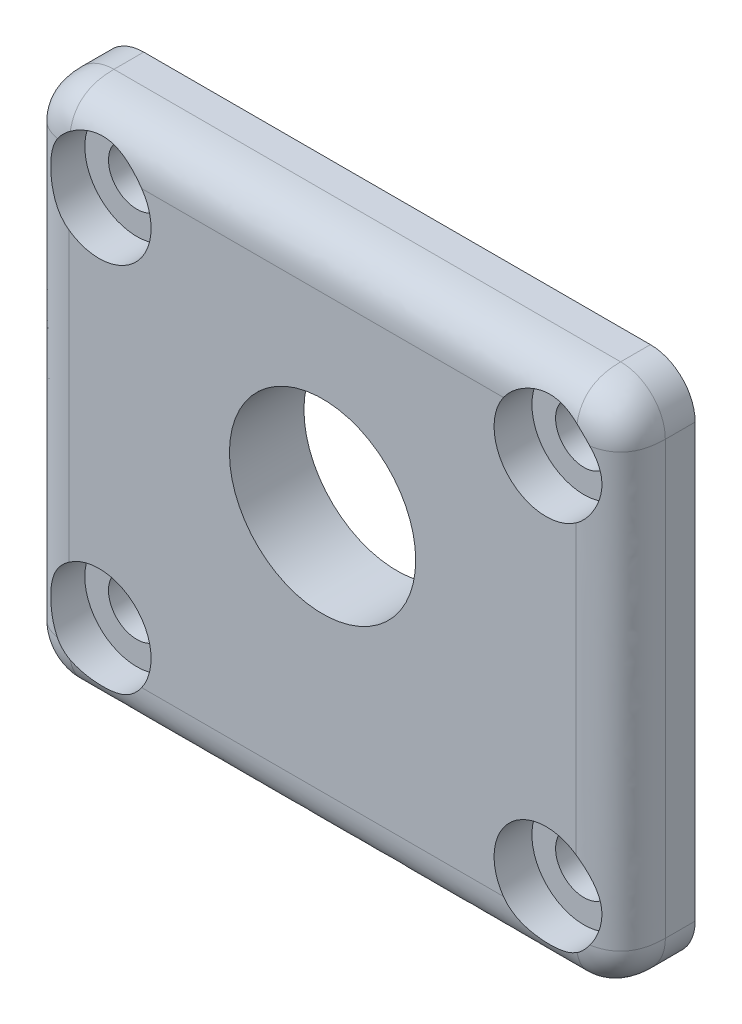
ISO-10303-21;
HEADER;
FILE_DESCRIPTION(('STEP AP214'),'2;1');
FILE_NAME('part.step','',(''),(''),'','','');
FILE_SCHEMA(('AUTOMOTIVE_DESIGN { 1 0 10303 214 1 1 1 1 }'));
ENDSEC;
DATA;
#1=APPLICATION_CONTEXT('core data for automotive mechanical design processes');
#2=APPLICATION_PROTOCOL_DEFINITION('international standard','automotive_design',2000,#1);
#3=PRODUCT_CONTEXT('',#1,'mechanical');
#4=PRODUCT('Part','Part','',(#3));
#5=PRODUCT_RELATED_PRODUCT_CATEGORY('part','',(#4));
#6=PRODUCT_DEFINITION_FORMATION('','',#4);
#7=PRODUCT_DEFINITION_CONTEXT('part definition',#1,'design');
#8=PRODUCT_DEFINITION('design','',#6,#7);
#9=PRODUCT_DEFINITION_SHAPE('','',#8);
#10=(LENGTH_UNIT() NAMED_UNIT(*) SI_UNIT(.MILLI.,.METRE.));
#11=(NAMED_UNIT(*) PLANE_ANGLE_UNIT() SI_UNIT($,.RADIAN.));
#12=(NAMED_UNIT(*) SI_UNIT($,.STERADIAN.) SOLID_ANGLE_UNIT());
#13=UNCERTAINTY_MEASURE_WITH_UNIT(LENGTH_MEASURE(1.E-05),#10,'distance_accuracy_value','');
#14=(GEOMETRIC_REPRESENTATION_CONTEXT(3) GLOBAL_UNCERTAINTY_ASSIGNED_CONTEXT((#13)) GLOBAL_UNIT_ASSIGNED_CONTEXT((#10,
#11,#12)) REPRESENTATION_CONTEXT('',''));
#15=CARTESIAN_POINT('',(0.,0.,0.));
#16=DIRECTION('',(0.,0.,1.));
#17=DIRECTION('',(1.,0.,0.));
#18=AXIS2_PLACEMENT_3D('',#15,#16,#17);
#19=CARTESIAN_POINT('',(0.,0.,0.));
#20=DIRECTION('',(0.,0.,1.));
#21=DIRECTION('',(1.,0.,0.));
#22=AXIS2_PLACEMENT_3D('',#19,#20,#21);
#23=PLANE('',#22);
#24=CARTESIAN_POINT('',(0.,2.1,0.));
#25=DIRECTION('',(0.,0.,1.));
#26=DIRECTION('',(1.,0.,0.));
#27=AXIS2_PLACEMENT_3D('',#24,#25,#26);
#28=CIRCLE('',#27,6.25);
#29=CARTESIAN_POINT('',(6.25,2.1,0.));
#30=VERTEX_POINT('',#29);
#31=EDGE_CURVE('E1490',#30,#30,#28,.F.);
#32=ORIENTED_EDGE('',*,*,#31,.F.);
#33=EDGE_LOOP('',(#32));
#34=FACE_BOUND('',#33,.T.);
#35=DIRECTION('',(-1.,0.,0.));
#36=VECTOR('',#35,1.);
#37=CARTESIAN_POINT('',(13.25,-8.,0.));
#38=LINE('',#37,#36);
#39=CARTESIAN_POINT('',(13.25,-8.,0.));
#40=VERTEX_POINT('',#39);
#41=CARTESIAN_POINT('',(-13.25,-7.99999999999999,0.));
#42=VERTEX_POINT('',#41);
#43=EDGE_CURVE('E273',#40,#42,#38,.T.);
#44=ORIENTED_EDGE('',*,*,#43,.T.);
#45=DIRECTION('',(0.,1.,0.));
#46=VECTOR('',#45,1.);
#47=CARTESIAN_POINT('',(-13.25,-7.99999999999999,0.));
#48=LINE('',#47,#46);
#49=CARTESIAN_POINT('',(-13.25,-7.15877081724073,0.));
#50=VERTEX_POINT('',#49);
#51=EDGE_CURVE('E60',#42,#50,#48,.T.);
#52=ORIENTED_EDGE('',*,*,#51,.T.);
#53=CARTESIAN_POINT('',(-14.5,-12.,0.));
#54=DIRECTION('',(0.,0.,1.));
#55=DIRECTION('',(-1.,0.,0.));
#56=AXIS2_PLACEMENT_3D('',#53,#54,#55);
#57=CIRCLE('',#56,5.);
#58=CARTESIAN_POINT('',(-13.5,-7.10102051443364,0.));
#59=VERTEX_POINT('',#58);
#60=EDGE_CURVE('E1510',#50,#59,#57,.T.);
#61=ORIENTED_EDGE('',*,*,#60,.T.);
#62=DIRECTION('',(0.,1.,0.));
#63=VECTOR('',#62,1.);
#64=CARTESIAN_POINT('',(-13.5,7.10102051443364,0.));
#65=LINE('',#64,#63);
#66=CARTESIAN_POINT('',(-13.5,7.10102051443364,0.));
#67=VERTEX_POINT('',#66);
#68=EDGE_CURVE('E1512',#59,#67,#65,.T.);
#69=ORIENTED_EDGE('',*,*,#68,.T.);
#70=CARTESIAN_POINT('',(-14.5,12.,0.));
#71=DIRECTION('',(0.,0.,1.));
#72=DIRECTION('',(1.,0.,0.));
#73=AXIS2_PLACEMENT_3D('',#70,#71,#72);
#74=CIRCLE('',#73,5.);
#75=CARTESIAN_POINT('',(-9.60102051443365,11.,0.));
#76=VERTEX_POINT('',#75);
#77=EDGE_CURVE('E1515',#67,#76,#74,.T.);
#78=ORIENTED_EDGE('',*,*,#77,.T.);
#79=DIRECTION('',(1.,0.,0.));
#80=VECTOR('',#79,1.);
#81=CARTESIAN_POINT('',(9.60102051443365,11.,0.));
#82=LINE('',#81,#80);
#83=CARTESIAN_POINT('',(9.60102051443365,11.,0.));
#84=VERTEX_POINT('',#83);
#85=EDGE_CURVE('E1518',#76,#84,#82,.T.);
#86=ORIENTED_EDGE('',*,*,#85,.T.);
#87=CARTESIAN_POINT('',(14.5,12.,0.));
#88=DIRECTION('',(0.,0.,1.));
#89=DIRECTION('',(-1.,0.,0.));
#90=AXIS2_PLACEMENT_3D('',#87,#88,#89);
#91=CIRCLE('',#90,5.);
#92=CARTESIAN_POINT('',(13.5,7.10102051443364,0.));
#93=VERTEX_POINT('',#92);
#94=EDGE_CURVE('E295',#84,#93,#91,.T.);
#95=ORIENTED_EDGE('',*,*,#94,.T.);
#96=DIRECTION('',(0.,-1.,0.));
#97=VECTOR('',#96,1.);
#98=CARTESIAN_POINT('',(13.5,7.10102051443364,0.));
#99=LINE('',#98,#97);
#100=CARTESIAN_POINT('',(13.5,-7.10102051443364,0.));
#101=VERTEX_POINT('',#100);
#102=EDGE_CURVE('E290',#93,#101,#99,.T.);
#103=ORIENTED_EDGE('',*,*,#102,.T.);
#104=CARTESIAN_POINT('',(14.5,-12.,0.));
#105=DIRECTION('',(0.,0.,1.));
#106=DIRECTION('',(1.,0.,0.));
#107=AXIS2_PLACEMENT_3D('',#104,#105,#106);
#108=CIRCLE('',#107,5.);
#109=CARTESIAN_POINT('',(13.25,-7.15877081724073,0.));
#110=VERTEX_POINT('',#109);
#111=EDGE_CURVE('E281',#101,#110,#108,.T.);
#112=ORIENTED_EDGE('',*,*,#111,.T.);
#113=DIRECTION('',(0.,-1.,0.));
#114=VECTOR('',#113,1.);
#115=CARTESIAN_POINT('',(13.25,-8.,0.));
#116=LINE('',#115,#114);
#117=EDGE_CURVE('E264',#110,#40,#116,.T.);
#118=ORIENTED_EDGE('',*,*,#117,.T.);
#119=EDGE_LOOP('',(#44,#52,#61,#69,#78,#86,#95,#103,#112,#118));
#120=FACE_BOUND('',#119,.T.);
#121=ADVANCED_FACE('F39',(#34,#120),#23,.F.);
#122=CARTESIAN_POINT('',(14.5,12.,-2.5));
#123=DIRECTION('',(0.,0.,-1.));
#124=DIRECTION('',(-1.,0.,0.));
#125=AXIS2_PLACEMENT_3D('',#122,#123,#124);
#126=PLANE('',#125);
#127=DIRECTION('',(-1.,0.,0.));
#128=VECTOR('',#127,1.);
#129=CARTESIAN_POINT('',(13.25,-8.,-2.5));
#130=LINE('',#129,#128);
#131=CARTESIAN_POINT('',(13.25,-8.,-2.5));
#132=VERTEX_POINT('',#131);
#133=CARTESIAN_POINT('',(-13.25,-7.99999999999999,-2.5));
#134=VERTEX_POINT('',#133);
#135=EDGE_CURVE('E285',#132,#134,#130,.T.);
#136=ORIENTED_EDGE('',*,*,#135,.F.);
#137=DIRECTION('',(0.,-1.,0.));
#138=VECTOR('',#137,1.);
#139=CARTESIAN_POINT('',(13.25,-8.,-2.5));
#140=LINE('',#139,#138);
#141=CARTESIAN_POINT('',(13.25,-7.15877081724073,-2.5));
#142=VERTEX_POINT('',#141);
#143=EDGE_CURVE('E274',#142,#132,#140,.T.);
#144=ORIENTED_EDGE('',*,*,#143,.F.);
#145=CARTESIAN_POINT('',(14.5,-12.,-2.5));
#146=DIRECTION('',(0.,0.,1.));
#147=DIRECTION('',(1.,0.,0.));
#148=AXIS2_PLACEMENT_3D('',#145,#146,#147);
#149=CIRCLE('',#148,5.);
#150=CARTESIAN_POINT('',(13.5,-7.10102051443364,-2.5));
#151=VERTEX_POINT('',#150);
#152=EDGE_CURVE('E284',#151,#142,#149,.T.);
#153=ORIENTED_EDGE('',*,*,#152,.F.);
#154=DIRECTION('',(0.,-1.,0.));
#155=VECTOR('',#154,1.);
#156=CARTESIAN_POINT('',(13.5,7.10102051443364,-2.5));
#157=LINE('',#156,#155);
#158=CARTESIAN_POINT('',(13.5,7.10102051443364,-2.5));
#159=VERTEX_POINT('',#158);
#160=EDGE_CURVE('E1507',#159,#151,#157,.T.);
#161=ORIENTED_EDGE('',*,*,#160,.F.);
#162=CARTESIAN_POINT('',(14.5,12.,-2.5));
#163=DIRECTION('',(0.,0.,1.));
#164=DIRECTION('',(-1.,0.,0.));
#165=AXIS2_PLACEMENT_3D('',#162,#163,#164);
#166=CIRCLE('',#165,5.);
#167=CARTESIAN_POINT('',(9.60102051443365,11.,-2.5));
#168=VERTEX_POINT('',#167);
#169=EDGE_CURVE('E1505',#168,#159,#166,.T.);
#170=ORIENTED_EDGE('',*,*,#169,.F.);
#171=DIRECTION('',(1.,0.,0.));
#172=VECTOR('',#171,1.);
#173=CARTESIAN_POINT('',(9.60102051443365,11.,-2.5));
#174=LINE('',#173,#172);
#175=CARTESIAN_POINT('',(-9.60102051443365,11.,-2.5));
#176=VERTEX_POINT('',#175);
#177=EDGE_CURVE('E1503',#176,#168,#174,.T.);
#178=ORIENTED_EDGE('',*,*,#177,.F.);
#179=CARTESIAN_POINT('',(-14.5,12.,-2.5));
#180=DIRECTION('',(0.,0.,1.));
#181=DIRECTION('',(1.,0.,0.));
#182=AXIS2_PLACEMENT_3D('',#179,#180,#181);
#183=CIRCLE('',#182,5.);
#184=CARTESIAN_POINT('',(-13.5,7.10102051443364,-2.5));
#185=VERTEX_POINT('',#184);
#186=EDGE_CURVE('E1501',#185,#176,#183,.T.);
#187=ORIENTED_EDGE('',*,*,#186,.F.);
#188=DIRECTION('',(0.,1.,0.));
#189=VECTOR('',#188,1.);
#190=CARTESIAN_POINT('',(-13.5,7.10102051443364,-2.5));
#191=LINE('',#190,#189);
#192=CARTESIAN_POINT('',(-13.5,-7.10102051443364,-2.5));
#193=VERTEX_POINT('',#192);
#194=EDGE_CURVE('E293',#193,#185,#191,.T.);
#195=ORIENTED_EDGE('',*,*,#194,.F.);
#196=CARTESIAN_POINT('',(-14.5,-12.,-2.5));
#197=DIRECTION('',(0.,0.,1.));
#198=DIRECTION('',(-1.,0.,0.));
#199=AXIS2_PLACEMENT_3D('',#196,#197,#198);
#200=CIRCLE('',#199,5.);
#201=CARTESIAN_POINT('',(-13.25,-7.15877081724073,-2.5));
#202=VERTEX_POINT('',#201);
#203=EDGE_CURVE('E291',#202,#193,#200,.T.);
#204=ORIENTED_EDGE('',*,*,#203,.F.);
#205=DIRECTION('',(0.,1.,0.));
#206=VECTOR('',#205,1.);
#207=CARTESIAN_POINT('',(-13.25,-7.99999999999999,-2.5));
#208=LINE('',#207,#206);
#209=EDGE_CURVE('E1488',#134,#202,#208,.T.);
#210=ORIENTED_EDGE('',*,*,#209,.F.);
#211=EDGE_LOOP('',(#136,#144,#153,#161,#170,#178,#187,#195,#204,#210));
#212=FACE_BOUND('',#211,.T.);
#213=DIRECTION('',(0.,-1.,0.));
#214=VECTOR('',#213,1.);
#215=CARTESIAN_POINT('',(14.5,8.,-2.5));
#216=LINE('',#215,#214);
#217=CARTESIAN_POINT('',(14.5,8.,-2.5));
#218=VERTEX_POINT('',#217);
#219=CARTESIAN_POINT('',(14.5,-8.,-2.5));
#220=VERTEX_POINT('',#219);
#221=EDGE_CURVE('E316',#218,#220,#216,.T.);
#222=ORIENTED_EDGE('',*,*,#221,.T.);
#223=CARTESIAN_POINT('',(14.5,-12.,-2.5));
#224=DIRECTION('',(0.,0.,1.));
#225=DIRECTION('',(1.,0.,0.));
#226=AXIS2_PLACEMENT_3D('',#223,#224,#225);
#227=CIRCLE('',#226,3.99999999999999);
#228=CARTESIAN_POINT('',(10.5,-12.,-2.5));
#229=VERTEX_POINT('',#228);
#230=EDGE_CURVE('E319',#220,#229,#227,.T.);
#231=ORIENTED_EDGE('',*,*,#230,.T.);
#232=DIRECTION('',(-1.,0.,0.));
#233=VECTOR('',#232,1.);
#234=CARTESIAN_POINT('',(10.5,-12.,-2.5));
#235=LINE('',#234,#233);
#236=CARTESIAN_POINT('',(-10.5,-12.,-2.5));
#237=VERTEX_POINT('',#236);
#238=EDGE_CURVE('E321',#229,#237,#235,.T.);
#239=ORIENTED_EDGE('',*,*,#238,.T.);
#240=CARTESIAN_POINT('',(-14.5,-12.,-2.5));
#241=DIRECTION('',(0.,0.,1.));
#242=DIRECTION('',(-1.,0.,0.));
#243=AXIS2_PLACEMENT_3D('',#240,#241,#242);
#244=CIRCLE('',#243,3.99999999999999);
#245=CARTESIAN_POINT('',(-14.5,-8.,-2.5));
#246=VERTEX_POINT('',#245);
#247=EDGE_CURVE('E323',#237,#246,#244,.T.);
#248=ORIENTED_EDGE('',*,*,#247,.T.);
#249=DIRECTION('',(0.,1.,0.));
#250=VECTOR('',#249,1.);
#251=CARTESIAN_POINT('',(-14.5,8.,-2.5));
#252=LINE('',#251,#250);
#253=CARTESIAN_POINT('',(-14.5,8.,-2.5));
#254=VERTEX_POINT('',#253);
#255=EDGE_CURVE('E325',#246,#254,#252,.T.);
#256=ORIENTED_EDGE('',*,*,#255,.T.);
#257=CARTESIAN_POINT('',(-14.5,12.,-2.5));
#258=DIRECTION('',(0.,0.,1.));
#259=DIRECTION('',(1.,0.,0.));
#260=AXIS2_PLACEMENT_3D('',#257,#258,#259);
#261=CIRCLE('',#260,3.99999999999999);
#262=CARTESIAN_POINT('',(-10.5,12.,-2.5));
#263=VERTEX_POINT('',#262);
#264=EDGE_CURVE('E327',#254,#263,#261,.T.);
#265=ORIENTED_EDGE('',*,*,#264,.T.);
#266=DIRECTION('',(1.,0.,0.));
#267=VECTOR('',#266,1.);
#268=CARTESIAN_POINT('',(10.5,12.,-2.5));
#269=LINE('',#268,#267);
#270=CARTESIAN_POINT('',(10.5,12.,-2.5));
#271=VERTEX_POINT('',#270);
#272=EDGE_CURVE('E329',#263,#271,#269,.T.);
#273=ORIENTED_EDGE('',*,*,#272,.T.);
#274=CARTESIAN_POINT('',(14.5,12.,-2.5));
#275=DIRECTION('',(0.,0.,1.));
#276=DIRECTION('',(-1.,0.,0.));
#277=AXIS2_PLACEMENT_3D('',#274,#275,#276);
#278=CIRCLE('',#277,3.99999999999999);
#279=EDGE_CURVE('E313',#271,#218,#278,.T.);
#280=ORIENTED_EDGE('',*,*,#279,.T.);
#281=EDGE_LOOP('',(#222,#231,#239,#248,#256,#265,#273,#280));
#282=FACE_BOUND('',#281,.T.);
#283=ADVANCED_FACE('F908',(#212,#282),#126,.T.);
#284=CARTESIAN_POINT('',(-14.5,-12.,-2.5));
#285=DIRECTION('',(0.,0.,1.));
#286=DIRECTION('',(1.,0.,0.));
#287=AXIS2_PLACEMENT_3D('',#284,#285,#286);
#288=CYLINDRICAL_SURFACE('',#287,5.);
#289=ORIENTED_EDGE('',*,*,#60,.F.);
#290=DIRECTION('',(0.,0.,1.));
#291=VECTOR('',#290,1.);
#292=CARTESIAN_POINT('',(-13.25,-7.15877081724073,-2.5));
#293=LINE('',#292,#291);
#294=EDGE_CURVE('E286',#202,#50,#293,.T.);
#295=ORIENTED_EDGE('',*,*,#294,.F.);
#296=ORIENTED_EDGE('',*,*,#203,.T.);
#297=DIRECTION('',(0.,0.,1.));
#298=VECTOR('',#297,1.);
#299=CARTESIAN_POINT('',(-13.5,-7.10102051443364,-2.5));
#300=LINE('',#299,#298);
#301=EDGE_CURVE('E309',#193,#59,#300,.T.);
#302=ORIENTED_EDGE('',*,*,#301,.T.);
#303=EDGE_LOOP('',(#289,#295,#296,#302));
#304=FACE_BOUND('',#303,.T.);
#305=ADVANCED_FACE('F915',(#304),#288,.T.);
#306=CARTESIAN_POINT('',(14.5,-12.,-2.5));
#307=DIRECTION('',(0.,0.,1.));
#308=DIRECTION('',(1.,0.,0.));
#309=AXIS2_PLACEMENT_3D('',#306,#307,#308);
#310=CYLINDRICAL_SURFACE('',#309,5.);
#311=ORIENTED_EDGE('',*,*,#152,.T.);
#312=DIRECTION('',(0.,0.,1.));
#313=VECTOR('',#312,1.);
#314=CARTESIAN_POINT('',(13.25,-7.15877081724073,-2.5));
#315=LINE('',#314,#313);
#316=EDGE_CURVE('E267',#110,#142,#315,.F.);
#317=ORIENTED_EDGE('',*,*,#316,.F.);
#318=ORIENTED_EDGE('',*,*,#111,.F.);
#319=DIRECTION('',(0.,0.,1.));
#320=VECTOR('',#319,1.);
#321=CARTESIAN_POINT('',(13.5,-7.10102051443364,-2.5));
#322=LINE('',#321,#320);
#323=EDGE_CURVE('E299',#151,#101,#322,.T.);
#324=ORIENTED_EDGE('',*,*,#323,.F.);
#325=EDGE_LOOP('',(#311,#317,#318,#324));
#326=FACE_BOUND('',#325,.T.);
#327=ADVANCED_FACE('F279',(#326),#310,.T.);
#328=CARTESIAN_POINT('',(-15.,-12.5,0.));
#329=DIRECTION('',(0.,0.,1.));
#330=DIRECTION('',(-1.,0.,0.));
#331=AXIS2_PLACEMENT_3D('',#328,#329,#330);
#332=CIRCLE('',#331,1.905);
#333=CARTESIAN_POINT('',(-16.905,-12.5,0.));
#334=VERTEX_POINT('',#333);
#335=EDGE_CURVE('E399',#334,#334,#332,.T.);
#336=ORIENTED_EDGE('',*,*,#335,.T.);
#337=EDGE_LOOP('',(#336));
#338=FACE_BOUND('',#337,.T.);
#339=CARTESIAN_POINT('',(15.,-12.5,0.));
#340=DIRECTION('',(0.,0.,1.));
#341=DIRECTION('',(1.,0.,0.));
#342=AXIS2_PLACEMENT_3D('',#339,#340,#341);
#343=CIRCLE('',#342,1.905);
#344=CARTESIAN_POINT('',(16.905,-12.5,0.));
#345=VERTEX_POINT('',#344);
#346=EDGE_CURVE('E396',#345,#345,#343,.T.);
#347=ORIENTED_EDGE('',*,*,#346,.T.);
#348=EDGE_LOOP('',(#347));
#349=FACE_BOUND('',#348,.T.);
#350=CARTESIAN_POINT('',(15.,12.5,0.));
#351=DIRECTION('',(0.,0.,1.));
#352=DIRECTION('',(-1.,0.,0.));
#353=AXIS2_PLACEMENT_3D('',#350,#351,#352);
#354=CIRCLE('',#353,1.905);
#355=CARTESIAN_POINT('',(13.095,12.5,0.));
#356=VERTEX_POINT('',#355);
#357=EDGE_CURVE('E392',#356,#356,#354,.T.);
#358=ORIENTED_EDGE('',*,*,#357,.T.);
#359=EDGE_LOOP('',(#358));
#360=FACE_BOUND('',#359,.T.);
#361=CARTESIAN_POINT('',(-15.,12.5,0.));
#362=DIRECTION('',(0.,0.,1.));
#363=DIRECTION('',(1.,0.,0.));
#364=AXIS2_PLACEMENT_3D('',#361,#362,#363);
#365=CIRCLE('',#364,1.905);
#366=CARTESIAN_POINT('',(-13.095,12.5,0.));
#367=VERTEX_POINT('',#366);
#368=EDGE_CURVE('E395',#367,#367,#365,.T.);
#369=ORIENTED_EDGE('',*,*,#368,.T.);
#370=EDGE_LOOP('',(#369));
#371=FACE_BOUND('',#370,.T.);
#372=DIRECTION('',(-1.,0.,0.));
#373=VECTOR('',#372,1.);
#374=CARTESIAN_POINT('',(-20.,17.5,0.));
#375=LINE('',#374,#373);
#376=CARTESIAN_POINT('',(17.,17.5,0.));
#377=VERTEX_POINT('',#376);
#378=CARTESIAN_POINT('',(-17.,17.5,0.));
#379=VERTEX_POINT('',#378);
#380=EDGE_CURVE('E408',#377,#379,#375,.T.);
#381=ORIENTED_EDGE('',*,*,#380,.F.);
#382=CARTESIAN_POINT('',(17.,14.5,0.));
#383=DIRECTION('',(0.,0.,1.));
#384=DIRECTION('',(1.,0.,0.));
#385=AXIS2_PLACEMENT_3D('',#382,#383,#384);
#386=CIRCLE('',#385,3.);
#387=CARTESIAN_POINT('',(20.,14.5,0.));
#388=VERTEX_POINT('',#387);
#389=EDGE_CURVE('E1028',#377,#388,#386,.F.);
#390=ORIENTED_EDGE('',*,*,#389,.T.);
#391=DIRECTION('',(0.,1.,0.));
#392=VECTOR('',#391,1.);
#393=CARTESIAN_POINT('',(20.,17.5,0.));
#394=LINE('',#393,#392);
#395=CARTESIAN_POINT('',(20.,-14.5,0.));
#396=VERTEX_POINT('',#395);
#397=EDGE_CURVE('E405',#396,#388,#394,.T.);
#398=ORIENTED_EDGE('',*,*,#397,.F.);
#399=CARTESIAN_POINT('',(17.,-14.5,0.));
#400=DIRECTION('',(0.,0.,1.));
#401=DIRECTION('',(1.,0.,0.));
#402=AXIS2_PLACEMENT_3D('',#399,#400,#401);
#403=CIRCLE('',#402,3.);
#404=CARTESIAN_POINT('',(17.,-17.5,0.));
#405=VERTEX_POINT('',#404);
#406=EDGE_CURVE('E1030',#396,#405,#403,.F.);
#407=ORIENTED_EDGE('',*,*,#406,.T.);
#408=DIRECTION('',(1.,0.,0.));
#409=VECTOR('',#408,1.);
#410=CARTESIAN_POINT('',(-20.,-17.5,0.));
#411=LINE('',#410,#409);
#412=CARTESIAN_POINT('',(-17.,-17.5,0.));
#413=VERTEX_POINT('',#412);
#414=EDGE_CURVE('E414',#413,#405,#411,.T.);
#415=ORIENTED_EDGE('',*,*,#414,.F.);
#416=CARTESIAN_POINT('',(-17.,-14.5,0.));
#417=DIRECTION('',(0.,0.,1.));
#418=DIRECTION('',(1.,0.,0.));
#419=AXIS2_PLACEMENT_3D('',#416,#417,#418);
#420=CIRCLE('',#419,3.);
#421=CARTESIAN_POINT('',(-20.,-14.5,0.));
#422=VERTEX_POINT('',#421);
#423=EDGE_CURVE('E1032',#413,#422,#420,.F.);
#424=ORIENTED_EDGE('',*,*,#423,.T.);
#425=DIRECTION('',(0.,-1.,0.));
#426=VECTOR('',#425,1.);
#427=CARTESIAN_POINT('',(-20.,17.5,0.));
#428=LINE('',#427,#426);
#429=CARTESIAN_POINT('',(-20.,14.5,0.));
#430=VERTEX_POINT('',#429);
#431=EDGE_CURVE('E411',#430,#422,#428,.T.);
#432=ORIENTED_EDGE('',*,*,#431,.F.);
#433=CARTESIAN_POINT('',(-17.,14.5,0.));
#434=DIRECTION('',(0.,0.,1.));
#435=DIRECTION('',(1.,0.,0.));
#436=AXIS2_PLACEMENT_3D('',#433,#434,#435);
#437=CIRCLE('',#436,3.);
#438=EDGE_CURVE('E1033',#430,#379,#437,.F.);
#439=ORIENTED_EDGE('',*,*,#438,.T.);
#440=EDGE_LOOP('',(#381,#390,#398,#407,#415,#424,#432,#439));
#441=FACE_BOUND('',#440,.T.);
#442=CARTESIAN_POINT('',(14.5,12.,0.));
#443=DIRECTION('',(0.,0.,1.));
#444=DIRECTION('',(-1.,0.,0.));
#445=AXIS2_PLACEMENT_3D('',#442,#443,#444);
#446=CIRCLE('',#445,3.99999999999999);
#447=CARTESIAN_POINT('',(10.5,12.,0.));
#448=VERTEX_POINT('',#447);
#449=CARTESIAN_POINT('',(14.5,8.,0.));
#450=VERTEX_POINT('',#449);
#451=EDGE_CURVE('E312',#448,#450,#446,.T.);
#452=ORIENTED_EDGE('',*,*,#451,.F.);
#453=DIRECTION('',(1.,0.,0.));
#454=VECTOR('',#453,1.);
#455=CARTESIAN_POINT('',(10.5,12.,0.));
#456=LINE('',#455,#454);
#457=CARTESIAN_POINT('',(-10.5,12.,0.));
#458=VERTEX_POINT('',#457);
#459=EDGE_CURVE('E317',#458,#448,#456,.T.);
#460=ORIENTED_EDGE('',*,*,#459,.F.);
#461=CARTESIAN_POINT('',(-14.5,12.,0.));
#462=DIRECTION('',(0.,0.,1.));
#463=DIRECTION('',(1.,0.,0.));
#464=AXIS2_PLACEMENT_3D('',#461,#462,#463);
#465=CIRCLE('',#464,3.99999999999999);
#466=CARTESIAN_POINT('',(-14.5,8.,0.));
#467=VERTEX_POINT('',#466);
#468=EDGE_CURVE('E347',#467,#458,#465,.T.);
#469=ORIENTED_EDGE('',*,*,#468,.F.);
#470=DIRECTION('',(0.,1.,0.));
#471=VECTOR('',#470,1.);
#472=CARTESIAN_POINT('',(-14.5,8.,0.));
#473=LINE('',#472,#471);
#474=CARTESIAN_POINT('',(-14.5,-8.,0.));
#475=VERTEX_POINT('',#474);
#476=EDGE_CURVE('E344',#475,#467,#473,.T.);
#477=ORIENTED_EDGE('',*,*,#476,.F.);
#478=CARTESIAN_POINT('',(-14.5,-12.,0.));
#479=DIRECTION('',(0.,0.,1.));
#480=DIRECTION('',(-1.,0.,0.));
#481=AXIS2_PLACEMENT_3D('',#478,#479,#480);
#482=CIRCLE('',#481,3.99999999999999);
#483=CARTESIAN_POINT('',(-10.5,-12.,0.));
#484=VERTEX_POINT('',#483);
#485=EDGE_CURVE('E341',#484,#475,#482,.T.);
#486=ORIENTED_EDGE('',*,*,#485,.F.);
#487=DIRECTION('',(-1.,0.,0.));
#488=VECTOR('',#487,1.);
#489=CARTESIAN_POINT('',(10.5,-12.,0.));
#490=LINE('',#489,#488);
#491=CARTESIAN_POINT('',(10.5,-12.,0.));
#492=VERTEX_POINT('',#491);
#493=EDGE_CURVE('E338',#492,#484,#490,.T.);
#494=ORIENTED_EDGE('',*,*,#493,.F.);
#495=CARTESIAN_POINT('',(14.5,-12.,0.));
#496=DIRECTION('',(0.,0.,1.));
#497=DIRECTION('',(1.,0.,0.));
#498=AXIS2_PLACEMENT_3D('',#495,#496,#497);
#499=CIRCLE('',#498,3.99999999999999);
#500=CARTESIAN_POINT('',(14.5,-8.,0.));
#501=VERTEX_POINT('',#500);
#502=EDGE_CURVE('E335',#501,#492,#499,.T.);
#503=ORIENTED_EDGE('',*,*,#502,.F.);
#504=DIRECTION('',(0.,-1.,0.));
#505=VECTOR('',#504,1.);
#506=CARTESIAN_POINT('',(14.5,8.,0.));
#507=LINE('',#506,#505);
#508=EDGE_CURVE('E68',#450,#501,#507,.T.);
#509=ORIENTED_EDGE('',*,*,#508,.F.);
#510=EDGE_LOOP('',(#452,#460,#469,#477,#486,#494,#503,#509));
#511=FACE_BOUND('',#510,.T.);
#512=ADVANCED_FACE('F911',(#338,#349,#360,#371,#441,#511),#23,.F.);
#513=CARTESIAN_POINT('',(-15.,12.5,0.));
#514=DIRECTION('',(0.,0.,1.));
#515=DIRECTION('',(1.,0.,0.));
#516=AXIS2_PLACEMENT_3D('',#513,#514,#515);
#517=CYLINDRICAL_SURFACE('',#516,1.905);
#518=ORIENTED_EDGE('',*,*,#368,.F.);
#519=EDGE_LOOP('',(#518));
#520=FACE_BOUND('',#519,.T.);
#521=CARTESIAN_POINT('',(-15.,12.5,2.46));
#522=DIRECTION('',(0.,0.,1.));
#523=DIRECTION('',(1.,0.,0.));
#524=AXIS2_PLACEMENT_3D('',#521,#522,#523);
#525=CIRCLE('',#524,1.905);
#526=CARTESIAN_POINT('',(-13.095,12.5,2.46));
#527=VERTEX_POINT('',#526);
#528=EDGE_CURVE('E402',#527,#527,#525,.F.);
#529=ORIENTED_EDGE('',*,*,#528,.F.);
#530=EDGE_LOOP('',(#529));
#531=FACE_BOUND('',#530,.T.);
#532=ADVANCED_FACE('F921',(#520,#531),#517,.F.);
#533=CARTESIAN_POINT('',(15.,-12.5,0.));
#534=DIRECTION('',(0.,0.,1.));
#535=DIRECTION('',(1.,0.,0.));
#536=AXIS2_PLACEMENT_3D('',#533,#534,#535);
#537=CYLINDRICAL_SURFACE('',#536,1.905);
#538=ORIENTED_EDGE('',*,*,#346,.F.);
#539=EDGE_LOOP('',(#538));
#540=FACE_BOUND('',#539,.T.);
#541=CARTESIAN_POINT('',(15.,-12.5,2.46));
#542=DIRECTION('',(0.,0.,1.));
#543=DIRECTION('',(1.,0.,0.));
#544=AXIS2_PLACEMENT_3D('',#541,#542,#543);
#545=CIRCLE('',#544,1.905);
#546=CARTESIAN_POINT('',(16.905,-12.5,2.46));
#547=VERTEX_POINT('',#546);
#548=EDGE_CURVE('E1707',#547,#547,#545,.F.);
#549=ORIENTED_EDGE('',*,*,#548,.F.);
#550=EDGE_LOOP('',(#549));
#551=FACE_BOUND('',#550,.T.);
#552=ADVANCED_FACE('F455',(#540,#551),#537,.F.);
#553=CARTESIAN_POINT('',(20.,17.5,5.));
#554=DIRECTION('',(-1.,0.,0.));
#555=DIRECTION('',(0.,-1.,0.));
#556=AXIS2_PLACEMENT_3D('',#553,#554,#555);
#557=PLANE('',#556);
#558=DIRECTION('',(0.,0.,-1.));
#559=VECTOR('',#558,1.);
#560=CARTESIAN_POINT('',(20.,14.5,5.));
#561=LINE('',#560,#559);
#562=CARTESIAN_POINT('',(20.,14.5,1.99999999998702));
#563=VERTEX_POINT('',#562);
#564=EDGE_CURVE('E1017',#388,#563,#561,.F.);
#565=ORIENTED_EDGE('',*,*,#564,.T.);
#566=CARTESIAN_POINT('',(20.,-17.4,2.));
#567=CARTESIAN_POINT('',(20.,-16.4333333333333,2.));
#568=CARTESIAN_POINT('',(20.,-15.4666666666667,2.));
#569=CARTESIAN_POINT('',(20.,-4.83333333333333,2.));
#570=CARTESIAN_POINT('',(20.,4.83333333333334,2.));
#571=CARTESIAN_POINT('',(20.,14.5,2.));
#572=(BOUNDED_CURVE() B_SPLINE_CURVE(3,(#566,#567,#568,#569,#570,#571),.UNSPECIFIED.,.F.,
.F.) B_SPLINE_CURVE_WITH_KNOTS((4,2,4),(-0.0145,-0.0116,0.0174),
.UNSPECIFIED.) CURVE() GEOMETRIC_REPRESENTATION_ITEM() RATIONAL_B_SPLINE_CURVE((1.,1.,1.,1.,1.,1.)) REPRESENTATION_ITEM(''));
#573=CARTESIAN_POINT('',(20.,-14.5,2.));
#574=VERTEX_POINT('',#573);
#575=EDGE_CURVE('E1041',#563,#574,#572,.F.);
#576=ORIENTED_EDGE('',*,*,#575,.T.);
#577=DIRECTION('',(0.,0.,-1.));
#578=VECTOR('',#577,1.);
#579=CARTESIAN_POINT('',(20.,-14.5,5.));
#580=LINE('',#579,#578);
#581=EDGE_CURVE('E1023',#574,#396,#580,.T.);
#582=ORIENTED_EDGE('',*,*,#581,.T.);
#583=ORIENTED_EDGE('',*,*,#397,.T.);
#584=EDGE_LOOP('',(#565,#576,#582,#583));
#585=FACE_BOUND('',#584,.T.);
#586=ADVANCED_FACE('F449',(#585),#557,.F.);
#587=CARTESIAN_POINT('',(-20.,17.5,5.));
#588=DIRECTION('',(0.,-1.,0.));
#589=DIRECTION('',(0.,0.,-1.));
#590=AXIS2_PLACEMENT_3D('',#587,#588,#589);
#591=PLANE('',#590);
#592=DIRECTION('',(0.,0.,-1.));
#593=VECTOR('',#592,1.);
#594=CARTESIAN_POINT('',(-17.,17.5,5.));
#595=LINE('',#594,#593);
#596=CARTESIAN_POINT('',(-17.,17.5,1.99999999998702));
#597=VERTEX_POINT('',#596);
#598=EDGE_CURVE('E417',#379,#597,#595,.F.);
#599=ORIENTED_EDGE('',*,*,#598,.T.);
#600=CARTESIAN_POINT('',(20.4,17.5,2.));
#601=CARTESIAN_POINT('',(19.2666666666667,17.5,2.));
#602=CARTESIAN_POINT('',(18.1333333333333,17.5,2.));
#603=CARTESIAN_POINT('',(5.66666666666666,17.5,2.));
#604=CARTESIAN_POINT('',(-5.66666666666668,17.5,2.));
#605=CARTESIAN_POINT('',(-17.,17.5,2.));
#606=(BOUNDED_CURVE() B_SPLINE_CURVE(3,(#600,#601,#602,#603,#604,#605),.UNSPECIFIED.,.F.,
.F.) B_SPLINE_CURVE_WITH_KNOTS((4,2,4),(-0.017,-0.0136,0.0204),
.UNSPECIFIED.) CURVE() GEOMETRIC_REPRESENTATION_ITEM() RATIONAL_B_SPLINE_CURVE((1.,1.,1.,1.,1.,1.)) REPRESENTATION_ITEM(''));
#607=CARTESIAN_POINT('',(17.,17.5,2.));
#608=VERTEX_POINT('',#607);
#609=EDGE_CURVE('E431',#597,#608,#606,.F.);
#610=ORIENTED_EDGE('',*,*,#609,.T.);
#611=DIRECTION('',(0.,0.,-1.));
#612=VECTOR('',#611,1.);
#613=CARTESIAN_POINT('',(17.,17.5,5.));
#614=LINE('',#613,#612);
#615=EDGE_CURVE('E426',#608,#377,#614,.T.);
#616=ORIENTED_EDGE('',*,*,#615,.T.);
#617=ORIENTED_EDGE('',*,*,#380,.T.);
#618=EDGE_LOOP('',(#599,#610,#616,#617));
#619=FACE_BOUND('',#618,.T.);
#620=ADVANCED_FACE('F438',(#619),#591,.F.);
#621=CARTESIAN_POINT('',(-20.,17.5,5.));
#622=DIRECTION('',(1.,0.,0.));
#623=DIRECTION('',(0.,1.,0.));
#624=AXIS2_PLACEMENT_3D('',#621,#622,#623);
#625=PLANE('',#624);
#626=DIRECTION('',(0.,0.,-1.));
#627=VECTOR('',#626,1.);
#628=CARTESIAN_POINT('',(-20.,-14.5,5.));
#629=LINE('',#628,#627);
#630=CARTESIAN_POINT('',(-20.,-14.5,2.));
#631=VERTEX_POINT('',#630);
#632=EDGE_CURVE('E491',#422,#631,#629,.F.);
#633=ORIENTED_EDGE('',*,*,#632,.T.);
#634=CARTESIAN_POINT('',(-20.,17.4,2.));
#635=CARTESIAN_POINT('',(-20.,16.4333333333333,2.));
#636=CARTESIAN_POINT('',(-20.,15.4666666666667,2.));
#637=CARTESIAN_POINT('',(-20.,4.83333333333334,2.));
#638=CARTESIAN_POINT('',(-20.,-4.83333333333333,2.));
#639=CARTESIAN_POINT('',(-20.,-14.5,2.));
#640=(BOUNDED_CURVE() B_SPLINE_CURVE(3,(#634,#635,#636,#637,#638,#639),.UNSPECIFIED.,.F.,
.F.) B_SPLINE_CURVE_WITH_KNOTS((4,2,4),(-0.0145,-0.0116,0.0174),
.UNSPECIFIED.) CURVE() GEOMETRIC_REPRESENTATION_ITEM() RATIONAL_B_SPLINE_CURVE((1.,1.,1.,1.,1.,1.)) REPRESENTATION_ITEM(''));
#641=CARTESIAN_POINT('',(-20.,14.5,2.));
#642=VERTEX_POINT('',#641);
#643=EDGE_CURVE('E53',#631,#642,#640,.F.);
#644=ORIENTED_EDGE('',*,*,#643,.T.);
#645=DIRECTION('',(0.,0.,-1.));
#646=VECTOR('',#645,1.);
#647=CARTESIAN_POINT('',(-20.,14.5,5.));
#648=LINE('',#647,#646);
#649=EDGE_CURVE('E475',#642,#430,#648,.T.);
#650=ORIENTED_EDGE('',*,*,#649,.T.);
#651=ORIENTED_EDGE('',*,*,#431,.T.);
#652=EDGE_LOOP('',(#633,#644,#650,#651));
#653=FACE_BOUND('',#652,.T.);
#654=ADVANCED_FACE('F448',(#653),#625,.F.);
#655=CARTESIAN_POINT('',(-20.,-17.5,5.));
#656=DIRECTION('',(0.,1.,0.));
#657=DIRECTION('',(0.,0.,1.));
#658=AXIS2_PLACEMENT_3D('',#655,#656,#657);
#659=PLANE('',#658);
#660=DIRECTION('',(0.,0.,-1.));
#661=VECTOR('',#660,1.);
#662=CARTESIAN_POINT('',(17.,-17.5,5.));
#663=LINE('',#662,#661);
#664=CARTESIAN_POINT('',(17.,-17.5,2.));
#665=VERTEX_POINT('',#664);
#666=EDGE_CURVE('E466',#405,#665,#663,.F.);
#667=ORIENTED_EDGE('',*,*,#666,.T.);
#668=CARTESIAN_POINT('',(-20.4,-17.5,2.));
#669=CARTESIAN_POINT('',(-19.2666666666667,-17.5,2.));
#670=CARTESIAN_POINT('',(-18.1333333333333,-17.5,2.));
#671=CARTESIAN_POINT('',(-5.66666666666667,-17.5,2.));
#672=CARTESIAN_POINT('',(5.66666666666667,-17.5,2.));
#673=CARTESIAN_POINT('',(17.,-17.5,2.));
#674=(BOUNDED_CURVE() B_SPLINE_CURVE(3,(#668,#669,#670,#671,#672,#673),.UNSPECIFIED.,.F.,
.F.) B_SPLINE_CURVE_WITH_KNOTS((4,2,4),(-0.017,-0.0136,0.0204),
.UNSPECIFIED.) CURVE() GEOMETRIC_REPRESENTATION_ITEM() RATIONAL_B_SPLINE_CURVE((1.,1.,1.,1.,1.,1.)) REPRESENTATION_ITEM(''));
#675=CARTESIAN_POINT('',(-17.,-17.5,2.));
#676=VERTEX_POINT('',#675);
#677=EDGE_CURVE('E1048',#665,#676,#674,.F.);
#678=ORIENTED_EDGE('',*,*,#677,.T.);
#679=DIRECTION('',(0.,0.,-1.));
#680=VECTOR('',#679,1.);
#681=CARTESIAN_POINT('',(-17.,-17.5,5.));
#682=LINE('',#681,#680);
#683=EDGE_CURVE('E476',#676,#413,#682,.T.);
#684=ORIENTED_EDGE('',*,*,#683,.T.);
#685=ORIENTED_EDGE('',*,*,#414,.T.);
#686=EDGE_LOOP('',(#667,#678,#684,#685));
#687=FACE_BOUND('',#686,.T.);
#688=ADVANCED_FACE('F1045',(#687),#659,.F.);
#689=CARTESIAN_POINT('',(0.,0.,5.));
#690=DIRECTION('',(0.,0.,1.));
#691=DIRECTION('',(1.,0.,0.));
#692=AXIS2_PLACEMENT_3D('',#689,#690,#691);
#693=PLANE('',#692);
#694=CARTESIAN_POINT('',(0.,2.1,5.));
#695=DIRECTION('',(0.,0.,1.));
#696=DIRECTION('',(1.,0.,0.));
#697=AXIS2_PLACEMENT_3D('',#694,#695,#696);
#698=CIRCLE('',#697,6.25);
#699=CARTESIAN_POINT('',(6.25,2.1,5.));
#700=VERTEX_POINT('',#699);
#701=EDGE_CURVE('E1530',#700,#700,#698,.T.);
#702=ORIENTED_EDGE('',*,*,#701,.F.);
#703=EDGE_LOOP('',(#702));
#704=FACE_BOUND('',#703,.T.);
#705=CARTESIAN_POINT('',(15.,-12.5,5.));
#706=DIRECTION('',(0.,0.,1.));
#707=DIRECTION('',(1.,0.,0.));
#708=AXIS2_PLACEMENT_3D('',#705,#706,#707);
#709=CIRCLE('',#708,3.4925);
#710=CARTESIAN_POINT('',(16.9999999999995,-9.6368625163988,5.));
#711=VERTEX_POINT('',#710);
#712=CARTESIAN_POINT('',(12.1368625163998,-14.5000000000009,5.));
#713=VERTEX_POINT('',#712);
#714=EDGE_CURVE('E383',#711,#713,#709,.T.);
#715=ORIENTED_EDGE('',*,*,#714,.F.);
#716=CARTESIAN_POINT('',(17.,14.5,5.));
#717=CARTESIAN_POINT('',(17.,4.83333333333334,5.));
#718=CARTESIAN_POINT('',(17.,-4.83333333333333,5.));
#719=CARTESIAN_POINT('',(17.,-15.4666666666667,5.));
#720=CARTESIAN_POINT('',(17.,-16.4333333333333,5.));
#721=CARTESIAN_POINT('',(17.,-17.4,5.));
#722=(BOUNDED_CURVE() B_SPLINE_CURVE(3,(#716,#717,#718,#719,#720,#721),.UNSPECIFIED.,.F.,
.F.) B_SPLINE_CURVE_WITH_KNOTS((4,2,4),(-0.0145,0.0145,0.0174),
.UNSPECIFIED.) CURVE() GEOMETRIC_REPRESENTATION_ITEM() RATIONAL_B_SPLINE_CURVE((1.,1.,1.,1.,1.,1.)) REPRESENTATION_ITEM(''));
#723=CARTESIAN_POINT('',(17.0000000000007,9.63686251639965,5.));
#724=VERTEX_POINT('',#723);
#725=EDGE_CURVE('E1074',#711,#724,#722,.F.);
#726=ORIENTED_EDGE('',*,*,#725,.T.);
#727=CARTESIAN_POINT('',(15.,12.5,5.));
#728=DIRECTION('',(0.,0.,1.));
#729=DIRECTION('',(-1.,0.,0.));
#730=AXIS2_PLACEMENT_3D('',#727,#728,#729);
#731=CIRCLE('',#730,3.4925);
#732=CARTESIAN_POINT('',(12.1368625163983,14.4999999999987,5.));
#733=VERTEX_POINT('',#732);
#734=EDGE_CURVE('E379',#733,#724,#731,.T.);
#735=ORIENTED_EDGE('',*,*,#734,.F.);
#736=CARTESIAN_POINT('',(-17.,14.5,5.));
#737=CARTESIAN_POINT('',(-5.66666666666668,14.5,5.));
#738=CARTESIAN_POINT('',(5.66666666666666,14.5,5.));
#739=CARTESIAN_POINT('',(18.1333333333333,14.5,5.));
#740=CARTESIAN_POINT('',(19.2666666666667,14.5,5.));
#741=CARTESIAN_POINT('',(20.4,14.5,5.));
#742=(BOUNDED_CURVE() B_SPLINE_CURVE(3,(#736,#737,#738,#739,#740,#741),.UNSPECIFIED.,.F.,
.F.) B_SPLINE_CURVE_WITH_KNOTS((4,2,4),(-0.017,0.017,0.0204),
.UNSPECIFIED.) CURVE() GEOMETRIC_REPRESENTATION_ITEM() RATIONAL_B_SPLINE_CURVE((1.,1.,1.,1.,1.,1.)) REPRESENTATION_ITEM(''));
#743=CARTESIAN_POINT('',(-12.1368625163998,14.5000000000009,5.));
#744=VERTEX_POINT('',#743);
#745=EDGE_CURVE('E822',#733,#744,#742,.F.);
#746=ORIENTED_EDGE('',*,*,#745,.T.);
#747=CARTESIAN_POINT('',(-15.,12.5,5.));
#748=DIRECTION('',(0.,0.,1.));
#749=DIRECTION('',(1.,0.,0.));
#750=AXIS2_PLACEMENT_3D('',#747,#748,#749);
#751=CIRCLE('',#750,3.4925);
#752=CARTESIAN_POINT('',(-16.9999999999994,9.63686251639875,5.));
#753=VERTEX_POINT('',#752);
#754=EDGE_CURVE('E378',#753,#744,#751,.T.);
#755=ORIENTED_EDGE('',*,*,#754,.F.);
#756=CARTESIAN_POINT('',(-17.,-14.5,5.));
#757=CARTESIAN_POINT('',(-17.,-4.83333333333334,5.));
#758=CARTESIAN_POINT('',(-17.,4.83333333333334,5.));
#759=CARTESIAN_POINT('',(-17.,15.4666666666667,5.));
#760=CARTESIAN_POINT('',(-17.,16.4333333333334,5.));
#761=CARTESIAN_POINT('',(-17.,17.4,5.));
#762=(BOUNDED_CURVE() B_SPLINE_CURVE(3,(#756,#757,#758,#759,#760,#761),.UNSPECIFIED.,.F.,
.F.) B_SPLINE_CURVE_WITH_KNOTS((4,2,4),(-0.0145,0.0145,0.0174),
.UNSPECIFIED.) CURVE() GEOMETRIC_REPRESENTATION_ITEM() RATIONAL_B_SPLINE_CURVE((1.,1.,1.,1.,1.,1.)) REPRESENTATION_ITEM(''));
#763=CARTESIAN_POINT('',(-17.0000000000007,-9.63686251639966,5.));
#764=VERTEX_POINT('',#763);
#765=EDGE_CURVE('E843',#753,#764,#762,.F.);
#766=ORIENTED_EDGE('',*,*,#765,.T.);
#767=CARTESIAN_POINT('',(-15.,-12.5,5.));
#768=DIRECTION('',(0.,0.,1.));
#769=DIRECTION('',(-1.,0.,0.));
#770=AXIS2_PLACEMENT_3D('',#767,#768,#769);
#771=CIRCLE('',#770,3.4925);
#772=CARTESIAN_POINT('',(-12.1368625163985,-14.4999999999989,5.));
#773=VERTEX_POINT('',#772);
#774=EDGE_CURVE('E387',#773,#764,#771,.T.);
#775=ORIENTED_EDGE('',*,*,#774,.F.);
#776=CARTESIAN_POINT('',(17.,-14.5,5.));
#777=CARTESIAN_POINT('',(5.66666666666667,-14.5,5.));
#778=CARTESIAN_POINT('',(-5.66666666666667,-14.5,5.));
#779=CARTESIAN_POINT('',(-18.1333333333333,-14.5,5.));
#780=CARTESIAN_POINT('',(-19.2666666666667,-14.5,5.));
#781=CARTESIAN_POINT('',(-20.4,-14.5,5.));
#782=(BOUNDED_CURVE() B_SPLINE_CURVE(3,(#776,#777,#778,#779,#780,#781),.UNSPECIFIED.,.F.,
.F.) B_SPLINE_CURVE_WITH_KNOTS((4,2,4),(-0.017,0.017,0.0204),
.UNSPECIFIED.) CURVE() GEOMETRIC_REPRESENTATION_ITEM() RATIONAL_B_SPLINE_CURVE((1.,1.,1.,1.,1.,1.)) REPRESENTATION_ITEM(''));
#783=EDGE_CURVE('E1069',#773,#713,#782,.F.);
#784=ORIENTED_EDGE('',*,*,#783,.T.);
#785=EDGE_LOOP('',(#715,#726,#735,#746,#755,#766,#775,#784));
#786=FACE_BOUND('',#785,.T.);
#787=ADVANCED_FACE('F1068',(#704,#786),#693,.T.);
#788=CARTESIAN_POINT('',(15.,12.5,0.));
#789=DIRECTION('',(0.,0.,1.));
#790=DIRECTION('',(1.,0.,0.));
#791=AXIS2_PLACEMENT_3D('',#788,#789,#790);
#792=CYLINDRICAL_SURFACE('',#791,1.905);
#793=CARTESIAN_POINT('',(15.,12.5,2.46));
#794=DIRECTION('',(0.,0.,-1.));
#795=DIRECTION('',(-1.,0.,0.));
#796=AXIS2_PLACEMENT_3D('',#793,#794,#795);
#797=CIRCLE('',#796,1.905);
#798=CARTESIAN_POINT('',(13.095,12.5,2.46));
#799=VERTEX_POINT('',#798);
#800=EDGE_CURVE('E1709',#799,#799,#797,.F.);
#801=ORIENTED_EDGE('',*,*,#800,.T.);
#802=EDGE_LOOP('',(#801));
#803=FACE_BOUND('',#802,.T.);
#804=ORIENTED_EDGE('',*,*,#357,.F.);
#805=EDGE_LOOP('',(#804));
#806=FACE_BOUND('',#805,.T.);
#807=ADVANCED_FACE('F876',(#803,#806),#792,.F.);
#808=CARTESIAN_POINT('',(-15.,-12.5,0.));
#809=DIRECTION('',(0.,0.,1.));
#810=DIRECTION('',(1.,0.,0.));
#811=AXIS2_PLACEMENT_3D('',#808,#809,#810);
#812=CYLINDRICAL_SURFACE('',#811,1.905);
#813=CARTESIAN_POINT('',(-15.,-12.5,2.46));
#814=DIRECTION('',(0.,0.,-1.));
#815=DIRECTION('',(-1.,0.,0.));
#816=AXIS2_PLACEMENT_3D('',#813,#814,#815);
#817=CIRCLE('',#816,1.905);
#818=CARTESIAN_POINT('',(-16.905,-12.5,2.46));
#819=VERTEX_POINT('',#818);
#820=EDGE_CURVE('E391',#819,#819,#817,.F.);
#821=ORIENTED_EDGE('',*,*,#820,.T.);
#822=EDGE_LOOP('',(#821));
#823=FACE_BOUND('',#822,.T.);
#824=ORIENTED_EDGE('',*,*,#335,.F.);
#825=EDGE_LOOP('',(#824));
#826=FACE_BOUND('',#825,.T.);
#827=ADVANCED_FACE('F905',(#823,#826),#812,.F.);
#828=CARTESIAN_POINT('',(17.,14.5,5.));
#829=DIRECTION('',(0.,0.,-1.));
#830=DIRECTION('',(-1.,0.,0.));
#831=AXIS2_PLACEMENT_3D('',#828,#829,#830);
#832=CYLINDRICAL_SURFACE('',#831,3.);
#833=ORIENTED_EDGE('',*,*,#615,.F.);
#834=CARTESIAN_POINT('',(20.,14.5,2.));
#835=CARTESIAN_POINT('',(20.,14.7778967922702,2.));
#836=CARTESIAN_POINT('',(19.9603485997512,15.0548794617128,2.));
#837=CARTESIAN_POINT('',(19.8154748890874,15.5698860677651,2.));
#838=CARTESIAN_POINT('',(19.7109928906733,15.8073571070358,2.));
#839=CARTESIAN_POINT('',(19.4661443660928,16.2253396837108,2.));
#840=CARTESIAN_POINT('',(19.3262254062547,16.4062262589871,2.));
#841=CARTESIAN_POINT('',(19.0347586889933,16.7146738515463,2.));
#842=CARTESIAN_POINT('',(18.8832007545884,16.8426105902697,2.));
#843=CARTESIAN_POINT('',(18.4297509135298,17.1632480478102,2.));
#844=CARTESIAN_POINT('',(18.1307936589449,17.2948305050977,2.));
#845=CARTESIAN_POINT('',(17.5557141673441,17.4632673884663,2.));
#846=CARTESIAN_POINT('',(17.2775129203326,17.5,2.00000000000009));
#847=CARTESIAN_POINT('',(17.,17.5,2.));
#848=(BOUNDED_CURVE() B_SPLINE_CURVE(3,(#834,#835,#836,#837,#838,#839,#840,#841,#842,#843,#844,
#845,#846,#847),.UNSPECIFIED.,.F.,.F.) B_SPLINE_CURVE_WITH_KNOTS((4,2,2,2,2,2,4),(0.,
0.196349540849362,0.392699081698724,0.589048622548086,0.785398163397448,1.17809724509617,
1.5707963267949),
.UNSPECIFIED.) CURVE() GEOMETRIC_REPRESENTATION_ITEM() RATIONAL_B_SPLINE_CURVE((1.,1.,1.,1.,1.,
1.,1.,1.,1.,1.,1.,1.,1.,1.)) REPRESENTATION_ITEM(''));
#849=EDGE_CURVE('E848',#608,#563,#848,.F.);
#850=ORIENTED_EDGE('',*,*,#849,.T.);
#851=ORIENTED_EDGE('',*,*,#564,.F.);
#852=ORIENTED_EDGE('',*,*,#389,.F.);
#853=EDGE_LOOP('',(#833,#850,#851,#852));
#854=FACE_BOUND('',#853,.T.);
#855=ADVANCED_FACE('F457',(#854),#832,.T.);
#856=CARTESIAN_POINT('',(17.,-14.5,5.));
#857=DIRECTION('',(0.,0.,-1.));
#858=DIRECTION('',(-1.,0.,0.));
#859=AXIS2_PLACEMENT_3D('',#856,#857,#858);
#860=CYLINDRICAL_SURFACE('',#859,3.);
#861=ORIENTED_EDGE('',*,*,#581,.F.);
#862=CARTESIAN_POINT('',(17.,-17.5,2.));
#863=CARTESIAN_POINT('',(17.2778967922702,-17.5,2.));
#864=CARTESIAN_POINT('',(17.5548794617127,-17.4603485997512,2.));
#865=CARTESIAN_POINT('',(18.0698860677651,-17.3154748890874,2.));
#866=CARTESIAN_POINT('',(18.3073571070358,-17.2109928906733,2.));
#867=CARTESIAN_POINT('',(18.7253396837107,-16.9661443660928,2.));
#868=CARTESIAN_POINT('',(18.9062262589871,-16.8262254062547,2.));
#869=CARTESIAN_POINT('',(19.2146738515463,-16.5347586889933,2.));
#870=CARTESIAN_POINT('',(19.3426105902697,-16.3832007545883,2.));
#871=CARTESIAN_POINT('',(19.6632480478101,-15.9297509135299,2.));
#872=CARTESIAN_POINT('',(19.7948305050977,-15.6307936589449,2.));
#873=CARTESIAN_POINT('',(19.9632673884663,-15.0557141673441,2.));
#874=CARTESIAN_POINT('',(20.,-14.7775129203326,2.));
#875=CARTESIAN_POINT('',(20.,-14.5,2.));
#876=(BOUNDED_CURVE() B_SPLINE_CURVE(3,(#862,#863,#864,#865,#866,#867,#868,#869,#870,#871,#872,
#873,#874,#875),.UNSPECIFIED.,.F.,.F.) B_SPLINE_CURVE_WITH_KNOTS((4,2,2,2,2,2,4),
(3.14159265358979,3.33794219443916,3.53429173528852,3.73064127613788,3.92699081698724,
4.31968989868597,4.71238898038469),
.UNSPECIFIED.) CURVE() GEOMETRIC_REPRESENTATION_ITEM() RATIONAL_B_SPLINE_CURVE((1.,1.,1.,1.,1.,
1.,1.,1.,1.,1.,1.,1.,1.,1.)) REPRESENTATION_ITEM(''));
#877=EDGE_CURVE('E1154',#574,#665,#876,.F.);
#878=ORIENTED_EDGE('',*,*,#877,.T.);
#879=ORIENTED_EDGE('',*,*,#666,.F.);
#880=ORIENTED_EDGE('',*,*,#406,.F.);
#881=EDGE_LOOP('',(#861,#878,#879,#880));
#882=FACE_BOUND('',#881,.T.);
#883=ADVANCED_FACE('F891',(#882),#860,.T.);
#884=CARTESIAN_POINT('',(-17.,-14.5,5.));
#885=DIRECTION('',(0.,0.,-1.));
#886=DIRECTION('',(-1.,0.,0.));
#887=AXIS2_PLACEMENT_3D('',#884,#885,#886);
#888=CYLINDRICAL_SURFACE('',#887,3.);
#889=ORIENTED_EDGE('',*,*,#683,.F.);
#890=CARTESIAN_POINT('',(-20.,-14.5,2.));
#891=CARTESIAN_POINT('',(-20.,-14.7778976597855,2.));
#892=CARTESIAN_POINT('',(-19.9603489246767,-15.0548783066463,2.00000000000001));
#893=CARTESIAN_POINT('',(-19.815474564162,-15.5698872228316,1.99999999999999));
#894=CARTESIAN_POINT('',(-19.7109928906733,-15.8073571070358,2.));
#895=CARTESIAN_POINT('',(-19.4661443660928,-16.2253396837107,2.));
#896=CARTESIAN_POINT('',(-19.3262254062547,-16.4062262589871,2.));
#897=CARTESIAN_POINT('',(-19.0347586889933,-16.7146738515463,2.));
#898=CARTESIAN_POINT('',(-18.8832007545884,-16.8426105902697,2.));
#899=CARTESIAN_POINT('',(-18.42975091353,-17.1632480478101,2.));
#900=CARTESIAN_POINT('',(-18.1307936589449,-17.2948305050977,2.));
#901=CARTESIAN_POINT('',(-17.5557141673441,-17.4632673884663,2.));
#902=CARTESIAN_POINT('',(-17.2775129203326,-17.5,2.));
#903=CARTESIAN_POINT('',(-17.,-17.5,2.));
#904=(BOUNDED_CURVE() B_SPLINE_CURVE(3,(#890,#891,#892,#893,#894,#895,#896,#897,#898,#899,#900,
#901,#902,#903),.UNSPECIFIED.,.F.,.F.) B_SPLINE_CURVE_WITH_KNOTS((4,2,2,2,2,2,4),
(3.14159265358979,3.33794219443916,3.53429173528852,3.73064127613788,3.92699081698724,
4.31968989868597,4.71238898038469),
.UNSPECIFIED.) CURVE() GEOMETRIC_REPRESENTATION_ITEM() RATIONAL_B_SPLINE_CURVE((1.,1.,1.,1.,1.,
1.,1.,1.,1.,1.,1.,1.,1.,1.)) REPRESENTATION_ITEM(''));
#905=EDGE_CURVE('E1058',#676,#631,#904,.F.);
#906=ORIENTED_EDGE('',*,*,#905,.T.);
#907=ORIENTED_EDGE('',*,*,#632,.F.);
#908=ORIENTED_EDGE('',*,*,#423,.F.);
#909=EDGE_LOOP('',(#889,#906,#907,#908));
#910=FACE_BOUND('',#909,.T.);
#911=ADVANCED_FACE('F528',(#910),#888,.T.);
#912=CARTESIAN_POINT('',(-17.,14.5,5.));
#913=DIRECTION('',(0.,0.,-1.));
#914=DIRECTION('',(-1.,0.,0.));
#915=AXIS2_PLACEMENT_3D('',#912,#913,#914);
#916=CYLINDRICAL_SURFACE('',#915,3.);
#917=ORIENTED_EDGE('',*,*,#649,.F.);
#918=CARTESIAN_POINT('',(-17.,17.5,2.));
#919=CARTESIAN_POINT('',(-17.2778967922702,17.5,1.99999999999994));
#920=CARTESIAN_POINT('',(-17.5548794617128,17.4603485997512,2.));
#921=CARTESIAN_POINT('',(-18.0698860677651,17.3154748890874,2.));
#922=CARTESIAN_POINT('',(-18.3073565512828,17.2109932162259,2.));
#923=CARTESIAN_POINT('',(-18.7253402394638,16.9661440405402,2.));
#924=CARTESIAN_POINT('',(-18.9062262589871,16.8262254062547,2.));
#925=CARTESIAN_POINT('',(-19.2146738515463,16.5347586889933,2.));
#926=CARTESIAN_POINT('',(-19.3426105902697,16.3832007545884,2.));
#927=CARTESIAN_POINT('',(-19.6632480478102,15.9297509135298,2.));
#928=CARTESIAN_POINT('',(-19.7948305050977,15.6307936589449,2.));
#929=CARTESIAN_POINT('',(-19.9632673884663,15.0557141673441,2.));
#930=CARTESIAN_POINT('',(-20.,14.7775129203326,2.00000000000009));
#931=CARTESIAN_POINT('',(-20.,14.5,2.));
#932=(BOUNDED_CURVE() B_SPLINE_CURVE(3,(#918,#919,#920,#921,#922,#923,#924,#925,#926,#927,#928,
#929,#930,#931),.UNSPECIFIED.,.F.,.F.) B_SPLINE_CURVE_WITH_KNOTS((4,2,2,2,2,2,4),(0.,
0.196349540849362,0.392699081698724,0.589048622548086,0.785398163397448,1.17809724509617,
1.5707963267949),
.UNSPECIFIED.) CURVE() GEOMETRIC_REPRESENTATION_ITEM() RATIONAL_B_SPLINE_CURVE((1.,1.,1.,1.,1.,
1.,1.,1.,1.,1.,1.,1.,1.,1.)) REPRESENTATION_ITEM(''));
#933=EDGE_CURVE('E12',#642,#597,#932,.F.);
#934=ORIENTED_EDGE('',*,*,#933,.T.);
#935=ORIENTED_EDGE('',*,*,#598,.F.);
#936=ORIENTED_EDGE('',*,*,#438,.F.);
#937=EDGE_LOOP('',(#917,#934,#935,#936));
#938=FACE_BOUND('',#937,.T.);
#939=ADVANCED_FACE('F518',(#938),#916,.T.);
#940=CARTESIAN_POINT('',(-15.,-12.5,2.46));
#941=DIRECTION('',(0.,0.,-1.));
#942=DIRECTION('',(-1.,0.,0.));
#943=AXIS2_PLACEMENT_3D('',#940,#941,#942);
#944=PLANE('',#943);
#945=CARTESIAN_POINT('',(-15.,-12.5,2.46));
#946=DIRECTION('',(0.,0.,1.));
#947=DIRECTION('',(-1.,0.,0.));
#948=AXIS2_PLACEMENT_3D('',#945,#946,#947);
#949=CIRCLE('',#948,3.4925);
#950=CARTESIAN_POINT('',(-18.4925,-12.5,2.46));
#951=VERTEX_POINT('',#950);
#952=EDGE_CURVE('E384',#951,#951,#949,.T.);
#953=ORIENTED_EDGE('',*,*,#952,.T.);
#954=EDGE_LOOP('',(#953));
#955=FACE_BOUND('',#954,.T.);
#956=ORIENTED_EDGE('',*,*,#820,.F.);
#957=EDGE_LOOP('',(#956));
#958=FACE_BOUND('',#957,.T.);
#959=ADVANCED_FACE('F527',(#955,#958),#944,.F.);
#960=CARTESIAN_POINT('',(-15.,-12.5,2.46));
#961=DIRECTION('',(0.,0.,1.));
#962=DIRECTION('',(1.,0.,0.));
#963=AXIS2_PLACEMENT_3D('',#960,#961,#962);
#964=CYLINDRICAL_SURFACE('',#963,3.4925);
#965=ORIENTED_EDGE('',*,*,#952,.F.);
#966=EDGE_LOOP('',(#965));
#967=FACE_BOUND('',#966,.T.);
#968=CARTESIAN_POINT('',(-17.,-15.3631374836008,4.92696510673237));
#969=CARTESIAN_POINT('',(-17.0208724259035,-15.3485614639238,4.92966140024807));
#970=CARTESIAN_POINT('',(-17.0416045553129,-15.3337497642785,4.9321762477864));
#971=CARTESIAN_POINT('',(-17.0825662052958,-15.3037923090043,4.93682493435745));
#972=CARTESIAN_POINT('',(-17.1027986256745,-15.2886510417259,4.93896215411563));
#973=CARTESIAN_POINT('',(-17.143022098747,-15.2578292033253,4.94289685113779));
#974=CARTESIAN_POINT('',(-17.1630117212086,-15.2421465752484,4.94469281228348));
#975=CARTESIAN_POINT('',(-17.203145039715,-15.2100234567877,4.94798527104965));
#976=CARTESIAN_POINT('',(-17.2232820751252,-15.1935738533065,4.94947411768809));
#977=CARTESIAN_POINT('',(-17.2630431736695,-15.1602202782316,4.95211905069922));
#978=CARTESIAN_POINT('',(-17.2826691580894,-15.1433187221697,4.95327662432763));
#979=CARTESIAN_POINT('',(-17.3210800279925,-15.1094187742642,4.95522567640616));
#980=CARTESIAN_POINT('',(-17.3398739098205,-15.0924309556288,4.95602474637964));
#981=CARTESIAN_POINT('',(-17.3772417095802,-15.0581801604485,4.95728751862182));
#982=CARTESIAN_POINT('',(-17.3958154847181,-15.0409170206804,4.957751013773));
#983=CARTESIAN_POINT('',(-17.4329634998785,-15.0056095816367,4.95837232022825));
#984=CARTESIAN_POINT('',(-17.451529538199,-14.9875564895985,4.95852349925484));
#985=CARTESIAN_POINT('',(-17.4875222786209,-14.9516713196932,4.95850879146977));
#986=CARTESIAN_POINT('',(-17.5049656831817,-14.9338559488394,4.95835447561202));
#987=CARTESIAN_POINT('',(-17.5397670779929,-14.8975999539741,4.95773257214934));
#988=CARTESIAN_POINT('',(-17.5571193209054,-14.879153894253,4.95726005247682));
#989=CARTESIAN_POINT('',(-17.5916984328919,-14.8414685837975,4.95599510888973));
#990=CARTESIAN_POINT('',(-17.6089158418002,-14.8222208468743,4.95519647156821));
#991=CARTESIAN_POINT('',(-17.6432143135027,-14.7829877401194,4.95325188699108));
#992=CARTESIAN_POINT('',(-17.6602869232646,-14.7629953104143,4.95209977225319));
#993=CARTESIAN_POINT('',(-17.6925697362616,-14.7244494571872,4.94954872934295));
#994=CARTESIAN_POINT('',(-17.7078129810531,-14.7059217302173,4.94817989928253));
#995=CARTESIAN_POINT('',(-17.7385171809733,-14.6677327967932,4.94507780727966));
#996=CARTESIAN_POINT('',(-17.7539589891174,-14.6480572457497,4.94333133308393));
#997=CARTESIAN_POINT('',(-17.7850353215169,-14.6075869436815,4.93943012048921));
#998=CARTESIAN_POINT('',(-17.800651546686,-14.5867794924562,4.93726151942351));
#999=CARTESIAN_POINT('',(-17.8319929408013,-14.5440432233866,4.9324626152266));
#1000=CARTESIAN_POINT('',(-17.8476990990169,-14.5221021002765,4.92981773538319));
#1001=CARTESIAN_POINT('',(-17.8631374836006,-14.5,4.92696510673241));
#1002=B_SPLINE_CURVE_WITH_KNOTS('',3,(#968,#969,#970,#971,#972,#973,#974,#975,#976,#977,#978,
#979,#980,#981,#982,#983,#984,#985,#986,#987,#988,#989,#990,#991,#992,#993,#994,#995,#996,#997,
#998,#999,#1000,#1001),.UNSPECIFIED.,.F.,.F.,(4,2,2,2,2,2,2,2,2,2,2,2,2,2,2,2,4),(0.,
0.0768007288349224,0.152874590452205,0.229278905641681,0.307403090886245,0.385170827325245,
0.461203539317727,0.537283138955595,0.614962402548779,0.68975572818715,0.765735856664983,
0.843236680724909,0.922175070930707,0.994262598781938,1.06947115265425,1.14778021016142,
1.22910831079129),.UNSPECIFIED.);
#1003=CARTESIAN_POINT('',(-17.8631374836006,-14.5000000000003,4.92696510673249));
#1004=VERTEX_POINT('',#1003);
#1005=CARTESIAN_POINT('',(-17.,-15.3631374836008,4.92696510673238));
#1006=VERTEX_POINT('',#1005);
#1007=EDGE_CURVE('E847',#1004,#1006,#1002,.F.);
#1008=ORIENTED_EDGE('',*,*,#1007,.T.);
#1009=CARTESIAN_POINT('',(-12.1368625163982,-14.5,5.));
#1010=CARTESIAN_POINT('',(-12.1710469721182,-14.548950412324,5.00000426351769));
#1011=CARTESIAN_POINT('',(-12.2064255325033,-14.5970713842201,4.9994011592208));
#1012=CARTESIAN_POINT('',(-12.2788329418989,-14.6905535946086,4.99706671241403));
#1013=CARTESIAN_POINT('',(-12.3158169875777,-14.7359501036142,4.99535728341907));
#1014=CARTESIAN_POINT('',(-12.3914320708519,-14.8240986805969,4.99092577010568));
#1015=CARTESIAN_POINT('',(-12.4300292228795,-14.8668805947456,4.98821959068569));
#1016=CARTESIAN_POINT('',(-12.5088571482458,-14.9499170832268,4.98191193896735));
#1017=CARTESIAN_POINT('',(-12.5490642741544,-14.990194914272,4.97832102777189));
#1018=CARTESIAN_POINT('',(-12.6311028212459,-15.068336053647,4.97035488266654));
#1019=CARTESIAN_POINT('',(-12.6729196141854,-15.1062153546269,4.9659858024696));
#1020=CARTESIAN_POINT('',(-12.7581680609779,-15.1796701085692,4.95656967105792));
#1021=CARTESIAN_POINT('',(-12.8015927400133,-15.2152540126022,4.95152534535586));
#1022=CARTESIAN_POINT('',(-12.8900519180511,-15.2842214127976,4.94086063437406));
#1023=CARTESIAN_POINT('',(-12.9350856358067,-15.3176059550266,4.93524052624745));
#1024=CARTESIAN_POINT('',(-13.026749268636,-15.3822865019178,4.92351904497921));
#1025=CARTESIAN_POINT('',(-13.0733831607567,-15.4135766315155,4.91741641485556));
#1026=CARTESIAN_POINT('',(-13.1718216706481,-15.4763933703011,4.90435746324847));
#1027=CARTESIAN_POINT('',(-13.2237401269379,-15.5077358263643,4.8973719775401));
#1028=CARTESIAN_POINT('',(-13.3278731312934,-15.5669777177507,4.88336421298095));
#1029=CARTESIAN_POINT('',(-13.3800521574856,-15.5949406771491,4.87634664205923));
#1030=CARTESIAN_POINT('',(-13.4846906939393,-15.6476189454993,4.86245273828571));
#1031=CARTESIAN_POINT('',(-13.5371226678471,-15.6723889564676,4.85557645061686));
#1032=CARTESIAN_POINT('',(-13.6422619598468,-15.7188452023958,4.84212752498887));
#1033=CARTESIAN_POINT('',(-13.6949483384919,-15.7405778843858,4.83555167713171));
#1034=CARTESIAN_POINT('',(-13.8005901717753,-15.7811097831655,4.82284744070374));
#1035=CARTESIAN_POINT('',(-13.8535302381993,-15.7999474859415,4.81671388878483));
#1036=CARTESIAN_POINT('',(-13.9596745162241,-15.8348229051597,4.80501987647));
#1037=CARTESIAN_POINT('',(-14.0128678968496,-15.850891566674,4.79945341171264));
#1038=CARTESIAN_POINT('',(-14.1195158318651,-15.8803408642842,4.78900328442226));
#1039=CARTESIAN_POINT('',(-14.1729632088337,-15.8937453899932,4.78411368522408));
#1040=CARTESIAN_POINT('',(-14.280112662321,-15.9179781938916,4.77510291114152));
#1041=CARTESIAN_POINT('',(-14.3338104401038,-15.9288236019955,4.77097666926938));
#1042=CARTESIAN_POINT('',(-14.444352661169,-15.9484824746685,4.76338748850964));
#1043=CARTESIAN_POINT('',(-14.5012224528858,-15.9571704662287,4.75996691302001));
#1044=CARTESIAN_POINT('',(-14.6149725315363,-15.9716640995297,4.75420226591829));
#1045=CARTESIAN_POINT('',(-14.6718498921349,-15.9774897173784,4.75185074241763));
#1046=CARTESIAN_POINT('',(-14.7856106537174,-15.9863286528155,4.74826419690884));
#1047=CARTESIAN_POINT('',(-14.8424929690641,-15.9893540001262,4.74702439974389));
#1048=CARTESIAN_POINT('',(-14.9562630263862,-15.9926213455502,4.7456848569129));
#1049=CARTESIAN_POINT('',(-15.0131506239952,-15.9928676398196,4.74558335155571));
#1050=CARTESIAN_POINT('',(-15.1269307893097,-15.990587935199,4.74651877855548));
#1051=CARTESIAN_POINT('',(-15.1838232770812,-15.9880585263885,4.74755711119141));
#1052=CARTESIAN_POINT('',(-15.2976135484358,-15.9802127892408,4.75074869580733));
#1053=CARTESIAN_POINT('',(-15.3545104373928,-15.9748853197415,4.75290640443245));
#1054=CARTESIAN_POINT('',(-15.4683118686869,-15.961411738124,4.75828835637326));
#1055=CARTESIAN_POINT('',(-15.5252138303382,-15.9532466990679,4.76151975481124));
#1056=CARTESIAN_POINT('',(-15.6390242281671,-15.9340227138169,4.76898597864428));
#1057=CARTESIAN_POINT('',(-15.6959274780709,-15.9229367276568,4.77323014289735));
#1058=CARTESIAN_POINT('',(-15.8060334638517,-15.8986713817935,4.78230069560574));
#1059=CARTESIAN_POINT('',(-15.8592715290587,-15.8856354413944,4.78708388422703));
#1060=CARTESIAN_POINT('',(-15.9654014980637,-15.8570376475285,4.79729977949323));
#1061=CARTESIAN_POINT('',(-16.0182884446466,-15.8414589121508,4.80273675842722));
#1062=CARTESIAN_POINT('',(-16.1237144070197,-15.8076654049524,4.81416411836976));
#1063=CARTESIAN_POINT('',(-16.1762453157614,-15.7894269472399,4.82015927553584));
#1064=CARTESIAN_POINT('',(-16.2809642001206,-15.7502083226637,4.83258488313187));
#1065=CARTESIAN_POINT('',(-16.3331401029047,-15.7291973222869,4.83901976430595));
#1066=CARTESIAN_POINT('',(-16.4371531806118,-15.684307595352,4.85219403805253));
#1067=CARTESIAN_POINT('',(-16.4889733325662,-15.6603903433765,4.85893656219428));
#1068=CARTESIAN_POINT('',(-16.5922809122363,-15.6095489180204,4.87258068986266));
#1069=CARTESIAN_POINT('',(-16.6437453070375,-15.582578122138,4.87948296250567));
#1070=CARTESIAN_POINT('',(-16.7463469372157,-15.5254733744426,4.89328604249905));
#1071=CARTESIAN_POINT('',(-16.7974539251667,-15.4952843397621,4.90018369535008));
#1072=CARTESIAN_POINT('',(-16.8993529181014,-15.4315778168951,4.91380694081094));
#1073=CARTESIAN_POINT('',(-16.9501063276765,-15.3979967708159,4.92052414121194));
#1074=CARTESIAN_POINT('',(-17.,-15.3631374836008,4.92696510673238));
#1075=B_SPLINE_CURVE_WITH_KNOTS('',3,(#1009,#1010,#1011,#1012,#1013,#1014,#1015,#1016,#1017,
#1018,#1019,#1020,#1021,#1022,#1023,#1024,#1025,#1026,#1027,#1028,#1029,#1030,#1031,#1032,#1033,
#1034,#1035,#1036,#1037,#1038,#1039,#1040,#1041,#1042,#1043,#1044,#1045,#1046,#1047,#1048,#1049,
#1050,#1051,#1052,#1053,#1054,#1055,#1056,#1057,#1058,#1059,#1060,#1061,#1062,#1063,#1064,#1065,
#1066,#1067,#1068,#1069,#1070,#1071,#1072,#1073,#1074),.UNSPECIFIED.,.F.,.F.,(4,2,2,2,2,2,2,2,2,
2,2,2,2,2,2,2,2,2,2,2,2,2,2,2,2,2,2,2,2,2,2,2,4),(0.,0.179100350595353,0.354757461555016,
0.527725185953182,0.698720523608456,0.868419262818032,1.03745260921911,1.20640497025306,
1.37581295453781,1.55887315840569,1.73763869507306,1.91275002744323,2.08479163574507,
2.25429971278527,2.42176951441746,2.58766215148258,2.75241068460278,2.92522486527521,
3.09681523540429,3.26766499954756,3.43825060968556,3.60904601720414,3.78052670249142,
3.95317386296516,4.12747912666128,4.2924753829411,4.45861530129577,4.62633706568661,
4.79611228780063,4.96845213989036,5.1439139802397,5.32310828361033,5.50670562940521),.UNSPECIFIED.);
#1076=EDGE_CURVE('E849',#1006,#773,#1075,.F.);
#1077=ORIENTED_EDGE('',*,*,#1076,.T.);
#1078=ORIENTED_EDGE('',*,*,#774,.T.);
#1079=CARTESIAN_POINT('',(-17.8631374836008,-14.5,4.92696510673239));
#1080=CARTESIAN_POINT('',(-17.8979466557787,-14.4501780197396,4.92053338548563));
#1081=CARTESIAN_POINT('',(-17.9314811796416,-14.3994987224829,4.91382625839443));
#1082=CARTESIAN_POINT('',(-17.9951047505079,-14.2977484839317,4.90022340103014));
#1083=CARTESIAN_POINT('',(-18.025257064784,-14.2467159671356,4.89333603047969));
#1084=CARTESIAN_POINT('',(-18.0822976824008,-14.1442637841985,4.87955298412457));
#1085=CARTESIAN_POINT('',(-18.1092408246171,-14.0928742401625,4.87266045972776));
#1086=CARTESIAN_POINT('',(-18.1600355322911,-13.9897168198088,4.85903460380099));
#1087=CARTESIAN_POINT('',(-18.1839335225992,-13.9379718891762,4.85230061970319));
#1088=CARTESIAN_POINT('',(-18.2287926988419,-13.8341096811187,4.8391416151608));
#1089=CARTESIAN_POINT('',(-18.2497922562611,-13.7820093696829,4.8327134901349));
#1090=CARTESIAN_POINT('',(-18.2889954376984,-13.6774420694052,4.82029909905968));
#1091=CARTESIAN_POINT('',(-18.3072297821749,-13.6249871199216,4.81430843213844));
#1092=CARTESIAN_POINT('',(-18.3410220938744,-13.5197134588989,4.80288736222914));
#1093=CARTESIAN_POINT('',(-18.3566036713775,-13.4669028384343,4.79745220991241));
#1094=CARTESIAN_POINT('',(-18.385213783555,-13.3609258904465,4.7872370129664));
#1095=CARTESIAN_POINT('',(-18.3982591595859,-13.307764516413,4.78245271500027));
#1096=CARTESIAN_POINT('',(-18.4225671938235,-13.1977426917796,4.77337040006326));
#1097=CARTESIAN_POINT('',(-18.4336832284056,-13.1408460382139,4.7691164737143));
#1098=CARTESIAN_POINT('',(-18.4529671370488,-13.027048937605,4.76162963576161));
#1099=CARTESIAN_POINT('',(-18.4611621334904,-12.9701537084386,4.75838736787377));
#1100=CARTESIAN_POINT('',(-18.474695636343,-12.856365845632,4.75298283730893));
#1101=CARTESIAN_POINT('',(-18.4800531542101,-12.7994758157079,4.75081339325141));
#1102=CARTESIAN_POINT('',(-18.4879592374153,-12.6856993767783,4.74759773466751));
#1103=CARTESIAN_POINT('',(-18.4905190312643,-12.6288138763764,4.74654703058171));
#1104=CARTESIAN_POINT('',(-18.4928599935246,-12.5150478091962,4.74558650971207));
#1105=CARTESIAN_POINT('',(-18.4926446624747,-12.4581673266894,4.74567525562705));
#1106=CARTESIAN_POINT('',(-18.4894399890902,-12.3444116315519,4.74698918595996));
#1107=CARTESIAN_POINT('',(-18.4864464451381,-12.2875365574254,4.7482160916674));
#1108=CARTESIAN_POINT('',(-18.4776721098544,-12.1737904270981,4.75177703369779));
#1109=CARTESIAN_POINT('',(-18.4718793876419,-12.1169204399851,4.75411580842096));
#1110=CARTESIAN_POINT('',(-18.4574528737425,-12.0031852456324,4.75985539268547));
#1111=CARTESIAN_POINT('',(-18.4487992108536,-11.9463229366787,4.76326362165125));
#1112=CARTESIAN_POINT('',(-18.4292107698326,-11.8358088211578,4.7708286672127));
#1113=CARTESIAN_POINT('',(-18.4184021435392,-11.7821316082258,4.77494283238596));
#1114=CARTESIAN_POINT('',(-18.3942451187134,-11.6750214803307,4.78393022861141));
#1115=CARTESIAN_POINT('',(-18.3808796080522,-11.6215928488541,4.78880853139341));
#1116=CARTESIAN_POINT('',(-18.3515108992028,-11.5149805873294,4.79923710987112));
#1117=CARTESIAN_POINT('',(-18.3354838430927,-11.4618041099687,4.8047933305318));
#1118=CARTESIAN_POINT('',(-18.3006944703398,-11.3556918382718,4.81646820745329));
#1119=CARTESIAN_POINT('',(-18.2819012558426,-11.3027668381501,4.82259288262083));
#1120=CARTESIAN_POINT('',(-18.2414614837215,-11.1971533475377,4.83528103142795));
#1121=CARTESIAN_POINT('',(-18.2197765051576,-11.1444801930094,4.84184969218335));
#1122=CARTESIAN_POINT('',(-18.1734191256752,-11.0393655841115,4.8552862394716));
#1123=CARTESIAN_POINT('',(-18.1487003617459,-10.9869449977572,4.86215737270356));
#1124=CARTESIAN_POINT('',(-18.0961284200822,-10.882327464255,4.87604329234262));
#1125=CARTESIAN_POINT('',(-18.0682206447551,-10.8301579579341,4.88305808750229));
#1126=CARTESIAN_POINT('',(-18.0090931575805,-10.7260423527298,4.89706301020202));
#1127=CARTESIAN_POINT('',(-17.97781004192,-10.6741316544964,4.90404850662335));
#1128=CARTESIAN_POINT('',(-17.9150322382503,-10.5755827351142,4.91712661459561));
#1129=CARTESIAN_POINT('',(-17.8837158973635,-10.528834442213,4.92324727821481));
#1130=CARTESIAN_POINT('',(-17.8189742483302,-10.4369470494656,4.93500471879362));
#1131=CARTESIAN_POINT('',(-17.7855548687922,-10.3918039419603,4.94064275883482));
#1132=CARTESIAN_POINT('',(-17.7165083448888,-10.30313110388,4.95134263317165));
#1133=CARTESIAN_POINT('',(-17.6808801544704,-10.2596021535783,4.95640419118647));
#1134=CARTESIAN_POINT('',(-17.6073268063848,-10.1741502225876,4.96585340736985));
#1135=CARTESIAN_POINT('',(-17.5693931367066,-10.1322342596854,4.97023832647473));
#1136=CARTESIAN_POINT('',(-17.4911325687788,-10.050002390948,4.97823407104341));
#1137=CARTESIAN_POINT('',(-17.450789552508,-10.0097012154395,4.98183870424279));
#1138=CARTESIAN_POINT('',(-17.3676113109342,-9.93069013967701,4.98817099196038));
#1139=CARTESIAN_POINT('',(-17.3247526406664,-9.89200406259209,4.99088801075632));
#1140=CARTESIAN_POINT('',(-17.2364384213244,-9.81621601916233,4.99533762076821));
#1141=CARTESIAN_POINT('',(-17.1909527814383,-9.77914820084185,4.99705418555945));
#1142=CARTESIAN_POINT('',(-17.0972794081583,-9.70657798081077,4.99939857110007));
#1143=CARTESIAN_POINT('',(-17.0490561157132,-9.67112073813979,5.00000430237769));
#1144=CARTESIAN_POINT('',(-17.,-9.63686251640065,5.));
#1145=B_SPLINE_CURVE_WITH_KNOTS('',3,(#1079,#1080,#1081,#1082,#1083,#1084,#1085,#1086,#1087,
#1088,#1089,#1090,#1091,#1092,#1093,#1094,#1095,#1096,#1097,#1098,#1099,#1100,#1101,#1102,#1103,
#1104,#1105,#1106,#1107,#1108,#1109,#1110,#1111,#1112,#1113,#1114,#1115,#1116,#1117,#1118,#1119,
#1120,#1121,#1122,#1123,#1124,#1125,#1126,#1127,#1128,#1129,#1130,#1131,#1132,#1133,#1134,#1135,
#1136,#1137,#1138,#1139,#1140,#1141,#1142,#1143,#1144),.UNSPECIFIED.,.F.,.F.,(4,2,2,2,2,2,2,2,2,
2,2,2,2,2,2,2,2,2,2,2,2,2,2,2,2,2,2,2,2,2,2,2,4),(0.,0.18333353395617,0.3622778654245,
0.537500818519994,0.709610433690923,0.87916190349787,1.04666445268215,1.2125879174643,
1.37736883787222,1.55167409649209,1.72431593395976,1.89578592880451,2.06656518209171,
2.23712903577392,2.40795126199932,2.57950808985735,2.75228245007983,2.91694627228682,
3.08275332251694,3.25013596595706,3.41955447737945,3.59150311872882,3.76651691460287,
3.9451789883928,4.12812824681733,4.29786865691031,4.46715031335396,4.63651276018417,
4.80654375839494,4.97787828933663,5.15119632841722,5.32721944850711,5.50670642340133),.UNSPECIFIED.);
#1146=EDGE_CURVE('E842',#764,#1004,#1145,.F.);
#1147=ORIENTED_EDGE('',*,*,#1146,.T.);
#1148=EDGE_LOOP('',(#1008,#1077,#1078,#1147));
#1149=FACE_BOUND('',#1148,.T.);
#1150=ADVANCED_FACE('F1061',(#967,#1149),#964,.F.);
#1151=CARTESIAN_POINT('',(15.,-12.5,2.46));
#1152=DIRECTION('',(0.,0.,1.));
#1153=DIRECTION('',(1.,0.,0.));
#1154=AXIS2_PLACEMENT_3D('',#1151,#1152,#1153);
#1155=PLANE('',#1154);
#1156=CARTESIAN_POINT('',(15.,-12.5,2.46));
#1157=DIRECTION('',(0.,0.,1.));
#1158=DIRECTION('',(1.,0.,0.));
#1159=AXIS2_PLACEMENT_3D('',#1156,#1157,#1158);
#1160=CIRCLE('',#1159,3.4925);
#1161=CARTESIAN_POINT('',(18.4925,-12.5,2.46));
#1162=VERTEX_POINT('',#1161);
#1163=EDGE_CURVE('E380',#1162,#1162,#1160,.T.);
#1164=ORIENTED_EDGE('',*,*,#1163,.T.);
#1165=EDGE_LOOP('',(#1164));
#1166=FACE_BOUND('',#1165,.T.);
#1167=ORIENTED_EDGE('',*,*,#548,.T.);
#1168=EDGE_LOOP('',(#1167));
#1169=FACE_BOUND('',#1168,.T.);
#1170=ADVANCED_FACE('F990',(#1166,#1169),#1155,.T.);
#1171=CARTESIAN_POINT('',(15.,-12.5,2.46));
#1172=DIRECTION('',(0.,0.,1.));
#1173=DIRECTION('',(1.,0.,0.));
#1174=AXIS2_PLACEMENT_3D('',#1171,#1172,#1173);
#1175=CYLINDRICAL_SURFACE('',#1174,3.4925);
#1176=ORIENTED_EDGE('',*,*,#1163,.F.);
#1177=EDGE_LOOP('',(#1176));
#1178=FACE_BOUND('',#1177,.T.);
#1179=CARTESIAN_POINT('',(17.8631374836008,-14.5,4.92696510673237));
#1180=CARTESIAN_POINT('',(17.8485614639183,-14.5208724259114,4.92966140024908));
#1181=CARTESIAN_POINT('',(17.8337497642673,-14.5416045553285,4.93217624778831));
#1182=CARTESIAN_POINT('',(17.8037923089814,-14.5825662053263,4.93682493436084));
#1183=CARTESIAN_POINT('',(17.7886510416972,-14.6027986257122,4.93896215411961));
#1184=CARTESIAN_POINT('',(17.7578292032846,-14.6430220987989,4.9428968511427));
#1185=CARTESIAN_POINT('',(17.7421465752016,-14.6630117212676,4.94469281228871));
#1186=CARTESIAN_POINT('',(17.7100234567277,-14.7031450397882,4.94798527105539));
#1187=CARTESIAN_POINT('',(17.6935738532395,-14.7232820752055,4.949474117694));
#1188=CARTESIAN_POINT('',(17.6602202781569,-14.7630431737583,4.95211905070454));
#1189=CARTESIAN_POINT('',(17.6433187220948,-14.7826691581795,4.95327662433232));
#1190=CARTESIAN_POINT('',(17.6094187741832,-14.82108002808,4.95522567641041));
#1191=CARTESIAN_POINT('',(17.592430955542,-14.8398739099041,4.95602474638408));
#1192=CARTESIAN_POINT('',(17.5581801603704,-14.877241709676,4.95728751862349));
#1193=CARTESIAN_POINT('',(17.5409170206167,-14.8958154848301,4.95775101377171));
#1194=CARTESIAN_POINT('',(17.5056095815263,-14.9329634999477,4.95837232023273));
#1195=CARTESIAN_POINT('',(17.4875564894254,-14.9515295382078,4.95852349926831));
#1196=CARTESIAN_POINT('',(17.4516713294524,-14.9875222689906,4.95850879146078));
#1197=CARTESIAN_POINT('',(17.4338559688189,-15.004965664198,4.95835447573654));
#1198=CARTESIAN_POINT('',(17.3975999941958,-15.0397670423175,4.95773257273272));
#1199=CARTESIAN_POINT('',(17.3791539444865,-15.0571192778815,4.95726005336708));
#1200=CARTESIAN_POINT('',(17.3414686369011,-15.0916983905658,4.95599511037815));
#1201=CARTESIAN_POINT('',(17.3222208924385,-15.1089158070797,4.95519647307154));
#1202=CARTESIAN_POINT('',(17.28298776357,-15.1432142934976,4.95325189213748));
#1203=CARTESIAN_POINT('',(17.2629953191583,-15.1602869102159,4.95209978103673));
#1204=CARTESIAN_POINT('',(17.2244495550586,-15.1925696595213,4.94954874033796));
#1205=CARTESIAN_POINT('',(17.2059219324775,-15.2078128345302,4.94817991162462));
#1206=CARTESIAN_POINT('',(17.1677331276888,-15.238516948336,4.94507782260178));
#1207=CARTESIAN_POINT('',(17.1480575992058,-15.2539587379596,4.94333134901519));
#1208=CARTESIAN_POINT('',(17.1075872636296,-15.2850350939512,4.93943013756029));
#1209=CARTESIAN_POINT('',(17.0867797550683,-15.3006513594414,4.93726153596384));
#1210=CARTESIAN_POINT('',(17.0440433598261,-15.3319928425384,4.93246262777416));
#1211=CARTESIAN_POINT('',(17.0221021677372,-15.347699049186,4.92981774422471));
#1212=CARTESIAN_POINT('',(17.,-15.3631374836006,4.92696510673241));
#1213=B_SPLINE_CURVE_WITH_KNOTS('',3,(#1179,#1180,#1181,#1182,#1183,#1184,#1185,#1186,#1187,
#1188,#1189,#1190,#1191,#1192,#1193,#1194,#1195,#1196,#1197,#1198,#1199,#1200,#1201,#1202,#1203,
#1204,#1205,#1206,#1207,#1208,#1209,#1210,#1211,#1212),.UNSPECIFIED.,.F.,.F.,(4,2,2,2,2,2,2,2,2,
2,2,2,2,2,2,2,4),(0.,0.0768007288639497,0.152874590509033,0.229278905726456,0.307403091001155,
0.385170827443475,0.461203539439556,0.537283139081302,0.614962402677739,0.689755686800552,
0.765735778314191,0.843236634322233,0.922175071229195,0.99426222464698,1.069470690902,
1.14777995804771,1.22910831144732),.UNSPECIFIED.);
#1214=CARTESIAN_POINT('',(17.0000000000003,-15.3631374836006,4.92696510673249));
#1215=VERTEX_POINT('',#1214);
#1216=CARTESIAN_POINT('',(17.8631374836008,-14.5,4.92696510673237));
#1217=VERTEX_POINT('',#1216);
#1218=EDGE_CURVE('E1054',#1215,#1217,#1213,.F.);
#1219=ORIENTED_EDGE('',*,*,#1218,.T.);
#1220=CARTESIAN_POINT('',(17.,-9.63686251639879,5.));
#1221=CARTESIAN_POINT('',(17.0489504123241,-9.67104697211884,5.00000426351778));
#1222=CARTESIAN_POINT('',(17.0970713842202,-9.70642553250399,4.99940115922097));
#1223=CARTESIAN_POINT('',(17.1905535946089,-9.77883294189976,4.99706671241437));
#1224=CARTESIAN_POINT('',(17.2359501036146,-9.81581698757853,4.9953572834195));
#1225=CARTESIAN_POINT('',(17.3240986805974,-9.89143207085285,4.99092577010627));
#1226=CARTESIAN_POINT('',(17.3668805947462,-9.93002922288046,4.98821959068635));
#1227=CARTESIAN_POINT('',(17.4499170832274,-10.0088571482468,4.98191193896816));
#1228=CARTESIAN_POINT('',(17.4901949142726,-10.0490642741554,4.97832102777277));
#1229=CARTESIAN_POINT('',(17.5683360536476,-10.1311028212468,4.97035488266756));
#1230=CARTESIAN_POINT('',(17.6062153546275,-10.1729196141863,4.96598580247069));
#1231=CARTESIAN_POINT('',(17.6796701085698,-10.2581680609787,4.95656967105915));
#1232=CARTESIAN_POINT('',(17.7152540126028,-10.3015927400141,4.95152534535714));
#1233=CARTESIAN_POINT('',(17.784221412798,-10.3900519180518,4.94086063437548));
#1234=CARTESIAN_POINT('',(17.817605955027,-10.4350856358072,4.93524052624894));
#1235=CARTESIAN_POINT('',(17.8822865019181,-10.5267492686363,4.92351904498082));
#1236=CARTESIAN_POINT('',(17.9135766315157,-10.5733831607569,4.91741641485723));
#1237=CARTESIAN_POINT('',(17.9763933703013,-10.6718216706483,4.90435746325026));
#1238=CARTESIAN_POINT('',(18.0077358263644,-10.7237401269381,4.89737197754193));
#1239=CARTESIAN_POINT('',(18.0669777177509,-10.8278731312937,4.88336421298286));
#1240=CARTESIAN_POINT('',(18.0949406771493,-10.8800521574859,4.87634664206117));
#1241=CARTESIAN_POINT('',(18.1476189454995,-10.9846906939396,4.8624527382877));
#1242=CARTESIAN_POINT('',(18.1723889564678,-11.0371226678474,4.85557645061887));
#1243=CARTESIAN_POINT('',(18.2188452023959,-11.1422619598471,4.84212752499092));
#1244=CARTESIAN_POINT('',(18.240577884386,-11.1949483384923,4.83555167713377));
#1245=CARTESIAN_POINT('',(18.2811097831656,-11.3005901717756,4.82284744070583));
#1246=CARTESIAN_POINT('',(18.2999474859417,-11.3535302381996,4.81671388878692));
#1247=CARTESIAN_POINT('',(18.3348229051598,-11.4596745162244,4.80501987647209));
#1248=CARTESIAN_POINT('',(18.3508915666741,-11.5128678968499,4.79945341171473));
#1249=CARTESIAN_POINT('',(18.3803408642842,-11.6195158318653,4.78900328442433));
#1250=CARTESIAN_POINT('',(18.3937453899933,-11.6729632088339,4.78411368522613));
#1251=CARTESIAN_POINT('',(18.4179781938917,-11.7801126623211,4.77510291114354));
#1252=CARTESIAN_POINT('',(18.4288236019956,-11.8338104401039,4.77097666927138));
#1253=CARTESIAN_POINT('',(18.4484824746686,-11.9443526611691,4.76338748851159));
#1254=CARTESIAN_POINT('',(18.4571704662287,-12.0012224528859,4.75996691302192));
#1255=CARTESIAN_POINT('',(18.4716640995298,-12.1149725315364,4.75420226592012));
#1256=CARTESIAN_POINT('',(18.4774897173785,-12.1718498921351,4.75185074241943));
#1257=CARTESIAN_POINT('',(18.4863286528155,-12.2856106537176,4.74826419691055));
#1258=CARTESIAN_POINT('',(18.4893540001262,-12.3424929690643,4.74702439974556));
#1259=CARTESIAN_POINT('',(18.4926213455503,-12.4562630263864,4.74568485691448));
#1260=CARTESIAN_POINT('',(18.4928676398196,-12.5131506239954,4.74558335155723));
#1261=CARTESIAN_POINT('',(18.490587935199,-12.6269307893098,4.74651877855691));
#1262=CARTESIAN_POINT('',(18.4880585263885,-12.6838232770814,4.74755711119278));
#1263=CARTESIAN_POINT('',(18.4802127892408,-12.7976135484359,4.75074869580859));
#1264=CARTESIAN_POINT('',(18.4748853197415,-12.8545104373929,4.75290640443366));
#1265=CARTESIAN_POINT('',(18.461411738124,-12.968311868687,4.75828835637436));
#1266=CARTESIAN_POINT('',(18.4532466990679,-13.0252138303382,4.76151975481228));
#1267=CARTESIAN_POINT('',(18.4340227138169,-13.139024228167,4.76898597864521));
#1268=CARTESIAN_POINT('',(18.4229367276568,-13.1959274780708,4.77323014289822));
#1269=CARTESIAN_POINT('',(18.3986713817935,-13.3060334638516,4.78230069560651));
#1270=CARTESIAN_POINT('',(18.3856354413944,-13.3592715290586,4.78708388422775));
#1271=CARTESIAN_POINT('',(18.3570376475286,-13.4654014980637,4.79729977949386));
#1272=CARTESIAN_POINT('',(18.3414589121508,-13.5182884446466,4.8027367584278));
#1273=CARTESIAN_POINT('',(18.3076654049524,-13.6237144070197,4.81416411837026));
#1274=CARTESIAN_POINT('',(18.2894269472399,-13.6762453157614,4.8201592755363));
#1275=CARTESIAN_POINT('',(18.2502083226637,-13.7809642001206,4.83258488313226));
#1276=CARTESIAN_POINT('',(18.2291973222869,-13.8331401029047,4.83901976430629));
#1277=CARTESIAN_POINT('',(18.184307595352,-13.9371531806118,4.8521940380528));
#1278=CARTESIAN_POINT('',(18.1603903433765,-13.9889733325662,4.85893656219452));
#1279=CARTESIAN_POINT('',(18.1095489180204,-14.0922809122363,4.87258068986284));
#1280=CARTESIAN_POINT('',(18.082578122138,-14.1437453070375,4.87948296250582));
#1281=CARTESIAN_POINT('',(18.0254733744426,-14.2463469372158,4.89328604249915));
#1282=CARTESIAN_POINT('',(17.9952843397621,-14.2974539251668,4.90018369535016));
#1283=CARTESIAN_POINT('',(17.9315778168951,-14.3993529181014,4.91380694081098));
#1284=CARTESIAN_POINT('',(17.8979967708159,-14.4501063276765,4.92052414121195));
#1285=CARTESIAN_POINT('',(17.8631374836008,-14.5,4.92696510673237));
#1286=B_SPLINE_CURVE_WITH_KNOTS('',3,(#1220,#1221,#1222,#1223,#1224,#1225,#1226,#1227,#1228,
#1229,#1230,#1231,#1232,#1233,#1234,#1235,#1236,#1237,#1238,#1239,#1240,#1241,#1242,#1243,#1244,
#1245,#1246,#1247,#1248,#1249,#1250,#1251,#1252,#1253,#1254,#1255,#1256,#1257,#1258,#1259,#1260,
#1261,#1262,#1263,#1264,#1265,#1266,#1267,#1268,#1269,#1270,#1271,#1272,#1273,#1274,#1275,#1276,
#1277,#1278,#1279,#1280,#1281,#1282,#1283,#1284,#1285),.UNSPECIFIED.,.F.,.F.,(4,2,2,2,2,2,2,2,2,
2,2,2,2,2,2,2,2,2,2,2,2,2,2,2,2,2,2,2,2,2,2,2,4),(0.,0.179100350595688,0.354757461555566,
0.527725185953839,0.698720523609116,0.868419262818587,1.03745260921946,1.20640497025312,
1.37581295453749,1.55887315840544,1.73763869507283,1.91275002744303,2.08479163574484,
2.25429971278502,2.42176951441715,2.58766215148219,2.75241068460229,2.92522486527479,
3.09681523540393,3.26766499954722,3.43825060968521,3.60904601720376,3.78052670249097,
3.95317386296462,4.12747912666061,4.29247538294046,4.45861530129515,4.62633706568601,
4.79611228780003,4.96845213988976,5.14391398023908,5.3231082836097,5.50670562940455),.UNSPECIFIED.);
#1287=EDGE_CURVE('E1075',#1217,#711,#1286,.F.);
#1288=ORIENTED_EDGE('',*,*,#1287,.T.);
#1289=ORIENTED_EDGE('',*,*,#714,.T.);
#1290=CARTESIAN_POINT('',(17.,-15.3631374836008,4.92696510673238));
#1291=CARTESIAN_POINT('',(16.9501780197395,-15.3979466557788,4.92053338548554));
#1292=CARTESIAN_POINT('',(16.8994987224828,-15.4314811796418,4.91382625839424));
#1293=CARTESIAN_POINT('',(16.7977484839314,-15.4951047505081,4.90022340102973));
#1294=CARTESIAN_POINT('',(16.7467159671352,-15.5252570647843,4.89333603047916));
#1295=CARTESIAN_POINT('',(16.6442637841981,-15.5822976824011,4.87955298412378));
#1296=CARTESIAN_POINT('',(16.592874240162,-15.6092408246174,4.87266045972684));
#1297=CARTESIAN_POINT('',(16.4897168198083,-15.6600355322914,4.85903460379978));
#1298=CARTESIAN_POINT('',(16.4379718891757,-15.6839335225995,4.85230061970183));
#1299=CARTESIAN_POINT('',(16.3341096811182,-15.7287926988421,4.83914161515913));
#1300=CARTESIAN_POINT('',(16.2820093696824,-15.7497922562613,4.83271349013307));
#1301=CARTESIAN_POINT('',(16.1774420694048,-15.7889954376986,4.82029909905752));
#1302=CARTESIAN_POINT('',(16.1249871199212,-15.807229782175,4.81430843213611));
#1303=CARTESIAN_POINT('',(16.0197134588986,-15.8410220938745,4.80288736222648));
#1304=CARTESIAN_POINT('',(15.9669028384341,-15.8566036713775,4.79745220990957));
#1305=CARTESIAN_POINT('',(15.8609258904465,-15.885213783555,4.7872370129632));
#1306=CARTESIAN_POINT('',(15.8077645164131,-15.8982591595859,4.78245271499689));
#1307=CARTESIAN_POINT('',(15.6977426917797,-15.9225671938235,4.77337040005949));
#1308=CARTESIAN_POINT('',(15.6408460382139,-15.9336832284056,4.76911647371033));
#1309=CARTESIAN_POINT('',(15.5270489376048,-15.9529671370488,4.76162963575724));
#1310=CARTESIAN_POINT('',(15.4701537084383,-15.9611621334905,4.75838736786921));
#1311=CARTESIAN_POINT('',(15.3563658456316,-15.974695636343,4.75298283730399));
#1312=CARTESIAN_POINT('',(15.2994758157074,-15.9800531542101,4.75081339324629));
#1313=CARTESIAN_POINT('',(15.1856993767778,-15.9879592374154,4.74759773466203));
#1314=CARTESIAN_POINT('',(15.1288138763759,-15.9905190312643,4.74654703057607));
#1315=CARTESIAN_POINT('',(15.0150478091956,-15.9928599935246,4.74558650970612));
#1316=CARTESIAN_POINT('',(14.9581673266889,-15.9926446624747,4.74567525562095));
#1317=CARTESIAN_POINT('',(14.8444116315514,-15.9894399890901,4.7469891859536));
#1318=CARTESIAN_POINT('',(14.787536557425,-15.986446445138,4.74821609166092));
#1319=CARTESIAN_POINT('',(14.6737904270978,-15.9776721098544,4.75177703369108));
#1320=CARTESIAN_POINT('',(14.6169204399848,-15.9718793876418,4.75411580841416));
#1321=CARTESIAN_POINT('',(14.5031852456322,-15.9574528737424,4.7598553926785));
#1322=CARTESIAN_POINT('',(14.4463229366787,-15.9487992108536,4.7632636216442));
#1323=CARTESIAN_POINT('',(14.3358088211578,-15.9292107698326,4.77082866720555));
#1324=CARTESIAN_POINT('',(14.2821316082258,-15.9184021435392,4.77494283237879));
#1325=CARTESIAN_POINT('',(14.1750214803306,-15.8942451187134,4.78393022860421));
#1326=CARTESIAN_POINT('',(14.1215928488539,-15.8808796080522,4.7888085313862));
#1327=CARTESIAN_POINT('',(14.0149805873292,-15.8515108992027,4.79923710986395));
#1328=CARTESIAN_POINT('',(13.9618041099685,-15.8354838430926,4.80479333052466));
#1329=CARTESIAN_POINT('',(13.8556918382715,-15.8006944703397,4.81646820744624));
#1330=CARTESIAN_POINT('',(13.8027668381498,-15.7819012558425,4.82259288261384));
#1331=CARTESIAN_POINT('',(13.6971533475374,-15.7414614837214,4.83528103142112));
#1332=CARTESIAN_POINT('',(13.6444801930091,-15.7197765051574,4.84184969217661));
#1333=CARTESIAN_POINT('',(13.5393655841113,-15.673419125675,4.85528623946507));
#1334=CARTESIAN_POINT('',(13.486944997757,-15.6487003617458,4.86215737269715));
#1335=CARTESIAN_POINT('',(13.3823274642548,-15.5961284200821,4.87604329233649));
#1336=CARTESIAN_POINT('',(13.3301579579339,-15.5682206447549,4.88305808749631));
#1337=CARTESIAN_POINT('',(13.2260423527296,-15.5090931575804,4.89706301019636));
#1338=CARTESIAN_POINT('',(13.1741316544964,-15.4778100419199,4.90404850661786));
#1339=CARTESIAN_POINT('',(13.0755827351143,-15.4150322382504,4.91712661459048));
#1340=CARTESIAN_POINT('',(13.0288344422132,-15.3837158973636,4.92324727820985));
#1341=CARTESIAN_POINT('',(12.936947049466,-15.3189742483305,4.93500471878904));
#1342=CARTESIAN_POINT('',(12.8918039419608,-15.2855548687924,4.94064275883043));
#1343=CARTESIAN_POINT('',(12.8031311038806,-15.2165083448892,4.95134263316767));
#1344=CARTESIAN_POINT('',(12.7596021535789,-15.1808801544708,4.95640419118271));
#1345=CARTESIAN_POINT('',(12.6741502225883,-15.1073268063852,4.96585340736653));
#1346=CARTESIAN_POINT('',(12.6322342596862,-15.069393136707,4.97023832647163));
#1347=CARTESIAN_POINT('',(12.5500023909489,-14.9911325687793,4.97823407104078));
#1348=CARTESIAN_POINT('',(12.5097012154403,-14.9507895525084,4.9818387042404));
#1349=CARTESIAN_POINT('',(12.4306901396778,-14.8676113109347,4.98817099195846));
#1350=CARTESIAN_POINT('',(12.3920040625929,-14.8247526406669,4.99088801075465));
#1351=CARTESIAN_POINT('',(12.3162160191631,-14.7364384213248,4.99533762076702));
#1352=CARTESIAN_POINT('',(12.2791482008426,-14.6909527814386,4.9970541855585));
#1353=CARTESIAN_POINT('',(12.2065779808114,-14.5972794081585,4.99939857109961));
#1354=CARTESIAN_POINT('',(12.1711207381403,-14.5490561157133,5.00000430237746));
#1355=CARTESIAN_POINT('',(12.1368625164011,-14.5,5.));
#1356=B_SPLINE_CURVE_WITH_KNOTS('',3,(#1290,#1291,#1292,#1293,#1294,#1295,#1296,#1297,#1298,
#1299,#1300,#1301,#1302,#1303,#1304,#1305,#1306,#1307,#1308,#1309,#1310,#1311,#1312,#1313,#1314,
#1315,#1316,#1317,#1318,#1319,#1320,#1321,#1322,#1323,#1324,#1325,#1326,#1327,#1328,#1329,#1330,
#1331,#1332,#1333,#1334,#1335,#1336,#1337,#1338,#1339,#1340,#1341,#1342,#1343,#1344,#1345,#1346,
#1347,#1348,#1349,#1350,#1351,#1352,#1353,#1354,#1355),.UNSPECIFIED.,.F.,.F.,(4,2,2,2,2,2,2,2,2,
2,2,2,2,2,2,2,2,2,2,2,2,2,2,2,2,2,2,2,2,2,2,2,4),(0.,0.183333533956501,0.36227786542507,
0.5375008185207,0.709610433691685,0.879161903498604,1.04666445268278,1.21258791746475,
1.3773688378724,1.55167409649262,1.72431593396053,1.89578592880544,2.06656518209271,
2.2371290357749,2.40795126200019,2.57950808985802,2.75228245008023,2.91694627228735,
3.08275332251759,3.25013596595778,3.41955447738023,3.59150311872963,3.76651691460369,
3.94517898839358,4.12812824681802,4.29786865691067,4.46715031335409,4.63651276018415,
4.80654375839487,4.97787828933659,5.15119632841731,5.3272194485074,5.50670642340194),.UNSPECIFIED.);
#1357=EDGE_CURVE('E1052',#713,#1215,#1356,.F.);
#1358=ORIENTED_EDGE('',*,*,#1357,.T.);
#1359=EDGE_LOOP('',(#1219,#1288,#1289,#1358));
#1360=FACE_BOUND('',#1359,.T.);
#1361=ADVANCED_FACE('F984',(#1178,#1360),#1175,.F.);
#1362=CARTESIAN_POINT('',(15.,12.5,2.46));
#1363=DIRECTION('',(0.,0.,-1.));
#1364=DIRECTION('',(-1.,0.,0.));
#1365=AXIS2_PLACEMENT_3D('',#1362,#1363,#1364);
#1366=PLANE('',#1365);
#1367=CARTESIAN_POINT('',(15.,12.5,2.46));
#1368=DIRECTION('',(0.,0.,1.));
#1369=DIRECTION('',(-1.,0.,0.));
#1370=AXIS2_PLACEMENT_3D('',#1367,#1368,#1369);
#1371=CIRCLE('',#1370,3.4925);
#1372=CARTESIAN_POINT('',(11.5075,12.5,2.46));
#1373=VERTEX_POINT('',#1372);
#1374=EDGE_CURVE('E375',#1373,#1373,#1371,.T.);
#1375=ORIENTED_EDGE('',*,*,#1374,.T.);
#1376=EDGE_LOOP('',(#1375));
#1377=FACE_BOUND('',#1376,.T.);
#1378=ORIENTED_EDGE('',*,*,#800,.F.);
#1379=EDGE_LOOP('',(#1378));
#1380=FACE_BOUND('',#1379,.T.);
#1381=ADVANCED_FACE('F980',(#1377,#1380),#1366,.F.);
#1382=CARTESIAN_POINT('',(15.,12.5,2.46));
#1383=DIRECTION('',(0.,0.,1.));
#1384=DIRECTION('',(1.,0.,0.));
#1385=AXIS2_PLACEMENT_3D('',#1382,#1383,#1384);
#1386=CYLINDRICAL_SURFACE('',#1385,3.4925);
#1387=ORIENTED_EDGE('',*,*,#1374,.F.);
#1388=EDGE_LOOP('',(#1387));
#1389=FACE_BOUND('',#1388,.T.);
#1390=ORIENTED_EDGE('',*,*,#734,.T.);
#1391=CARTESIAN_POINT('',(17.8631374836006,14.5,4.92696510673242));
#1392=CARTESIAN_POINT('',(17.8979466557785,14.4501780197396,4.92053338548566));
#1393=CARTESIAN_POINT('',(17.9314811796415,14.3994987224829,4.91382625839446));
#1394=CARTESIAN_POINT('',(17.9951047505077,14.2977484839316,4.90022340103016));
#1395=CARTESIAN_POINT('',(18.0252570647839,14.2467159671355,4.89333603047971));
#1396=CARTESIAN_POINT('',(18.0822976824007,14.1442637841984,4.87955298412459));
#1397=CARTESIAN_POINT('',(18.1092408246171,14.0928742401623,4.87266045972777));
#1398=CARTESIAN_POINT('',(18.1600355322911,13.9897168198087,4.85903460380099));
#1399=CARTESIAN_POINT('',(18.1839335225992,13.937971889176,4.85230061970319));
#1400=CARTESIAN_POINT('',(18.2287926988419,13.8341096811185,4.83914161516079));
#1401=CARTESIAN_POINT('',(18.2497922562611,13.7820093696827,4.83271349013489));
#1402=CARTESIAN_POINT('',(18.2889954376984,13.6774420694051,4.82029909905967));
#1403=CARTESIAN_POINT('',(18.3072297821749,13.6249871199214,4.81430843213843));
#1404=CARTESIAN_POINT('',(18.3410220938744,13.5197134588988,4.80288736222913));
#1405=CARTESIAN_POINT('',(18.3566036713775,13.4669028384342,4.7974522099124));
#1406=CARTESIAN_POINT('',(18.385213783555,13.3609258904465,4.78723701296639));
#1407=CARTESIAN_POINT('',(18.3982591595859,13.307764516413,4.78245271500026));
#1408=CARTESIAN_POINT('',(18.4225671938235,13.1977426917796,4.77337040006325));
#1409=CARTESIAN_POINT('',(18.4336832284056,13.140846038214,4.7691164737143));
#1410=CARTESIAN_POINT('',(18.4529671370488,13.0270489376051,4.76162963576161));
#1411=CARTESIAN_POINT('',(18.4611621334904,12.9701537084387,4.75838736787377));
#1412=CARTESIAN_POINT('',(18.474695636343,12.856365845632,4.75298283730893));
#1413=CARTESIAN_POINT('',(18.4800531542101,12.7994758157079,4.75081339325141));
#1414=CARTESIAN_POINT('',(18.4879592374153,12.6856993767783,4.7475977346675));
#1415=CARTESIAN_POINT('',(18.4905190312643,12.6288138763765,4.7465470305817));
#1416=CARTESIAN_POINT('',(18.4928599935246,12.5150478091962,4.74558650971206));
#1417=CARTESIAN_POINT('',(18.4926446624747,12.4581673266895,4.74567525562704));
#1418=CARTESIAN_POINT('',(18.4894399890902,12.3444116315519,4.74698918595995));
#1419=CARTESIAN_POINT('',(18.4864464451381,12.2875365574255,4.74821609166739));
#1420=CARTESIAN_POINT('',(18.4776721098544,12.1737904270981,4.75177703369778));
#1421=CARTESIAN_POINT('',(18.4718793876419,12.1169204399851,4.75411580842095));
#1422=CARTESIAN_POINT('',(18.4574528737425,12.0031852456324,4.75985539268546));
#1423=CARTESIAN_POINT('',(18.4487992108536,11.9463229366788,4.76326362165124));
#1424=CARTESIAN_POINT('',(18.4292107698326,11.8358088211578,4.77082866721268));
#1425=CARTESIAN_POINT('',(18.4184021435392,11.7821316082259,4.77494283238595));
#1426=CARTESIAN_POINT('',(18.3942451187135,11.6750214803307,4.7839302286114));
#1427=CARTESIAN_POINT('',(18.3808796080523,11.6215928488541,4.7888085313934));
#1428=CARTESIAN_POINT('',(18.3515108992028,11.5149805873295,4.79923710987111));
#1429=CARTESIAN_POINT('',(18.3354838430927,11.4618041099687,4.80479333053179));
#1430=CARTESIAN_POINT('',(18.3006944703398,11.3556918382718,4.81646820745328));
#1431=CARTESIAN_POINT('',(18.2819012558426,11.3027668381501,4.82259288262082));
#1432=CARTESIAN_POINT('',(18.2414614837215,11.1971533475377,4.83528103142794));
#1433=CARTESIAN_POINT('',(18.2197765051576,11.1444801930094,4.84184969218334));
#1434=CARTESIAN_POINT('',(18.1734191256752,11.0393655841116,4.85528623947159));
#1435=CARTESIAN_POINT('',(18.148700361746,10.9869449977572,4.86215737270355));
#1436=CARTESIAN_POINT('',(18.0961284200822,10.882327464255,4.87604329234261));
#1437=CARTESIAN_POINT('',(18.0682206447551,10.8301579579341,4.88305808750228));
#1438=CARTESIAN_POINT('',(18.0090931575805,10.7260423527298,4.89706301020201));
#1439=CARTESIAN_POINT('',(17.97781004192,10.6741316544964,4.90404850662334));
#1440=CARTESIAN_POINT('',(17.9150322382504,10.5755827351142,4.9171266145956));
#1441=CARTESIAN_POINT('',(17.8837158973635,10.528834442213,4.9232472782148));
#1442=CARTESIAN_POINT('',(17.8189742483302,10.4369470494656,4.93500471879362));
#1443=CARTESIAN_POINT('',(17.7855548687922,10.3918039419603,4.94064275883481));
#1444=CARTESIAN_POINT('',(17.7165083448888,10.30313110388,4.95134263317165));
#1445=CARTESIAN_POINT('',(17.6808801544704,10.2596021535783,4.95640419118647));
#1446=CARTESIAN_POINT('',(17.6073268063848,10.1741502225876,4.96585340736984));
#1447=CARTESIAN_POINT('',(17.5693931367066,10.1322342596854,4.97023832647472));
#1448=CARTESIAN_POINT('',(17.4911325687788,10.050002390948,4.97823407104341));
#1449=CARTESIAN_POINT('',(17.450789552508,10.0097012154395,4.98183870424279));
#1450=CARTESIAN_POINT('',(17.3676113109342,9.93069013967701,4.98817099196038));
#1451=CARTESIAN_POINT('',(17.3247526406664,9.89200406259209,4.99088801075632));
#1452=CARTESIAN_POINT('',(17.2364384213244,9.81621601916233,4.99533762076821));
#1453=CARTESIAN_POINT('',(17.1909527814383,9.77914820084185,4.99705418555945));
#1454=CARTESIAN_POINT('',(17.0972794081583,9.70657798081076,4.99939857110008));
#1455=CARTESIAN_POINT('',(17.0490561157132,9.67112073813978,5.00000430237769));
#1456=CARTESIAN_POINT('',(17.,9.63686251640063,5.));
#1457=B_SPLINE_CURVE_WITH_KNOTS('',3,(#1391,#1392,#1393,#1394,#1395,#1396,#1397,#1398,#1399,
#1400,#1401,#1402,#1403,#1404,#1405,#1406,#1407,#1408,#1409,#1410,#1411,#1412,#1413,#1414,#1415,
#1416,#1417,#1418,#1419,#1420,#1421,#1422,#1423,#1424,#1425,#1426,#1427,#1428,#1429,#1430,#1431,
#1432,#1433,#1434,#1435,#1436,#1437,#1438,#1439,#1440,#1441,#1442,#1443,#1444,#1445,#1446,#1447,
#1448,#1449,#1450,#1451,#1452,#1453,#1454,#1455,#1456),.UNSPECIFIED.,.F.,.F.,(4,2,2,2,2,2,2,2,2,
2,2,2,2,2,2,2,2,2,2,2,2,2,2,2,2,2,2,2,2,2,2,2,4),(0.,0.183333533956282,0.3622778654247,
0.537500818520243,0.709610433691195,0.879161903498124,1.04666445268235,1.21258791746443,
1.37736883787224,1.55167409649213,1.72431593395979,1.89578592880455,2.06656518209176,
2.23712903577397,2.40795126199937,2.57950808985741,2.75228245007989,2.91694627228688,
3.08275332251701,3.25013596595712,3.41955447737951,3.59150311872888,3.76651691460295,
3.94517898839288,4.12812824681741,4.29786865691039,4.46715031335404,4.63651276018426,
4.80654375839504,4.97787828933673,5.15119632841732,5.32721944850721,5.50670642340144),.UNSPECIFIED.);
#1458=CARTESIAN_POINT('',(17.8631374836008,14.5000000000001,4.92696510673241));
#1459=VERTEX_POINT('',#1458);
#1460=EDGE_CURVE('E1012',#724,#1459,#1457,.F.);
#1461=ORIENTED_EDGE('',*,*,#1460,.T.);
#1462=CARTESIAN_POINT('',(17.,15.3631374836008,4.92696510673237));
#1463=CARTESIAN_POINT('',(17.0208724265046,15.3485614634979,4.92966140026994));
#1464=CARTESIAN_POINT('',(17.0416045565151,15.3337497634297,4.93217624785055));
#1465=CARTESIAN_POINT('',(17.082566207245,15.3037923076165,4.93682493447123));
#1466=CARTESIAN_POINT('',(17.1027986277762,15.2886510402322,4.93896215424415));
#1467=CARTESIAN_POINT('',(17.1430221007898,15.2578292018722,4.94289685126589));
#1468=CARTESIAN_POINT('',(17.163011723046,15.2421465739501,4.94469281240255));
#1469=CARTESIAN_POINT('',(17.2031450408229,15.2100234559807,4.94798527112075));
#1470=CARTESIAN_POINT('',(17.2232820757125,15.1935738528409,4.9494741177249));
#1471=CARTESIAN_POINT('',(17.2630431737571,15.1602202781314,4.95211905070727));
#1472=CARTESIAN_POINT('',(17.2826691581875,15.1433187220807,4.95327662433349));
#1473=CARTESIAN_POINT('',(17.3210800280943,15.1094187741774,4.95522567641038));
#1474=CARTESIAN_POINT('',(17.3398739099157,15.0924309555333,4.95602474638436));
#1475=CARTESIAN_POINT('',(17.3772417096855,15.0581801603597,4.95728751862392));
#1476=CARTESIAN_POINT('',(17.3958154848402,15.0409170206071,4.95775101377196));
#1477=CARTESIAN_POINT('',(17.4329634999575,15.0056095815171,4.95837232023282));
#1478=CARTESIAN_POINT('',(17.4515295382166,14.9875564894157,4.95852349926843));
#1479=CARTESIAN_POINT('',(17.4875222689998,14.9516713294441,4.95850879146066));
#1480=CARTESIAN_POINT('',(17.5049656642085,14.9338559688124,4.95835447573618));
#1481=CARTESIAN_POINT('',(17.5397670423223,14.8975999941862,4.95773257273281));
#1482=CARTESIAN_POINT('',(17.5571192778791,14.8791539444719,4.95726005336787));
#1483=CARTESIAN_POINT('',(17.5916983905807,14.8414686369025,4.95599511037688));
#1484=CARTESIAN_POINT('',(17.6089158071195,14.8222208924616,4.95519647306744));
#1485=CARTESIAN_POINT('',(17.6432142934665,14.7829877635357,4.95325189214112));
#1486=CARTESIAN_POINT('',(17.6602869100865,14.762995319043,4.95209978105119));
#1487=CARTESIAN_POINT('',(17.6925696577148,14.7244495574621,4.94954874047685));
#1488=CARTESIAN_POINT('',(17.7078128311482,14.7059219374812,4.94817991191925));
#1489=CARTESIAN_POINT('',(17.7385169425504,14.6677331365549,4.94507782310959));
#1490=CARTESIAN_POINT('',(17.7539587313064,14.6480576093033,4.94333134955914));
#1491=CARTESIAN_POINT('',(17.7850350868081,14.6075872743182,4.93943013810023));
#1492=CARTESIAN_POINT('',(17.8006513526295,14.5867797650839,4.93726153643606));
#1493=CARTESIAN_POINT('',(17.8319928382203,14.5440433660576,4.93246262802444));
#1494=CARTESIAN_POINT('',(17.8476990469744,14.5221021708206,4.92981774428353));
#1495=CARTESIAN_POINT('',(17.8631374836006,14.5,4.92696510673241));
#1496=B_SPLINE_CURVE_WITH_KNOTS('',3,(#1462,#1463,#1464,#1465,#1466,#1467,#1468,#1469,#1470,
#1471,#1472,#1473,#1474,#1475,#1476,#1477,#1478,#1479,#1480,#1481,#1482,#1483,#1484,#1485,#1486,
#1487,#1488,#1489,#1490,#1491,#1492,#1493,#1494,#1495),.UNSPECIFIED.,.F.,.F.,(4,2,2,2,2,2,2,2,2,
2,2,2,2,2,2,2,4),(0.,0.0768007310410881,0.152874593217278,0.229278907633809,0.307403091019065,
0.385170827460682,0.46120353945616,0.537283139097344,0.614962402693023,0.689755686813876,
0.765735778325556,0.843236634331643,0.922175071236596,0.994262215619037,1.06947067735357,
1.14777994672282,1.22910831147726),.UNSPECIFIED.);
#1497=CARTESIAN_POINT('',(17.,15.3631374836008,4.92696510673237));
#1498=VERTEX_POINT('',#1497);
#1499=EDGE_CURVE('E1153',#1459,#1498,#1496,.F.);
#1500=ORIENTED_EDGE('',*,*,#1499,.T.);
#1501=CARTESIAN_POINT('',(12.1368625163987,14.5,5.));
#1502=CARTESIAN_POINT('',(12.1710451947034,14.5489478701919,5.00000426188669));
#1503=CARTESIAN_POINT('',(12.2064219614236,14.597066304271,4.99940122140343));
#1504=CARTESIAN_POINT('',(12.2788262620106,14.6905442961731,4.99706700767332));
#1505=CARTESIAN_POINT('',(12.3158090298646,14.7359390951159,4.99535772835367));
#1506=CARTESIAN_POINT('',(12.3914220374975,14.824085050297,4.99092656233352));
#1507=CARTESIAN_POINT('',(12.4300184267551,14.8668660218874,4.98822056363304));
#1508=CARTESIAN_POINT('',(12.508845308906,14.9499013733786,4.98191326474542));
#1509=CARTESIAN_POINT('',(12.5490521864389,14.9901789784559,4.97832251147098));
#1510=CARTESIAN_POINT('',(12.6310907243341,15.0683203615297,4.97035662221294));
#1511=CARTESIAN_POINT('',(12.6729077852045,15.1062001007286,4.96598762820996));
#1512=CARTESIAN_POINT('',(12.7581572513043,15.1796563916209,4.95657155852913));
#1513=CARTESIAN_POINT('',(12.8015827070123,15.2152413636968,4.95152719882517));
#1514=CARTESIAN_POINT('',(12.890043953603,15.2842114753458,4.94086227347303));
#1515=CARTESIAN_POINT('',(12.9350789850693,15.3175976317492,4.93524197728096));
#1516=CARTESIAN_POINT('',(13.0267456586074,15.3822820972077,4.92351990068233));
#1517=CARTESIAN_POINT('',(13.0733812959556,15.4135745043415,4.91741685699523));
#1518=CARTESIAN_POINT('',(13.1718165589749,15.4763911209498,4.9043579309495));
#1519=CARTESIAN_POINT('',(13.2237298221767,15.5077315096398,4.89737293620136));
#1520=CARTESIAN_POINT('',(13.3278539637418,15.5669698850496,4.88336612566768));
#1521=CARTESIAN_POINT('',(13.380029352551,15.5949313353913,4.87634900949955));
#1522=CARTESIAN_POINT('',(13.4846620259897,15.6476073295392,4.86245589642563));
#1523=CARTESIAN_POINT('',(13.5370918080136,15.6723765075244,4.85557994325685));
#1524=CARTESIAN_POINT('',(13.6422281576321,15.7188317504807,4.84213152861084));
#1525=CARTESIAN_POINT('',(13.6949138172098,15.7405641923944,4.8355558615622));
#1526=CARTESIAN_POINT('',(13.8005556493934,15.7810962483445,4.82285178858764));
#1527=CARTESIAN_POINT('',(13.8534964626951,15.7999342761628,4.81671822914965));
#1528=CARTESIAN_POINT('',(13.9596436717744,15.8348109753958,4.80502396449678));
#1529=CARTESIAN_POINT('',(14.0128392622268,15.8508805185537,4.79945726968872));
#1530=CARTESIAN_POINT('',(14.1194930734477,15.8803321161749,4.78900645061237));
#1531=CARTESIAN_POINT('',(14.1729441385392,15.8937379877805,4.78411640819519));
#1532=CARTESIAN_POINT('',(14.2801023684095,15.917974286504,4.77510439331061));
#1533=CARTESIAN_POINT('',(14.3338052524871,15.9288217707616,4.77097737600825));
#1534=CARTESIAN_POINT('',(14.4443473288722,15.948482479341,4.76338748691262));
#1535=CARTESIAN_POINT('',(14.5012117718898,15.9571707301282,4.75996680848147));
#1536=CARTESIAN_POINT('',(14.6149527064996,15.9716646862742,4.75420203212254));
#1537=CARTESIAN_POINT('',(14.6718262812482,15.9774903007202,4.75185050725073));
#1538=CARTESIAN_POINT('',(14.7855809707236,15.9863293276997,4.74826392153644));
#1539=CARTESIAN_POINT('',(14.8424610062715,15.9893546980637,4.74702411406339));
#1540=CARTESIAN_POINT('',(14.9562280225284,15.9926221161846,4.74568454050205));
#1541=CARTESIAN_POINT('',(15.0131148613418,15.9928683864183,4.74558304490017));
#1542=CARTESIAN_POINT('',(15.1268950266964,15.9905886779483,4.74651847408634));
#1543=CARTESIAN_POINT('',(15.1837882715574,15.9880592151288,4.74755682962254));
#1544=CARTESIAN_POINT('',(15.2975815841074,15.9802134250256,4.75074843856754));
#1545=CARTESIAN_POINT('',(15.3544807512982,15.9748858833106,4.75290617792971));
#1546=CARTESIAN_POINT('',(15.4682882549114,15.9614121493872,4.75828819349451));
#1547=CARTESIAN_POINT('',(15.5251940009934,15.9532469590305,4.76151965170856));
#1548=CARTESIAN_POINT('',(15.6390135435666,15.9340228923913,4.76898591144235));
#1549=CARTESIAN_POINT('',(15.6959221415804,15.9229369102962,4.77323007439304));
#1550=CARTESIAN_POINT('',(15.8060308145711,15.8986729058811,4.78230012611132));
#1551=CARTESIAN_POINT('',(15.8592663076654,15.8856386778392,4.7870827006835));
#1552=CARTESIAN_POINT('',(15.9653918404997,15.8570437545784,4.79729762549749));
#1553=CARTESIAN_POINT('',(16.0182769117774,15.8414661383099,4.80273425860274));
#1554=CARTESIAN_POINT('',(16.1236998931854,15.8076745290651,4.81416108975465));
#1555=CARTESIAN_POINT('',(16.176229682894,15.7894368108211,4.8201560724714));
#1556=CARTESIAN_POINT('',(16.2809470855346,15.7502192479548,4.83258150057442));
#1557=CARTESIAN_POINT('',(16.3331226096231,15.7292085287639,4.83901638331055));
#1558=CARTESIAN_POINT('',(16.437135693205,15.6843189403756,4.85219080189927));
#1559=CARTESIAN_POINT('',(16.4889562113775,15.6604015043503,4.8589334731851));
#1560=CARTESIAN_POINT('',(16.5922652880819,15.6095592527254,4.87257801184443));
#1561=CARTESIAN_POINT('',(16.6437307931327,15.58258777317,4.87948054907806));
#1562=CARTESIAN_POINT('',(16.7463354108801,15.5254811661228,4.89328424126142));
#1563=CARTESIAN_POINT('',(16.7974442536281,15.4952909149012,4.90018223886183));
#1564=CARTESIAN_POINT('',(16.8993477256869,15.431581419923,4.91380622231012));
#1565=CARTESIAN_POINT('',(16.9501037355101,15.3979985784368,4.92052380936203));
#1566=CARTESIAN_POINT('',(17.,15.3631374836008,4.92696510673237));
#1567=B_SPLINE_CURVE_WITH_KNOTS('',3,(#1501,#1502,#1503,#1504,#1505,#1506,#1507,#1508,#1509,
#1510,#1511,#1512,#1513,#1514,#1515,#1516,#1517,#1518,#1519,#1520,#1521,#1522,#1523,#1524,#1525,
#1526,#1527,#1528,#1529,#1530,#1531,#1532,#1533,#1534,#1535,#1536,#1537,#1538,#1539,#1540,#1541,
#1542,#1543,#1544,#1545,#1546,#1547,#1548,#1549,#1550,#1551,#1552,#1553,#1554,#1555,#1556,#1557,
#1558,#1559,#1560,#1561,#1562,#1563,#1564,#1565,#1566),.UNSPECIFIED.,.F.,.F.,(4,2,2,2,2,2,2,2,2,
2,2,2,2,2,2,2,2,2,2,2,2,2,2,2,2,2,2,2,2,2,2,2,4),(0.,0.179091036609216,0.354741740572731,
0.527705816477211,0.698700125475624,0.868400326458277,1.03743750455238,1.2063959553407,
1.37581218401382,1.55885577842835,1.7376094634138,1.91271371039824,2.08475299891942,
2.2542635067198,2.42174045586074,2.58764490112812,2.75240982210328,2.92520829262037,
3.09678734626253,3.26763028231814,3.43821361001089,3.60901130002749,3.7804988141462,
3.95315729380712,4.12747827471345,4.29246567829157,4.45859915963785,4.62631698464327,
4.79609083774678,4.9684319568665,5.14389776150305,5.3230987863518,5.50670567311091),.UNSPECIFIED.);
#1568=EDGE_CURVE('E832',#1498,#733,#1567,.F.);
#1569=ORIENTED_EDGE('',*,*,#1568,.T.);
#1570=EDGE_LOOP('',(#1390,#1461,#1500,#1569));
#1571=FACE_BOUND('',#1570,.T.);
#1572=ADVANCED_FACE('F983',(#1389,#1571),#1386,.F.);
#1573=CARTESIAN_POINT('',(-15.,12.5,2.46));
#1574=DIRECTION('',(0.,0.,1.));
#1575=DIRECTION('',(1.,0.,0.));
#1576=AXIS2_PLACEMENT_3D('',#1573,#1574,#1575);
#1577=PLANE('',#1576);
#1578=CARTESIAN_POINT('',(-15.,12.5,2.46));
#1579=DIRECTION('',(0.,0.,1.));
#1580=DIRECTION('',(1.,0.,0.));
#1581=AXIS2_PLACEMENT_3D('',#1578,#1579,#1580);
#1582=CIRCLE('',#1581,3.4925);
#1583=CARTESIAN_POINT('',(-11.5075,12.5,2.46));
#1584=VERTEX_POINT('',#1583);
#1585=EDGE_CURVE('E388',#1584,#1584,#1582,.T.);
#1586=ORIENTED_EDGE('',*,*,#1585,.T.);
#1587=EDGE_LOOP('',(#1586));
#1588=FACE_BOUND('',#1587,.T.);
#1589=ORIENTED_EDGE('',*,*,#528,.T.);
#1590=EDGE_LOOP('',(#1589));
#1591=FACE_BOUND('',#1590,.T.);
#1592=ADVANCED_FACE('F873',(#1588,#1591),#1577,.T.);
#1593=CARTESIAN_POINT('',(-15.,12.5,2.46));
#1594=DIRECTION('',(0.,0.,1.));
#1595=DIRECTION('',(1.,0.,0.));
#1596=AXIS2_PLACEMENT_3D('',#1593,#1594,#1595);
#1597=CYLINDRICAL_SURFACE('',#1596,3.4925);
#1598=ORIENTED_EDGE('',*,*,#1585,.F.);
#1599=EDGE_LOOP('',(#1598));
#1600=FACE_BOUND('',#1599,.T.);
#1601=ORIENTED_EDGE('',*,*,#754,.T.);
#1602=CARTESIAN_POINT('',(-17.,15.3631374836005,4.92696510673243));
#1603=CARTESIAN_POINT('',(-16.9501780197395,15.3979466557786,4.92053338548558));
#1604=CARTESIAN_POINT('',(-16.8994987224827,15.4314811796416,4.91382625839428));
#1605=CARTESIAN_POINT('',(-16.7977484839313,15.4951047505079,4.90022340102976));
#1606=CARTESIAN_POINT('',(-16.7467159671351,15.5252570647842,4.89333603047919));
#1607=CARTESIAN_POINT('',(-16.6442637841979,15.582297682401,4.8795529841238));
#1608=CARTESIAN_POINT('',(-16.5928742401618,15.6092408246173,4.87266045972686));
#1609=CARTESIAN_POINT('',(-16.4897168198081,15.6600355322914,4.85903460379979));
#1610=CARTESIAN_POINT('',(-16.4379718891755,15.6839335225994,4.85230061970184));
#1611=CARTESIAN_POINT('',(-16.334109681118,15.7287926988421,4.83914161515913));
#1612=CARTESIAN_POINT('',(-16.2820093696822,15.7497922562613,4.83271349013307));
#1613=CARTESIAN_POINT('',(-16.1774420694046,15.7889954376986,4.82029909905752));
#1614=CARTESIAN_POINT('',(-16.124987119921,15.807229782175,4.81430843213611));
#1615=CARTESIAN_POINT('',(-16.0197134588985,15.8410220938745,4.80288736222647));
#1616=CARTESIAN_POINT('',(-15.966902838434,15.8566036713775,4.79745220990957));
#1617=CARTESIAN_POINT('',(-15.8609258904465,15.885213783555,4.7872370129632));
#1618=CARTESIAN_POINT('',(-15.8077645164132,15.8982591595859,4.7824527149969));
#1619=CARTESIAN_POINT('',(-15.6977426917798,15.9225671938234,4.7733704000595));
#1620=CARTESIAN_POINT('',(-15.640846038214,15.9336832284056,4.76911647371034));
#1621=CARTESIAN_POINT('',(-15.5270489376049,15.9529671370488,4.76162963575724));
#1622=CARTESIAN_POINT('',(-15.4701537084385,15.9611621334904,4.75838736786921));
#1623=CARTESIAN_POINT('',(-15.3563658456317,15.974695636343,4.75298283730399));
#1624=CARTESIAN_POINT('',(-15.2994758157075,15.9800531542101,4.75081339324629));
#1625=CARTESIAN_POINT('',(-15.1856993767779,15.9879592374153,4.74759773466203));
#1626=CARTESIAN_POINT('',(-15.128813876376,15.9905190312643,4.74654703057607));
#1627=CARTESIAN_POINT('',(-15.0150478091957,15.9928599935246,4.74558650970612));
#1628=CARTESIAN_POINT('',(-14.958167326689,15.9926446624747,4.74567525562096));
#1629=CARTESIAN_POINT('',(-14.8444116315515,15.9894399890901,4.7469891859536));
#1630=CARTESIAN_POINT('',(-14.7875365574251,15.986446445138,4.74821609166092));
#1631=CARTESIAN_POINT('',(-14.6737904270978,15.9776721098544,4.75177703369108));
#1632=CARTESIAN_POINT('',(-14.6169204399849,15.9718793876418,4.75411580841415));
#1633=CARTESIAN_POINT('',(-14.5031852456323,15.9574528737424,4.75985539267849));
#1634=CARTESIAN_POINT('',(-14.4463229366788,15.9487992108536,4.7632636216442));
#1635=CARTESIAN_POINT('',(-14.3358088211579,15.9292107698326,4.77082866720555));
#1636=CARTESIAN_POINT('',(-14.2821316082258,15.9184021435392,4.77494283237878));
#1637=CARTESIAN_POINT('',(-14.1750214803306,15.8942451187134,4.7839302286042));
#1638=CARTESIAN_POINT('',(-14.121592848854,15.8808796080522,4.7888085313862));
#1639=CARTESIAN_POINT('',(-14.0149805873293,15.8515108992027,4.79923710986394));
#1640=CARTESIAN_POINT('',(-13.9618041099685,15.8354838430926,4.80479333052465));
#1641=CARTESIAN_POINT('',(-13.8556918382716,15.8006944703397,4.81646820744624));
#1642=CARTESIAN_POINT('',(-13.8027668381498,15.7819012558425,4.82259288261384));
#1643=CARTESIAN_POINT('',(-13.6971533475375,15.7414614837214,4.83528103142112));
#1644=CARTESIAN_POINT('',(-13.6444801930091,15.7197765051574,4.8418496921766));
#1645=CARTESIAN_POINT('',(-13.5393655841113,15.6734191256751,4.85528623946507));
#1646=CARTESIAN_POINT('',(-13.486944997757,15.6487003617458,4.86215737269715));
#1647=CARTESIAN_POINT('',(-13.3823274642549,15.5961284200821,4.87604329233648));
#1648=CARTESIAN_POINT('',(-13.3301579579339,15.568220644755,4.8830580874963));
#1649=CARTESIAN_POINT('',(-13.2260423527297,15.5090931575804,4.89706301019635));
#1650=CARTESIAN_POINT('',(-13.1741316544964,15.4778100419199,4.90404850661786));
#1651=CARTESIAN_POINT('',(-13.0755827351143,15.4150322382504,4.91712661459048));
#1652=CARTESIAN_POINT('',(-13.0288344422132,15.3837158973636,4.92324727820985));
#1653=CARTESIAN_POINT('',(-12.936947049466,15.3189742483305,4.93500471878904));
#1654=CARTESIAN_POINT('',(-12.8918039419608,15.2855548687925,4.94064275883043));
#1655=CARTESIAN_POINT('',(-12.8031311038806,15.2165083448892,4.95134263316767));
#1656=CARTESIAN_POINT('',(-12.759602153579,15.1808801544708,4.95640419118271));
#1657=CARTESIAN_POINT('',(-12.6741502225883,15.1073268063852,4.96585340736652));
#1658=CARTESIAN_POINT('',(-12.6322342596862,15.069393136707,4.97023832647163));
#1659=CARTESIAN_POINT('',(-12.5500023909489,14.9911325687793,4.97823407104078));
#1660=CARTESIAN_POINT('',(-12.5097012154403,14.9507895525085,4.98183870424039));
#1661=CARTESIAN_POINT('',(-12.4306901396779,14.8676113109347,4.98817099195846));
#1662=CARTESIAN_POINT('',(-12.3920040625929,14.8247526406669,4.99088801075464));
#1663=CARTESIAN_POINT('',(-12.3162160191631,14.7364384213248,4.99533762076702));
#1664=CARTESIAN_POINT('',(-12.2791482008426,14.6909527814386,4.9970541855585));
#1665=CARTESIAN_POINT('',(-12.2065779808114,14.5972794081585,4.99939857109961));
#1666=CARTESIAN_POINT('',(-12.1711207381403,14.5490561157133,5.00000430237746));
#1667=CARTESIAN_POINT('',(-12.1368625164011,14.5,5.));
#1668=B_SPLINE_CURVE_WITH_KNOTS('',3,(#1602,#1603,#1604,#1605,#1606,#1607,#1608,#1609,#1610,
#1611,#1612,#1613,#1614,#1615,#1616,#1617,#1618,#1619,#1620,#1621,#1622,#1623,#1624,#1625,#1626,
#1627,#1628,#1629,#1630,#1631,#1632,#1633,#1634,#1635,#1636,#1637,#1638,#1639,#1640,#1641,#1642,
#1643,#1644,#1645,#1646,#1647,#1648,#1649,#1650,#1651,#1652,#1653,#1654,#1655,#1656,#1657,#1658,
#1659,#1660,#1661,#1662,#1663,#1664,#1665,#1666,#1667),.UNSPECIFIED.,.F.,.F.,(4,2,2,2,2,2,2,2,2,
2,2,2,2,2,2,2,2,2,2,2,2,2,2,2,2,2,2,2,2,2,2,2,4),(0.,0.183333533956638,0.362277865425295,
0.537500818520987,0.709610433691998,0.879161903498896,1.04666445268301,1.21258791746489,
1.37736883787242,1.55167409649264,1.72431593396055,1.89578592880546,2.06656518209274,
2.23712903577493,2.40795126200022,2.57950808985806,2.75228245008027,2.91694627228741,
3.08275332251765,3.25013596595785,3.4195544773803,3.59150311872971,3.76651691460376,
3.94517898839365,4.1281282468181,4.29786865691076,4.46715031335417,4.63651276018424,
4.80654375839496,4.97787828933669,5.1511963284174,5.32721944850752,5.50670642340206),.UNSPECIFIED.);
#1669=CARTESIAN_POINT('',(-17.0000000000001,15.3631374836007,4.92696510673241));
#1670=VERTEX_POINT('',#1669);
#1671=EDGE_CURVE('E783',#744,#1670,#1668,.F.);
#1672=ORIENTED_EDGE('',*,*,#1671,.T.);
#1673=CARTESIAN_POINT('',(-17.8631374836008,14.5,4.92696510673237));
#1674=CARTESIAN_POINT('',(-17.8485614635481,14.5208724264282,4.92966140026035));
#1675=CARTESIAN_POINT('',(-17.833749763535,14.5416045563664,4.93217624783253));
#1676=CARTESIAN_POINT('',(-17.8037923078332,14.5825662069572,4.93682493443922));
#1677=CARTESIAN_POINT('',(-17.7886510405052,14.6027986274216,4.9389621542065));
#1678=CARTESIAN_POINT('',(-17.7578292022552,14.6430221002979,4.94289685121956));
#1679=CARTESIAN_POINT('',(-17.7421465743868,14.6630117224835,4.94469281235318));
#1680=CARTESIAN_POINT('',(-17.7100234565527,14.7031450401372,4.9479852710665));
#1681=CARTESIAN_POINT('',(-17.693573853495,14.7232820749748,4.9494741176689));
#1682=CARTESIAN_POINT('',(-17.6602202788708,14.763043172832,4.95211905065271));
#1683=CARTESIAN_POINT('',(-17.6433187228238,14.7826691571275,4.95327662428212));
#1684=CARTESIAN_POINT('',(-17.6094187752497,14.8210800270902,4.95522567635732));
#1685=CARTESIAN_POINT('',(-17.5924309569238,14.8398739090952,4.95602474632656));
#1686=CARTESIAN_POINT('',(-17.5581801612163,14.8772417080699,4.95728751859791));
#1687=CARTESIAN_POINT('',(-17.5409170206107,14.895815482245,4.95775101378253));
#1688=CARTESIAN_POINT('',(-17.5056095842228,14.9329634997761,4.95837232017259));
#1689=CARTESIAN_POINT('',(-17.4875564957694,14.9515295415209,4.95852349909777));
#1690=CARTESIAN_POINT('',(-17.4516713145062,14.9875222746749,4.9585087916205));
#1691=CARTESIAN_POINT('',(-17.4338559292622,15.0049656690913,4.95835447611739));
#1692=CARTESIAN_POINT('',(-17.3975999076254,15.0397670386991,4.95773257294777));
#1693=CARTESIAN_POINT('',(-17.3791538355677,15.0571192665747,4.95726005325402));
#1694=CARTESIAN_POINT('',(-17.3414685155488,15.0916984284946,4.95599511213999));
#1695=CARTESIAN_POINT('',(-17.3222207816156,15.1089159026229,4.95519647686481));
#1696=CARTESIAN_POINT('',(-17.2829876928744,15.1432143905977,4.95325189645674));
#1697=CARTESIAN_POINT('',(-17.2629952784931,15.1602869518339,4.95209978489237));
#1698=CARTESIAN_POINT('',(-17.2244495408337,15.1925696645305,4.94954874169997));
#1699=CARTESIAN_POINT('',(-17.2059219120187,15.2078128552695,4.94817990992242));
#1700=CARTESIAN_POINT('',(-17.1677330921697,15.2385169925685,4.94507781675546));
#1701=CARTESIAN_POINT('',(-17.1480575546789,15.2539587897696,4.94333134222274));
#1702=CARTESIAN_POINT('',(-17.1075872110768,15.2850351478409,4.93943012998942));
#1703=CARTESIAN_POINT('',(-17.0867797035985,15.3006514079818,4.93726152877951));
#1704=CARTESIAN_POINT('',(-17.0440433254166,15.3319928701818,4.93246262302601));
#1705=CARTESIAN_POINT('',(-17.0221021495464,15.3476990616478,4.92981774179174));
#1706=CARTESIAN_POINT('',(-17.,15.3631374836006,4.92696510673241));
#1707=B_SPLINE_CURVE_WITH_KNOTS('',3,(#1673,#1674,#1675,#1676,#1677,#1678,#1679,#1680,#1681,
#1682,#1683,#1684,#1685,#1686,#1687,#1688,#1689,#1690,#1691,#1692,#1693,#1694,#1695,#1696,#1697,
#1698,#1699,#1700,#1701,#1702,#1703,#1704,#1705,#1706),.UNSPECIFIED.,.F.,.F.,(4,2,2,2,2,2,2,2,2,
2,2,2,2,2,2,2,4),(0.,0.0768007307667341,0.152874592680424,0.22927890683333,0.307403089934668,
0.38517082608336,0.461203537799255,0.53728313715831,0.614962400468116,0.689755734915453,
0.765735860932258,0.843236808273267,0.922175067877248,0.994262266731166,1.06947076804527,
1.14778002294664,1.22910830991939),.UNSPECIFIED.);
#1708=CARTESIAN_POINT('',(-17.8631374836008,14.5,4.92696510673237));
#1709=VERTEX_POINT('',#1708);
#1710=EDGE_CURVE('E777',#1670,#1709,#1707,.F.);
#1711=ORIENTED_EDGE('',*,*,#1710,.T.);
#1712=CARTESIAN_POINT('',(-17.,9.6368625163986,5.));
#1713=CARTESIAN_POINT('',(-17.0489478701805,9.67104519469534,5.00000426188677));
#1714=CARTESIAN_POINT('',(-17.0970663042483,9.7064219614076,4.99940122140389));
#1715=CARTESIAN_POINT('',(-17.1905442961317,9.77882626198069,4.99706700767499));
#1716=CARTESIAN_POINT('',(-17.2359390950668,9.81580902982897,4.99535772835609));
#1717=CARTESIAN_POINT('',(-17.3240850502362,9.89142203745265,4.99092656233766));
#1718=CARTESIAN_POINT('',(-17.3668660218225,9.93001842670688,4.98822056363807));
#1719=CARTESIAN_POINT('',(-17.4499013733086,10.0088453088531,4.98191326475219));
#1720=CARTESIAN_POINT('',(-17.4901789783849,10.0490521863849,4.97832251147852));
#1721=CARTESIAN_POINT('',(-17.5683203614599,10.1310907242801,4.97035662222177));
#1722=CARTESIAN_POINT('',(-17.6062001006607,10.1729077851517,4.96598762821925));
#1723=CARTESIAN_POINT('',(-17.6796563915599,10.2581572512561,4.95657155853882));
#1724=CARTESIAN_POINT('',(-17.7152413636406,10.3015827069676,4.95152719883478));
#1725=CARTESIAN_POINT('',(-17.7842114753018,10.3900439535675,4.94086227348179));
#1726=CARTESIAN_POINT('',(-17.8175976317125,10.4350789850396,4.93524197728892));
#1727=CARTESIAN_POINT('',(-17.8822820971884,10.5267456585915,4.92351990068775));
#1728=CARTESIAN_POINT('',(-17.9135745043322,10.5733812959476,4.91741685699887));
#1729=CARTESIAN_POINT('',(-17.9763911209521,10.6718165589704,4.90435793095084));
#1730=CARTESIAN_POINT('',(-18.0077315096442,10.7237298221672,4.89737293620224));
#1731=CARTESIAN_POINT('',(-18.0669698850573,10.8278539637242,4.88336612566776));
#1732=CARTESIAN_POINT('',(-18.0949313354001,10.8800293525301,4.87634900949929));
#1733=CARTESIAN_POINT('',(-18.1476073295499,10.9846620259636,4.86245589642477));
#1734=CARTESIAN_POINT('',(-18.1723765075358,11.0370918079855,4.85557994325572));
#1735=CARTESIAN_POINT('',(-18.218831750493,11.1422281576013,4.8421315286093));
#1736=CARTESIAN_POINT('',(-18.2405641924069,11.1949138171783,4.83555586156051));
#1737=CARTESIAN_POINT('',(-18.2810962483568,11.300555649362,4.82285178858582));
#1738=CARTESIAN_POINT('',(-18.2999342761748,11.3534964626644,4.81671822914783));
#1739=CARTESIAN_POINT('',(-18.3348109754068,11.4596436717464,4.80502396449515));
#1740=CARTESIAN_POINT('',(-18.3508805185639,11.5128392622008,4.79945726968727));
#1741=CARTESIAN_POINT('',(-18.3803321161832,11.6194930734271,4.78900645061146));
#1742=CARTESIAN_POINT('',(-18.3937379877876,11.6729441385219,4.78411640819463));
#1743=CARTESIAN_POINT('',(-18.4179742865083,11.7801023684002,4.77510439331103));
#1744=CARTESIAN_POINT('',(-18.4288217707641,11.8338052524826,4.77097737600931));
#1745=CARTESIAN_POINT('',(-18.4484824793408,11.9443473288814,4.76338748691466));
#1746=CARTESIAN_POINT('',(-18.4571707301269,12.001211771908,4.7599668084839));
#1747=CARTESIAN_POINT('',(-18.4716646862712,12.1149527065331,4.75420203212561));
#1748=CARTESIAN_POINT('',(-18.4774903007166,12.1718262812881,4.751850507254));
#1749=CARTESIAN_POINT('',(-18.4863293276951,12.2855809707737,4.74826392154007));
#1750=CARTESIAN_POINT('',(-18.4893546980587,12.3424610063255,4.74702411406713));
#1751=CARTESIAN_POINT('',(-18.492622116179,12.4562280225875,4.74568454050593));
#1752=CARTESIAN_POINT('',(-18.4928683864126,12.5131148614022,4.74558304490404));
#1753=CARTESIAN_POINT('',(-18.4905886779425,12.6268950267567,4.74651847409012));
#1754=CARTESIAN_POINT('',(-18.4880592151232,12.6837882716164,4.74755682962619));
#1755=CARTESIAN_POINT('',(-18.4802134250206,12.7975815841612,4.75074843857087));
#1756=CARTESIAN_POINT('',(-18.4748858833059,12.8544807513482,4.75290617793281));
#1757=CARTESIAN_POINT('',(-18.4614121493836,12.9682882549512,4.75828819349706));
#1758=CARTESIAN_POINT('',(-18.4532469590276,13.0251940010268,4.76151965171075));
#1759=CARTESIAN_POINT('',(-18.4340228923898,13.1390135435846,4.76898591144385));
#1760=CARTESIAN_POINT('',(-18.4229369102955,13.1959221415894,4.77323007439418));
#1761=CARTESIAN_POINT('',(-18.39867290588,13.3060308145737,4.78230012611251));
#1762=CARTESIAN_POINT('',(-18.3856386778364,13.3592663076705,4.78708270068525));
#1763=CARTESIAN_POINT('',(-18.3570437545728,13.465391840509,4.79729762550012));
#1764=CARTESIAN_POINT('',(-18.3414661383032,13.5182769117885,4.80273425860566));
#1765=CARTESIAN_POINT('',(-18.3076745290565,13.6236998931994,4.814161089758));
#1766=CARTESIAN_POINT('',(-18.2894368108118,13.6762296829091,4.82015607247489));
#1767=CARTESIAN_POINT('',(-18.2502192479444,13.7809470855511,4.83258150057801));
#1768=CARTESIAN_POINT('',(-18.2292085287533,13.83312260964,4.83901638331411));
#1769=CARTESIAN_POINT('',(-18.1843189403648,13.9371356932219,4.85219080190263));
#1770=CARTESIAN_POINT('',(-18.1604015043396,13.988956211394,4.85893347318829));
#1771=CARTESIAN_POINT('',(-18.1095592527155,14.092265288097,4.87257801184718));
#1772=CARTESIAN_POINT('',(-18.0825877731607,14.1437307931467,4.87948054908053));
#1773=CARTESIAN_POINT('',(-18.0254811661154,14.2463354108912,4.89328424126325));
#1774=CARTESIAN_POINT('',(-17.9952909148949,14.2974442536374,4.9001822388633));
#1775=CARTESIAN_POINT('',(-17.9315814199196,14.3993477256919,4.91380622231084));
#1776=CARTESIAN_POINT('',(-17.897998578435,14.4501037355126,4.92052380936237));
#1777=CARTESIAN_POINT('',(-17.8631374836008,14.5,4.92696510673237));
#1778=B_SPLINE_CURVE_WITH_KNOTS('',3,(#1712,#1713,#1714,#1715,#1716,#1717,#1718,#1719,#1720,
#1721,#1722,#1723,#1724,#1725,#1726,#1727,#1728,#1729,#1730,#1731,#1732,#1733,#1734,#1735,#1736,
#1737,#1738,#1739,#1740,#1741,#1742,#1743,#1744,#1745,#1746,#1747,#1748,#1749,#1750,#1751,#1752,
#1753,#1754,#1755,#1756,#1757,#1758,#1759,#1760,#1761,#1762,#1763,#1764,#1765,#1766,#1767,#1768,
#1769,#1770,#1771,#1772,#1773,#1774,#1775,#1776,#1777),.UNSPECIFIED.,.F.,.F.,(4,2,2,2,2,2,2,2,2,
2,2,2,2,2,2,2,2,2,2,2,2,2,2,2,2,2,2,2,2,2,2,2,4),(0.,0.179091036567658,0.354741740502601,
0.527705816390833,0.698700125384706,0.86840032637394,1.03743750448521,1.20639595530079,
1.37581218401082,1.55885577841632,1.73760946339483,1.91271371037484,2.08475299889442,
2.25426350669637,2.42174045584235,2.58764490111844,2.75240982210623,2.92520829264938,
3.09678734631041,3.26763028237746,3.43821361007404,3.60901130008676,3.78049881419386,
3.95315729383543,4.12747827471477,4.29246567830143,4.45859915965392,4.62631698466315,
4.79609083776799,4.96843195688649,5.14389776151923,5.32309878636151,5.50670567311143),.UNSPECIFIED.);
#1779=EDGE_CURVE('E784',#1709,#753,#1778,.F.);
#1780=ORIENTED_EDGE('',*,*,#1779,.T.);
#1781=EDGE_LOOP('',(#1601,#1672,#1711,#1780));
#1782=FACE_BOUND('',#1781,.T.);
#1783=ADVANCED_FACE('F856',(#1600,#1782),#1597,.F.);
#1784=CARTESIAN_POINT('',(-20.,14.5,2.));
#1785=CARTESIAN_POINT('',(-20.,14.7775129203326,2.00000000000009));
#1786=CARTESIAN_POINT('',(-19.9632673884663,15.0557141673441,2.));
#1787=CARTESIAN_POINT('',(-19.7948305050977,15.6307936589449,2.));
#1788=CARTESIAN_POINT('',(-19.6632480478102,15.9297509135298,2.));
#1789=CARTESIAN_POINT('',(-19.3426105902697,16.3832007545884,2.));
#1790=CARTESIAN_POINT('',(-19.2146738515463,16.5347586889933,2.));
#1791=CARTESIAN_POINT('',(-18.9062262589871,16.8262254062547,2.));
#1792=CARTESIAN_POINT('',(-18.7253402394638,16.9661440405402,2.));
#1793=CARTESIAN_POINT('',(-18.3073565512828,17.2109932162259,2.));
#1794=CARTESIAN_POINT('',(-18.0698860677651,17.3154748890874,2.));
#1795=CARTESIAN_POINT('',(-17.5548794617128,17.4603485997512,2.));
#1796=CARTESIAN_POINT('',(-17.2778967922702,17.5,1.99999999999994));
#1797=CARTESIAN_POINT('',(-17.,17.5,2.));
#1798=CARTESIAN_POINT('',(-20.,14.5,5.));
#1799=CARTESIAN_POINT('',(-20.0000000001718,14.7775128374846,5.));
#1800=CARTESIAN_POINT('',(-19.9632677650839,15.0557142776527,5.00000000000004));
#1801=CARTESIAN_POINT('',(-19.7948301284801,15.6307935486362,4.99999999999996));
#1802=CARTESIAN_POINT('',(-19.6632481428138,15.9297509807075,5.));
#1803=CARTESIAN_POINT('',(-19.3426105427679,16.3832007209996,5.));
#1804=CARTESIAN_POINT('',(-19.2146743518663,16.5347592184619,5.));
#1805=CARTESIAN_POINT('',(-18.9062257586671,16.8262248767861,5.));
#1806=CARTESIAN_POINT('',(-18.7253402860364,16.9661441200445,5.));
#1807=CARTESIAN_POINT('',(-18.3073565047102,17.2109931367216,5.));
#1808=CARTESIAN_POINT('',(-18.0698862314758,17.3154754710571,5.));
#1809=CARTESIAN_POINT('',(-17.554879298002,17.4603480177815,5.));
#1810=CARTESIAN_POINT('',(-17.2778969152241,17.4999999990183,5.));
#1811=CARTESIAN_POINT('',(-17.,17.5,5.));
#1812=CARTESIAN_POINT('',(-17.,14.5,5.));
#1813=CARTESIAN_POINT('',(-17.,14.5,5.));
#1814=CARTESIAN_POINT('',(-17.,14.5,5.));
#1815=CARTESIAN_POINT('',(-17.,14.5,5.));
#1816=CARTESIAN_POINT('',(-17.,14.5,5.));
#1817=CARTESIAN_POINT('',(-17.,14.5,5.));
#1818=CARTESIAN_POINT('',(-17.,14.5,5.));
#1819=CARTESIAN_POINT('',(-17.,14.5,5.));
#1820=CARTESIAN_POINT('',(-17.,14.5,5.));
#1821=CARTESIAN_POINT('',(-17.,14.5,5.));
#1822=CARTESIAN_POINT('',(-17.,14.5,5.));
#1823=CARTESIAN_POINT('',(-17.,14.5,5.));
#1824=CARTESIAN_POINT('',(-17.,14.5,5.));
#1825=CARTESIAN_POINT('',(-17.,14.5,5.));
#1826=(BOUNDED_SURFACE() B_SPLINE_SURFACE(2,3,((#1784,#1785,#1786,#1787,#1788,#1789,#1790,#1791,
#1792,#1793,#1794,#1795,#1796,#1797),(#1798,#1799,#1800,#1801,#1802,#1803,#1804,#1805,#1806,
#1807,#1808,#1809,#1810,#1811),(#1812,#1813,#1814,#1815,#1816,#1817,#1818,#1819,#1820,#1821,
#1822,#1823,#1824,#1825)),.UNSPECIFIED.,.F.,.F.,.F.) B_SPLINE_SURFACE_WITH_KNOTS((3,3),(4,2,2,2,
2,2,4),(0.,1.),(0.,0.392699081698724,0.785398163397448,0.98174770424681,1.17809724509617,
1.37444678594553,1.5707963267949),
.UNSPECIFIED.) GEOMETRIC_REPRESENTATION_ITEM() RATIONAL_B_SPLINE_SURFACE(((1.,1.,1.,1.,1.,1.,1.,
1.,1.,1.,1.,1.,1.,1.),(1.,1.,1.,1.,1.,1.,1.,1.,1.,1.,1.,1.,1.,1.),(1.,1.,1.,1.,1.,1.,1.,1.,1.,
1.,1.,1.,1.,1.))) REPRESENTATION_ITEM('') SURFACE());
#1827=CARTESIAN_POINT('',(-17.,17.5,2.));
#1828=CARTESIAN_POINT('',(-17.,17.5,5.));
#1829=CARTESIAN_POINT('',(-17.,14.5,5.));
#1830=(BOUNDED_CURVE() B_SPLINE_CURVE(2,(#1827,#1828,#1829),.UNSPECIFIED.,.F.,
.F.) B_SPLINE_CURVE_WITH_KNOTS((3,3),(0.,1.),
.UNSPECIFIED.) CURVE() GEOMETRIC_REPRESENTATION_ITEM() RATIONAL_B_SPLINE_CURVE((1.,1.,1.)) REPRESENTATION_ITEM(''));
#1831=EDGE_CURVE('E779',#597,#1670,#1830,.T.);
#1832=CARTESIAN_POINT('',(-17.,14.5,5.));
#1833=CARTESIAN_POINT('',(-20.,14.5,5.));
#1834=CARTESIAN_POINT('',(-20.,14.5,2.));
#1835=(BOUNDED_CURVE() B_SPLINE_CURVE(2,(#1832,#1833,#1834),.UNSPECIFIED.,.F.,
.F.) B_SPLINE_CURVE_WITH_KNOTS((3,3),(0.,1.),
.UNSPECIFIED.) CURVE() GEOMETRIC_REPRESENTATION_ITEM() RATIONAL_B_SPLINE_CURVE((1.,1.,1.)) REPRESENTATION_ITEM(''));
#1836=EDGE_CURVE('E750',#1709,#642,#1835,.T.);
#1837=ORIENTED_EDGE('',*,*,#1831,.F.);
#1838=ORIENTED_EDGE('',*,*,#933,.F.);
#1839=ORIENTED_EDGE('',*,*,#1836,.F.);
#1840=ORIENTED_EDGE('',*,*,#1710,.F.);
#1841=EDGE_LOOP('',(#1837,#1838,#1839,#1840));
#1842=FACE_BOUND('',#1841,.T.);
#1843=ADVANCED_FACE('F42',(#1842),#1826,.T.);
#1844=CARTESIAN_POINT('',(-20.,-14.5,2.));
#1845=CARTESIAN_POINT('',(-20.,-4.83333333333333,2.));
#1846=CARTESIAN_POINT('',(-20.,4.83333333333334,2.));
#1847=CARTESIAN_POINT('',(-20.,15.4666666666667,2.));
#1848=CARTESIAN_POINT('',(-20.,16.4333333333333,2.));
#1849=CARTESIAN_POINT('',(-20.,17.4,2.));
#1850=CARTESIAN_POINT('',(-20.,-14.5,5.));
#1851=CARTESIAN_POINT('',(-20.0000000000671,-4.83333333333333,5.00000000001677));
#1852=CARTESIAN_POINT('',(-20.0000000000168,4.83333333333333,5.00000000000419));
#1853=CARTESIAN_POINT('',(-19.9999999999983,15.4666666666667,4.99999999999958));
#1854=CARTESIAN_POINT('',(-20.,16.4333333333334,5.));
#1855=CARTESIAN_POINT('',(-20.,17.4,5.));
#1856=CARTESIAN_POINT('',(-17.,-14.5,5.));
#1857=CARTESIAN_POINT('',(-17.,-4.83333333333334,5.));
#1858=CARTESIAN_POINT('',(-17.,4.83333333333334,5.));
#1859=CARTESIAN_POINT('',(-17.,15.4666666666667,5.));
#1860=CARTESIAN_POINT('',(-17.,16.4333333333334,5.));
#1861=CARTESIAN_POINT('',(-17.,17.4,5.));
#1862=(BOUNDED_SURFACE() B_SPLINE_SURFACE(2,3,((#1844,#1845,#1846,#1847,#1848,#1849),(#1850,
#1851,#1852,#1853,#1854,#1855),(#1856,#1857,#1858,#1859,#1860,#1861)),.UNSPECIFIED.,.F.,.F.,
.F.) B_SPLINE_SURFACE_WITH_KNOTS((3,3),(4,2,4),(0.,1.),(-0.0145,0.0145,0.0174),
.UNSPECIFIED.) GEOMETRIC_REPRESENTATION_ITEM() RATIONAL_B_SPLINE_SURFACE(((1.,1.,1.,1.,1.,1.),
(1.,1.,1.,1.,1.,1.),(1.,1.,1.,1.,1.,1.))) REPRESENTATION_ITEM('') SURFACE());
#1863=CARTESIAN_POINT('',(-17.,-14.5,5.));
#1864=CARTESIAN_POINT('',(-20.,-14.5,5.));
#1865=CARTESIAN_POINT('',(-20.,-14.5,2.));
#1866=(BOUNDED_CURVE() B_SPLINE_CURVE(2,(#1863,#1864,#1865),.UNSPECIFIED.,.F.,
.F.) B_SPLINE_CURVE_WITH_KNOTS((3,3),(0.,1.),
.UNSPECIFIED.) CURVE() GEOMETRIC_REPRESENTATION_ITEM() RATIONAL_B_SPLINE_CURVE((1.,1.,1.)) REPRESENTATION_ITEM(''));
#1867=EDGE_CURVE('E695',#1004,#631,#1866,.T.);
#1868=ORIENTED_EDGE('',*,*,#1836,.T.);
#1869=ORIENTED_EDGE('',*,*,#643,.F.);
#1870=ORIENTED_EDGE('',*,*,#1867,.F.);
#1871=ORIENTED_EDGE('',*,*,#1146,.F.);
#1872=ORIENTED_EDGE('',*,*,#765,.F.);
#1873=ORIENTED_EDGE('',*,*,#1779,.F.);
#1874=EDGE_LOOP('',(#1868,#1869,#1870,#1871,#1872,#1873));
#1875=FACE_BOUND('',#1874,.T.);
#1876=ADVANCED_FACE('F700',(#1875),#1862,.T.);
#1877=CARTESIAN_POINT('',(-17.,17.5,2.));
#1878=CARTESIAN_POINT('',(-5.66666666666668,17.5,2.));
#1879=CARTESIAN_POINT('',(5.66666666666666,17.5,2.));
#1880=CARTESIAN_POINT('',(18.1333333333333,17.5,2.));
#1881=CARTESIAN_POINT('',(19.2666666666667,17.5,2.));
#1882=CARTESIAN_POINT('',(20.4,17.5,2.));
#1883=CARTESIAN_POINT('',(-17.,17.5,5.));
#1884=CARTESIAN_POINT('',(-5.66666666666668,17.4999999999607,4.99999999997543));
#1885=CARTESIAN_POINT('',(5.66666666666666,17.5,4.99999999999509));
#1886=CARTESIAN_POINT('',(18.1333333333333,17.5,5.00000000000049));
#1887=CARTESIAN_POINT('',(19.2666666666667,17.5,5.));
#1888=CARTESIAN_POINT('',(20.4,17.5,5.));
#1889=CARTESIAN_POINT('',(-17.,14.5,5.));
#1890=CARTESIAN_POINT('',(-5.66666666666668,14.5,5.));
#1891=CARTESIAN_POINT('',(5.66666666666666,14.5,5.));
#1892=CARTESIAN_POINT('',(18.1333333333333,14.5,5.));
#1893=CARTESIAN_POINT('',(19.2666666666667,14.5,5.));
#1894=CARTESIAN_POINT('',(20.4,14.5,5.));
#1895=(BOUNDED_SURFACE() B_SPLINE_SURFACE(2,3,((#1877,#1878,#1879,#1880,#1881,#1882),(#1883,
#1884,#1885,#1886,#1887,#1888),(#1889,#1890,#1891,#1892,#1893,#1894)),.UNSPECIFIED.,.F.,.F.,
.F.) B_SPLINE_SURFACE_WITH_KNOTS((3,3),(4,2,4),(0.,1.),(-0.017,0.017,0.0204),
.UNSPECIFIED.) GEOMETRIC_REPRESENTATION_ITEM() RATIONAL_B_SPLINE_SURFACE(((1.,1.,1.,1.,1.,1.),
(1.,1.,1.,1.,1.,1.),(1.,1.,1.,1.,1.,1.))) REPRESENTATION_ITEM('') SURFACE());
#1896=CARTESIAN_POINT('',(17.,17.5,2.));
#1897=CARTESIAN_POINT('',(17.,17.5,5.));
#1898=CARTESIAN_POINT('',(17.,14.5,5.));
#1899=(BOUNDED_CURVE() B_SPLINE_CURVE(2,(#1896,#1897,#1898),.UNSPECIFIED.,.F.,
.F.) B_SPLINE_CURVE_WITH_KNOTS((3,3),(0.,1.),
.UNSPECIFIED.) CURVE() GEOMETRIC_REPRESENTATION_ITEM() RATIONAL_B_SPLINE_CURVE((1.,1.,1.)) REPRESENTATION_ITEM(''));
#1900=EDGE_CURVE('E1170',#608,#1498,#1899,.T.);
#1901=ORIENTED_EDGE('',*,*,#745,.F.);
#1902=ORIENTED_EDGE('',*,*,#1568,.F.);
#1903=ORIENTED_EDGE('',*,*,#1900,.F.);
#1904=ORIENTED_EDGE('',*,*,#609,.F.);
#1905=ORIENTED_EDGE('',*,*,#1831,.T.);
#1906=ORIENTED_EDGE('',*,*,#1671,.F.);
#1907=EDGE_LOOP('',(#1901,#1902,#1903,#1904,#1905,#1906));
#1908=FACE_BOUND('',#1907,.T.);
#1909=ADVANCED_FACE('F663',(#1908),#1895,.T.);
#1910=CARTESIAN_POINT('',(-17.,-17.5,2.));
#1911=CARTESIAN_POINT('',(-17.2775129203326,-17.5,2.));
#1912=CARTESIAN_POINT('',(-17.5557141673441,-17.4632673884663,2.));
#1913=CARTESIAN_POINT('',(-18.1307936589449,-17.2948305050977,2.));
#1914=CARTESIAN_POINT('',(-18.42975091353,-17.1632480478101,2.));
#1915=CARTESIAN_POINT('',(-18.8832007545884,-16.8426105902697,2.));
#1916=CARTESIAN_POINT('',(-19.0347586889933,-16.7146738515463,2.));
#1917=CARTESIAN_POINT('',(-19.3262254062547,-16.4062262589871,2.));
#1918=CARTESIAN_POINT('',(-19.4661443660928,-16.2253396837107,2.));
#1919=CARTESIAN_POINT('',(-19.7109928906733,-15.8073571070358,2.));
#1920=CARTESIAN_POINT('',(-19.815474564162,-15.5698872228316,1.99999999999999));
#1921=CARTESIAN_POINT('',(-19.9603489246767,-15.0548783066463,2.00000000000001));
#1922=CARTESIAN_POINT('',(-20.,-14.7778976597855,2.));
#1923=CARTESIAN_POINT('',(-20.,-14.5,2.));
#1924=CARTESIAN_POINT('',(-17.,-17.5,5.));
#1925=CARTESIAN_POINT('',(-17.2775128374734,-17.500000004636,5.));
#1926=CARTESIAN_POINT('',(-17.5557142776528,-17.4632677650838,5.));
#1927=CARTESIAN_POINT('',(-18.1307935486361,-17.2948301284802,5.));
#1928=CARTESIAN_POINT('',(-18.4297509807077,-17.1632481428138,5.));
#1929=CARTESIAN_POINT('',(-18.8832007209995,-16.8426105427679,5.));
#1930=CARTESIAN_POINT('',(-19.0347592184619,-16.7146743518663,5.));
#1931=CARTESIAN_POINT('',(-19.3262248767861,-16.4062257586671,5.));
#1932=CARTESIAN_POINT('',(-19.4661450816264,-16.2253401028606,5.));
#1933=CARTESIAN_POINT('',(-19.7109921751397,-15.8073566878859,5.));
#1934=CARTESIAN_POINT('',(-19.8154746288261,-15.5698872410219,5.));
#1935=CARTESIAN_POINT('',(-19.9603488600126,-15.054878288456,5.));
#1936=CARTESIAN_POINT('',(-19.9999999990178,-14.777897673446,5.));
#1937=CARTESIAN_POINT('',(-20.,-14.5,5.));
#1938=CARTESIAN_POINT('',(-17.,-14.5,5.));
#1939=CARTESIAN_POINT('',(-17.,-14.5,5.));
#1940=CARTESIAN_POINT('',(-17.,-14.5,5.));
#1941=CARTESIAN_POINT('',(-17.,-14.5,5.));
#1942=CARTESIAN_POINT('',(-17.,-14.5,5.));
#1943=CARTESIAN_POINT('',(-17.,-14.5,5.));
#1944=CARTESIAN_POINT('',(-17.,-14.5,5.));
#1945=CARTESIAN_POINT('',(-17.,-14.5,5.));
#1946=CARTESIAN_POINT('',(-17.,-14.5,5.));
#1947=CARTESIAN_POINT('',(-17.,-14.5,5.));
#1948=CARTESIAN_POINT('',(-17.,-14.5,5.));
#1949=CARTESIAN_POINT('',(-17.,-14.5,5.));
#1950=CARTESIAN_POINT('',(-17.,-14.5,5.));
#1951=CARTESIAN_POINT('',(-17.,-14.5,5.));
#1952=(BOUNDED_SURFACE() B_SPLINE_SURFACE(2,3,((#1910,#1911,#1912,#1913,#1914,#1915,#1916,#1917,
#1918,#1919,#1920,#1921,#1922,#1923),(#1924,#1925,#1926,#1927,#1928,#1929,#1930,#1931,#1932,
#1933,#1934,#1935,#1936,#1937),(#1938,#1939,#1940,#1941,#1942,#1943,#1944,#1945,#1946,#1947,
#1948,#1949,#1950,#1951)),.UNSPECIFIED.,.F.,.F.,.F.) B_SPLINE_SURFACE_WITH_KNOTS((3,3),(4,2,2,2,
2,2,4),(0.,1.),(3.14159265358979,3.53429173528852,3.92699081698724,4.1233403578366,
4.31968989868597,4.51603943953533,4.71238898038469),
.UNSPECIFIED.) GEOMETRIC_REPRESENTATION_ITEM() RATIONAL_B_SPLINE_SURFACE(((1.,1.,1.,1.,1.,1.,1.,
1.,1.,1.,1.,1.,1.,1.),(1.,1.,1.,1.,1.,1.,1.,1.,1.,1.,1.,1.,1.,1.),(1.,1.,1.,1.,1.,1.,1.,1.,1.,
1.,1.,1.,1.,1.))) REPRESENTATION_ITEM('') SURFACE());
#1953=CARTESIAN_POINT('',(-17.,-14.5,5.));
#1954=CARTESIAN_POINT('',(-17.,-17.5,5.));
#1955=CARTESIAN_POINT('',(-17.,-17.5,2.));
#1956=(BOUNDED_CURVE() B_SPLINE_CURVE(2,(#1953,#1954,#1955),.UNSPECIFIED.,.F.,
.F.) B_SPLINE_CURVE_WITH_KNOTS((3,3),(0.,1.),
.UNSPECIFIED.) CURVE() GEOMETRIC_REPRESENTATION_ITEM() RATIONAL_B_SPLINE_CURVE((1.,1.,1.)) REPRESENTATION_ITEM(''));
#1957=EDGE_CURVE('E643',#1006,#676,#1956,.T.);
#1958=ORIENTED_EDGE('',*,*,#1867,.T.);
#1959=ORIENTED_EDGE('',*,*,#905,.F.);
#1960=ORIENTED_EDGE('',*,*,#1957,.F.);
#1961=ORIENTED_EDGE('',*,*,#1007,.F.);
#1962=EDGE_LOOP('',(#1958,#1959,#1960,#1961));
#1963=FACE_BOUND('',#1962,.T.);
#1964=ADVANCED_FACE('F649',(#1963),#1952,.T.);
#1965=CARTESIAN_POINT('',(17.,17.5,2.));
#1966=CARTESIAN_POINT('',(17.2775129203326,17.5,2.00000000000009));
#1967=CARTESIAN_POINT('',(17.5557141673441,17.4632673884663,2.));
#1968=CARTESIAN_POINT('',(18.1307936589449,17.2948305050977,2.));
#1969=CARTESIAN_POINT('',(18.4297509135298,17.1632480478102,2.));
#1970=CARTESIAN_POINT('',(18.8832007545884,16.8426105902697,2.));
#1971=CARTESIAN_POINT('',(19.0347586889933,16.7146738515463,2.));
#1972=CARTESIAN_POINT('',(19.3262254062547,16.4062262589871,2.));
#1973=CARTESIAN_POINT('',(19.4661443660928,16.2253396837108,2.));
#1974=CARTESIAN_POINT('',(19.7109928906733,15.8073571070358,2.));
#1975=CARTESIAN_POINT('',(19.8154748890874,15.5698860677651,2.));
#1976=CARTESIAN_POINT('',(19.9603485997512,15.0548794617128,2.));
#1977=CARTESIAN_POINT('',(20.,14.7778967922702,2.));
#1978=CARTESIAN_POINT('',(20.,14.5,2.));
#1979=CARTESIAN_POINT('',(17.,17.5,5.));
#1980=CARTESIAN_POINT('',(17.2775128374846,17.5000000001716,5.));
#1981=CARTESIAN_POINT('',(17.5557142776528,17.4632677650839,5.));
#1982=CARTESIAN_POINT('',(18.1307935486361,17.2948301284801,5.));
#1983=CARTESIAN_POINT('',(18.4297509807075,17.1632481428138,5.));
#1984=CARTESIAN_POINT('',(18.8832007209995,16.8426105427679,5.));
#1985=CARTESIAN_POINT('',(19.0347592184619,16.7146743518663,5.));
#1986=CARTESIAN_POINT('',(19.3262248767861,16.4062257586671,5.));
#1987=CARTESIAN_POINT('',(19.4661450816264,16.2253401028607,5.));
#1988=CARTESIAN_POINT('',(19.7109921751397,15.8073566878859,5.));
#1989=CARTESIAN_POINT('',(19.8154754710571,15.5698862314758,5.));
#1990=CARTESIAN_POINT('',(19.9603480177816,15.054879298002,5.));
#1991=CARTESIAN_POINT('',(19.9999999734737,14.7778969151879,5.));
#1992=CARTESIAN_POINT('',(20.,14.5,5.));
#1993=CARTESIAN_POINT('',(17.,14.5,5.));
#1994=CARTESIAN_POINT('',(17.,14.5,5.));
#1995=CARTESIAN_POINT('',(17.,14.5,5.));
#1996=CARTESIAN_POINT('',(17.,14.5,5.));
#1997=CARTESIAN_POINT('',(17.,14.5,5.));
#1998=CARTESIAN_POINT('',(17.,14.5,5.));
#1999=CARTESIAN_POINT('',(17.,14.5,5.));
#2000=CARTESIAN_POINT('',(17.,14.5,5.));
#2001=CARTESIAN_POINT('',(17.,14.5,5.));
#2002=CARTESIAN_POINT('',(17.,14.5,5.));
#2003=CARTESIAN_POINT('',(17.,14.5,5.));
#2004=CARTESIAN_POINT('',(17.,14.5,5.));
#2005=CARTESIAN_POINT('',(17.,14.5,5.));
#2006=CARTESIAN_POINT('',(17.,14.5,5.));
#2007=(BOUNDED_SURFACE() B_SPLINE_SURFACE(2,3,((#1965,#1966,#1967,#1968,#1969,#1970,#1971,#1972,
#1973,#1974,#1975,#1976,#1977,#1978),(#1979,#1980,#1981,#1982,#1983,#1984,#1985,#1986,#1987,
#1988,#1989,#1990,#1991,#1992),(#1993,#1994,#1995,#1996,#1997,#1998,#1999,#2000,#2001,#2002,
#2003,#2004,#2005,#2006)),.UNSPECIFIED.,.F.,.F.,.F.) B_SPLINE_SURFACE_WITH_KNOTS((3,3),(4,2,2,2,
2,2,4),(0.,1.),(0.,0.392699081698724,0.785398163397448,0.98174770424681,1.17809724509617,
1.37444678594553,1.5707963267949),
.UNSPECIFIED.) GEOMETRIC_REPRESENTATION_ITEM() RATIONAL_B_SPLINE_SURFACE(((1.,1.,1.,1.,1.,1.,1.,
1.,1.,1.,1.,1.,1.,1.),(1.,1.,1.,1.,1.,1.,1.,1.,1.,1.,1.,1.,1.,1.),(1.,1.,1.,1.,1.,1.,1.,1.,1.,
1.,1.,1.,1.,1.))) REPRESENTATION_ITEM('') SURFACE());
#2008=CARTESIAN_POINT('',(20.,14.5,2.));
#2009=CARTESIAN_POINT('',(20.,14.5,5.));
#2010=CARTESIAN_POINT('',(17.,14.5,5.));
#2011=(BOUNDED_CURVE() B_SPLINE_CURVE(2,(#2008,#2009,#2010),.UNSPECIFIED.,.F.,
.F.) B_SPLINE_CURVE_WITH_KNOTS((3,3),(0.,1.),
.UNSPECIFIED.) CURVE() GEOMETRIC_REPRESENTATION_ITEM() RATIONAL_B_SPLINE_CURVE((1.,1.,1.)) REPRESENTATION_ITEM(''));
#2012=EDGE_CURVE('E1168',#563,#1459,#2011,.T.);
#2013=ORIENTED_EDGE('',*,*,#1900,.T.);
#2014=ORIENTED_EDGE('',*,*,#1499,.F.);
#2015=ORIENTED_EDGE('',*,*,#2012,.F.);
#2016=ORIENTED_EDGE('',*,*,#849,.F.);
#2017=EDGE_LOOP('',(#2013,#2014,#2015,#2016));
#2018=FACE_BOUND('',#2017,.T.);
#2019=ADVANCED_FACE('F599',(#2018),#2007,.T.);
#2020=CARTESIAN_POINT('',(17.,-17.5,2.));
#2021=CARTESIAN_POINT('',(5.66666666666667,-17.5,2.));
#2022=CARTESIAN_POINT('',(-5.66666666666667,-17.5,2.));
#2023=CARTESIAN_POINT('',(-18.1333333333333,-17.5,2.));
#2024=CARTESIAN_POINT('',(-19.2666666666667,-17.5,2.));
#2025=CARTESIAN_POINT('',(-20.4,-17.5,2.));
#2026=CARTESIAN_POINT('',(17.,-17.5,5.));
#2027=CARTESIAN_POINT('',(5.66666666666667,-17.4999999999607,4.99999999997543));
#2028=CARTESIAN_POINT('',(-5.66666666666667,-17.5,4.99999999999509));
#2029=CARTESIAN_POINT('',(-18.1333333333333,-17.5,5.00000000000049));
#2030=CARTESIAN_POINT('',(-19.2666666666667,-17.5,5.));
#2031=CARTESIAN_POINT('',(-20.4,-17.5,5.));
#2032=CARTESIAN_POINT('',(17.,-14.5,5.));
#2033=CARTESIAN_POINT('',(5.66666666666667,-14.5,5.));
#2034=CARTESIAN_POINT('',(-5.66666666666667,-14.5,5.));
#2035=CARTESIAN_POINT('',(-18.1333333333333,-14.5,5.));
#2036=CARTESIAN_POINT('',(-19.2666666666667,-14.5,5.));
#2037=CARTESIAN_POINT('',(-20.4,-14.5,5.));
#2038=(BOUNDED_SURFACE() B_SPLINE_SURFACE(2,3,((#2020,#2021,#2022,#2023,#2024,#2025),(#2026,
#2027,#2028,#2029,#2030,#2031),(#2032,#2033,#2034,#2035,#2036,#2037)),.UNSPECIFIED.,.F.,.F.,
.F.) B_SPLINE_SURFACE_WITH_KNOTS((3,3),(4,2,4),(0.,1.),(-0.017,0.017,0.0204),
.UNSPECIFIED.) GEOMETRIC_REPRESENTATION_ITEM() RATIONAL_B_SPLINE_SURFACE(((1.,1.,1.,1.,1.,1.),
(1.,1.,1.,1.,1.,1.),(1.,1.,1.,1.,1.,1.))) REPRESENTATION_ITEM('') SURFACE());
#2039=CARTESIAN_POINT('',(17.,-14.5,5.));
#2040=CARTESIAN_POINT('',(17.,-17.5,5.));
#2041=CARTESIAN_POINT('',(17.,-17.5,2.));
#2042=(BOUNDED_CURVE() B_SPLINE_CURVE(2,(#2039,#2040,#2041),.UNSPECIFIED.,.F.,
.F.) B_SPLINE_CURVE_WITH_KNOTS((3,3),(0.,1.),
.UNSPECIFIED.) CURVE() GEOMETRIC_REPRESENTATION_ITEM() RATIONAL_B_SPLINE_CURVE((1.,1.,1.)) REPRESENTATION_ITEM(''));
#2043=EDGE_CURVE('E578',#1215,#665,#2042,.T.);
#2044=ORIENTED_EDGE('',*,*,#1957,.T.);
#2045=ORIENTED_EDGE('',*,*,#677,.F.);
#2046=ORIENTED_EDGE('',*,*,#2043,.F.);
#2047=ORIENTED_EDGE('',*,*,#1357,.F.);
#2048=ORIENTED_EDGE('',*,*,#783,.F.);
#2049=ORIENTED_EDGE('',*,*,#1076,.F.);
#2050=EDGE_LOOP('',(#2044,#2045,#2046,#2047,#2048,#2049));
#2051=FACE_BOUND('',#2050,.T.);
#2052=ADVANCED_FACE('F585',(#2051),#2038,.T.);
#2053=CARTESIAN_POINT('',(20.,14.5,2.));
#2054=CARTESIAN_POINT('',(20.,4.83333333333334,2.));
#2055=CARTESIAN_POINT('',(20.,-4.83333333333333,2.));
#2056=CARTESIAN_POINT('',(20.,-15.4666666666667,2.));
#2057=CARTESIAN_POINT('',(20.,-16.4333333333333,2.));
#2058=CARTESIAN_POINT('',(20.,-17.4,2.));
#2059=CARTESIAN_POINT('',(20.,14.5,5.));
#2060=CARTESIAN_POINT('',(20.0000000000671,4.83333333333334,5.00000000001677));
#2061=CARTESIAN_POINT('',(20.0000000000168,-4.83333333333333,5.00000000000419));
#2062=CARTESIAN_POINT('',(19.9999999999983,-15.4666666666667,4.99999999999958));
#2063=CARTESIAN_POINT('',(20.,-16.4333333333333,5.));
#2064=CARTESIAN_POINT('',(20.,-17.4,5.));
#2065=CARTESIAN_POINT('',(17.,14.5,5.));
#2066=CARTESIAN_POINT('',(17.,4.83333333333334,5.));
#2067=CARTESIAN_POINT('',(17.,-4.83333333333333,5.));
#2068=CARTESIAN_POINT('',(17.,-15.4666666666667,5.));
#2069=CARTESIAN_POINT('',(17.,-16.4333333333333,5.));
#2070=CARTESIAN_POINT('',(17.,-17.4,5.));
#2071=(BOUNDED_SURFACE() B_SPLINE_SURFACE(2,3,((#2053,#2054,#2055,#2056,#2057,#2058),(#2059,
#2060,#2061,#2062,#2063,#2064),(#2065,#2066,#2067,#2068,#2069,#2070)),.UNSPECIFIED.,.F.,.F.,
.F.) B_SPLINE_SURFACE_WITH_KNOTS((3,3),(4,2,4),(0.,1.),(-0.0145,0.0145,0.0174),
.UNSPECIFIED.) GEOMETRIC_REPRESENTATION_ITEM() RATIONAL_B_SPLINE_SURFACE(((1.,1.,1.,1.,1.,1.),
(1.,1.,1.,1.,1.,1.),(1.,1.,1.,1.,1.,1.))) REPRESENTATION_ITEM('') SURFACE());
#2072=CARTESIAN_POINT('',(20.,-14.5,2.));
#2073=CARTESIAN_POINT('',(20.,-14.5,5.));
#2074=CARTESIAN_POINT('',(17.,-14.5,5.));
#2075=(BOUNDED_CURVE() B_SPLINE_CURVE(2,(#2072,#2073,#2074),.UNSPECIFIED.,.F.,
.F.) B_SPLINE_CURVE_WITH_KNOTS((3,3),(0.,1.),
.UNSPECIFIED.) CURVE() GEOMETRIC_REPRESENTATION_ITEM() RATIONAL_B_SPLINE_CURVE((1.,1.,1.)) REPRESENTATION_ITEM(''));
#2076=EDGE_CURVE('E374',#574,#1217,#2075,.T.);
#2077=ORIENTED_EDGE('',*,*,#725,.F.);
#2078=ORIENTED_EDGE('',*,*,#1287,.F.);
#2079=ORIENTED_EDGE('',*,*,#2076,.F.);
#2080=ORIENTED_EDGE('',*,*,#575,.F.);
#2081=ORIENTED_EDGE('',*,*,#2012,.T.);
#2082=ORIENTED_EDGE('',*,*,#1460,.F.);
#2083=EDGE_LOOP('',(#2077,#2078,#2079,#2080,#2081,#2082));
#2084=FACE_BOUND('',#2083,.T.);
#2085=ADVANCED_FACE('F541',(#2084),#2071,.T.);
#2086=CARTESIAN_POINT('',(20.,-14.5,2.));
#2087=CARTESIAN_POINT('',(20.,-14.7775129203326,2.));
#2088=CARTESIAN_POINT('',(19.9632673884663,-15.0557141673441,2.));
#2089=CARTESIAN_POINT('',(19.7948305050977,-15.6307936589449,2.));
#2090=CARTESIAN_POINT('',(19.6632480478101,-15.9297509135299,2.));
#2091=CARTESIAN_POINT('',(19.3426105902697,-16.3832007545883,2.));
#2092=CARTESIAN_POINT('',(19.2146738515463,-16.5347586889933,2.));
#2093=CARTESIAN_POINT('',(18.9062262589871,-16.8262254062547,2.));
#2094=CARTESIAN_POINT('',(18.7253396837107,-16.9661443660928,2.));
#2095=CARTESIAN_POINT('',(18.3073571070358,-17.2109928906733,2.));
#2096=CARTESIAN_POINT('',(18.0698860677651,-17.3154748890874,2.));
#2097=CARTESIAN_POINT('',(17.5548794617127,-17.4603485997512,2.));
#2098=CARTESIAN_POINT('',(17.2778967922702,-17.5,2.));
#2099=CARTESIAN_POINT('',(17.,-17.5,2.));
#2100=CARTESIAN_POINT('',(20.,-14.5,5.));
#2101=CARTESIAN_POINT('',(20.000000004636,-14.7775128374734,5.));
#2102=CARTESIAN_POINT('',(19.9632677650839,-15.0557142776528,5.));
#2103=CARTESIAN_POINT('',(19.7948301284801,-15.6307935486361,5.));
#2104=CARTESIAN_POINT('',(19.6632481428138,-15.9297509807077,5.));
#2105=CARTESIAN_POINT('',(19.3426105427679,-16.3832007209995,5.));
#2106=CARTESIAN_POINT('',(19.2146743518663,-16.534759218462,5.));
#2107=CARTESIAN_POINT('',(18.9062257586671,-16.826224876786,5.));
#2108=CARTESIAN_POINT('',(18.7253401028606,-16.9661450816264,5.));
#2109=CARTESIAN_POINT('',(18.3073566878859,-17.2109921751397,5.));
#2110=CARTESIAN_POINT('',(18.0698862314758,-17.3154754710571,5.));
#2111=CARTESIAN_POINT('',(17.554879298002,-17.4603480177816,5.));
#2112=CARTESIAN_POINT('',(17.2778969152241,-17.4999999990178,5.));
#2113=CARTESIAN_POINT('',(17.,-17.5,5.));
#2114=CARTESIAN_POINT('',(17.,-14.5,5.));
#2115=CARTESIAN_POINT('',(17.,-14.5,5.));
#2116=CARTESIAN_POINT('',(17.,-14.5,5.));
#2117=CARTESIAN_POINT('',(17.,-14.5,5.));
#2118=CARTESIAN_POINT('',(17.,-14.5,5.));
#2119=CARTESIAN_POINT('',(17.,-14.5,5.));
#2120=CARTESIAN_POINT('',(17.,-14.5,5.));
#2121=CARTESIAN_POINT('',(17.,-14.5,5.));
#2122=CARTESIAN_POINT('',(17.,-14.5,5.));
#2123=CARTESIAN_POINT('',(17.,-14.5,5.));
#2124=CARTESIAN_POINT('',(17.,-14.5,5.));
#2125=CARTESIAN_POINT('',(17.,-14.5,5.));
#2126=CARTESIAN_POINT('',(17.,-14.5,5.));
#2127=CARTESIAN_POINT('',(17.,-14.5,5.));
#2128=(BOUNDED_SURFACE() B_SPLINE_SURFACE(2,3,((#2086,#2087,#2088,#2089,#2090,#2091,#2092,#2093,
#2094,#2095,#2096,#2097,#2098,#2099),(#2100,#2101,#2102,#2103,#2104,#2105,#2106,#2107,#2108,
#2109,#2110,#2111,#2112,#2113),(#2114,#2115,#2116,#2117,#2118,#2119,#2120,#2121,#2122,#2123,
#2124,#2125,#2126,#2127)),.UNSPECIFIED.,.F.,.F.,.F.) B_SPLINE_SURFACE_WITH_KNOTS((3,3),(4,2,2,2,
2,2,4),(0.,1.),(3.14159265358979,3.53429173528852,3.92699081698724,4.1233403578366,
4.31968989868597,4.51603943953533,4.71238898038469),
.UNSPECIFIED.) GEOMETRIC_REPRESENTATION_ITEM() RATIONAL_B_SPLINE_SURFACE(((1.,1.,1.,1.,1.,1.,1.,
1.,1.,1.,1.,1.,1.,1.),(1.,1.,1.,1.,1.,1.,1.,1.,1.,1.,1.,1.,1.,1.),(1.,1.,1.,1.,1.,1.,1.,1.,1.,
1.,1.,1.,1.,1.))) REPRESENTATION_ITEM('') SURFACE());
#2129=ORIENTED_EDGE('',*,*,#2043,.T.);
#2130=ORIENTED_EDGE('',*,*,#877,.F.);
#2131=ORIENTED_EDGE('',*,*,#2076,.T.);
#2132=ORIENTED_EDGE('',*,*,#1218,.F.);
#2133=EDGE_LOOP('',(#2129,#2130,#2131,#2132));
#2134=FACE_BOUND('',#2133,.T.);
#2135=ADVANCED_FACE('F531',(#2134),#2128,.T.);
#2136=CARTESIAN_POINT('',(14.5,12.,-2.5));
#2137=DIRECTION('',(0.,0.,1.));
#2138=DIRECTION('',(1.,0.,0.));
#2139=AXIS2_PLACEMENT_3D('',#2136,#2137,#2138);
#2140=CYLINDRICAL_SURFACE('',#2139,3.99999999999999);
#2141=ORIENTED_EDGE('',*,*,#451,.T.);
#2142=DIRECTION('',(0.,0.,1.));
#2143=VECTOR('',#2142,1.);
#2144=CARTESIAN_POINT('',(14.5,8.,-2.5));
#2145=LINE('',#2144,#2143);
#2146=EDGE_CURVE('E372',#218,#450,#2145,.T.);
#2147=ORIENTED_EDGE('',*,*,#2146,.F.);
#2148=ORIENTED_EDGE('',*,*,#279,.F.);
#2149=DIRECTION('',(0.,0.,1.));
#2150=VECTOR('',#2149,1.);
#2151=CARTESIAN_POINT('',(10.5,12.,-2.5));
#2152=LINE('',#2151,#2150);
#2153=EDGE_CURVE('E331',#271,#448,#2152,.T.);
#2154=ORIENTED_EDGE('',*,*,#2153,.T.);
#2155=EDGE_LOOP('',(#2141,#2147,#2148,#2154));
#2156=FACE_BOUND('',#2155,.T.);
#2157=ADVANCED_FACE('F540',(#2156),#2140,.F.);
#2158=CARTESIAN_POINT('',(14.5,8.,-2.5));
#2159=DIRECTION('',(-1.,0.,0.));
#2160=DIRECTION('',(0.,-1.,0.));
#2161=AXIS2_PLACEMENT_3D('',#2158,#2159,#2160);
#2162=PLANE('',#2161);
#2163=ORIENTED_EDGE('',*,*,#508,.T.);
#2164=DIRECTION('',(0.,0.,1.));
#2165=VECTOR('',#2164,1.);
#2166=CARTESIAN_POINT('',(14.5,-8.,-2.5));
#2167=LINE('',#2166,#2165);
#2168=EDGE_CURVE('E369',#220,#501,#2167,.T.);
#2169=ORIENTED_EDGE('',*,*,#2168,.F.);
#2170=ORIENTED_EDGE('',*,*,#221,.F.);
#2171=ORIENTED_EDGE('',*,*,#2146,.T.);
#2172=EDGE_LOOP('',(#2163,#2169,#2170,#2171));
#2173=FACE_BOUND('',#2172,.T.);
#2174=ADVANCED_FACE('F969',(#2173),#2162,.F.);
#2175=CARTESIAN_POINT('',(14.5,-12.,-2.5));
#2176=DIRECTION('',(0.,0.,1.));
#2177=DIRECTION('',(1.,0.,0.));
#2178=AXIS2_PLACEMENT_3D('',#2175,#2176,#2177);
#2179=CYLINDRICAL_SURFACE('',#2178,3.99999999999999);
#2180=ORIENTED_EDGE('',*,*,#502,.T.);
#2181=DIRECTION('',(0.,0.,1.));
#2182=VECTOR('',#2181,1.);
#2183=CARTESIAN_POINT('',(10.5,-12.,-2.5));
#2184=LINE('',#2183,#2182);
#2185=EDGE_CURVE('E366',#229,#492,#2184,.T.);
#2186=ORIENTED_EDGE('',*,*,#2185,.F.);
#2187=ORIENTED_EDGE('',*,*,#230,.F.);
#2188=ORIENTED_EDGE('',*,*,#2168,.T.);
#2189=EDGE_LOOP('',(#2180,#2186,#2187,#2188));
#2190=FACE_BOUND('',#2189,.T.);
#2191=ADVANCED_FACE('F967',(#2190),#2179,.F.);
#2192=CARTESIAN_POINT('',(10.5,-12.,-2.5));
#2193=DIRECTION('',(0.,1.,0.));
#2194=DIRECTION('',(0.,0.,1.));
#2195=AXIS2_PLACEMENT_3D('',#2192,#2193,#2194);
#2196=PLANE('',#2195);
#2197=ORIENTED_EDGE('',*,*,#493,.T.);
#2198=DIRECTION('',(0.,0.,1.));
#2199=VECTOR('',#2198,1.);
#2200=CARTESIAN_POINT('',(-10.5,-12.,-2.5));
#2201=LINE('',#2200,#2199);
#2202=EDGE_CURVE('E363',#237,#484,#2201,.T.);
#2203=ORIENTED_EDGE('',*,*,#2202,.F.);
#2204=ORIENTED_EDGE('',*,*,#238,.F.);
#2205=ORIENTED_EDGE('',*,*,#2185,.T.);
#2206=EDGE_LOOP('',(#2197,#2203,#2204,#2205));
#2207=FACE_BOUND('',#2206,.T.);
#2208=ADVANCED_FACE('F962',(#2207),#2196,.F.);
#2209=CARTESIAN_POINT('',(-14.5,-12.,-2.5));
#2210=DIRECTION('',(0.,0.,1.));
#2211=DIRECTION('',(1.,0.,0.));
#2212=AXIS2_PLACEMENT_3D('',#2209,#2210,#2211);
#2213=CYLINDRICAL_SURFACE('',#2212,3.99999999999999);
#2214=ORIENTED_EDGE('',*,*,#485,.T.);
#2215=DIRECTION('',(0.,0.,1.));
#2216=VECTOR('',#2215,1.);
#2217=CARTESIAN_POINT('',(-14.5,-8.,-2.5));
#2218=LINE('',#2217,#2216);
#2219=EDGE_CURVE('E360',#246,#475,#2218,.T.);
#2220=ORIENTED_EDGE('',*,*,#2219,.F.);
#2221=ORIENTED_EDGE('',*,*,#247,.F.);
#2222=ORIENTED_EDGE('',*,*,#2202,.T.);
#2223=EDGE_LOOP('',(#2214,#2220,#2221,#2222));
#2224=FACE_BOUND('',#2223,.T.);
#2225=ADVANCED_FACE('F959',(#2224),#2213,.F.);
#2226=CARTESIAN_POINT('',(-14.5,8.,-2.5));
#2227=DIRECTION('',(1.,0.,0.));
#2228=DIRECTION('',(0.,1.,0.));
#2229=AXIS2_PLACEMENT_3D('',#2226,#2227,#2228);
#2230=PLANE('',#2229);
#2231=ORIENTED_EDGE('',*,*,#476,.T.);
#2232=DIRECTION('',(0.,0.,1.));
#2233=VECTOR('',#2232,1.);
#2234=CARTESIAN_POINT('',(-14.5,8.,-2.5));
#2235=LINE('',#2234,#2233);
#2236=EDGE_CURVE('E357',#254,#467,#2235,.T.);
#2237=ORIENTED_EDGE('',*,*,#2236,.F.);
#2238=ORIENTED_EDGE('',*,*,#255,.F.);
#2239=ORIENTED_EDGE('',*,*,#2219,.T.);
#2240=EDGE_LOOP('',(#2231,#2237,#2238,#2239));
#2241=FACE_BOUND('',#2240,.T.);
#2242=ADVANCED_FACE('F955',(#2241),#2230,.F.);
#2243=CARTESIAN_POINT('',(-14.5,12.,-2.5));
#2244=DIRECTION('',(0.,0.,1.));
#2245=DIRECTION('',(1.,0.,0.));
#2246=AXIS2_PLACEMENT_3D('',#2243,#2244,#2245);
#2247=CYLINDRICAL_SURFACE('',#2246,3.99999999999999);
#2248=ORIENTED_EDGE('',*,*,#468,.T.);
#2249=DIRECTION('',(0.,0.,1.));
#2250=VECTOR('',#2249,1.);
#2251=CARTESIAN_POINT('',(-10.5,12.,-2.5));
#2252=LINE('',#2251,#2250);
#2253=EDGE_CURVE('E354',#263,#458,#2252,.T.);
#2254=ORIENTED_EDGE('',*,*,#2253,.F.);
#2255=ORIENTED_EDGE('',*,*,#264,.F.);
#2256=ORIENTED_EDGE('',*,*,#2236,.T.);
#2257=EDGE_LOOP('',(#2248,#2254,#2255,#2256));
#2258=FACE_BOUND('',#2257,.T.);
#2259=ADVANCED_FACE('F953',(#2258),#2247,.F.);
#2260=CARTESIAN_POINT('',(10.5,12.,-2.5));
#2261=DIRECTION('',(0.,-1.,0.));
#2262=DIRECTION('',(1.,0.,0.));
#2263=AXIS2_PLACEMENT_3D('',#2260,#2261,#2262);
#2264=PLANE('',#2263);
#2265=ORIENTED_EDGE('',*,*,#459,.T.);
#2266=ORIENTED_EDGE('',*,*,#2153,.F.);
#2267=ORIENTED_EDGE('',*,*,#272,.F.);
#2268=ORIENTED_EDGE('',*,*,#2253,.T.);
#2269=EDGE_LOOP('',(#2265,#2266,#2267,#2268));
#2270=FACE_BOUND('',#2269,.T.);
#2271=ADVANCED_FACE('F943',(#2270),#2264,.F.);
#2272=CARTESIAN_POINT('',(-13.5,7.10102051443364,-2.5));
#2273=DIRECTION('',(1.,0.,0.));
#2274=DIRECTION('',(0.,0.,-1.));
#2275=AXIS2_PLACEMENT_3D('',#2272,#2273,#2274);
#2276=PLANE('',#2275);
#2277=ORIENTED_EDGE('',*,*,#68,.F.);
#2278=ORIENTED_EDGE('',*,*,#301,.F.);
#2279=ORIENTED_EDGE('',*,*,#194,.T.);
#2280=DIRECTION('',(0.,0.,1.));
#2281=VECTOR('',#2280,1.);
#2282=CARTESIAN_POINT('',(-13.5,7.10102051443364,-2.5));
#2283=LINE('',#2282,#2281);
#2284=EDGE_CURVE('E307',#185,#67,#2283,.T.);
#2285=ORIENTED_EDGE('',*,*,#2284,.T.);
#2286=EDGE_LOOP('',(#2277,#2278,#2279,#2285));
#2287=FACE_BOUND('',#2286,.T.);
#2288=ADVANCED_FACE('F1348',(#2287),#2276,.T.);
#2289=CARTESIAN_POINT('',(-14.5,12.,-2.5));
#2290=DIRECTION('',(0.,0.,1.));
#2291=DIRECTION('',(1.,0.,0.));
#2292=AXIS2_PLACEMENT_3D('',#2289,#2290,#2291);
#2293=CYLINDRICAL_SURFACE('',#2292,5.);
#2294=ORIENTED_EDGE('',*,*,#77,.F.);
#2295=ORIENTED_EDGE('',*,*,#2284,.F.);
#2296=ORIENTED_EDGE('',*,*,#186,.T.);
#2297=DIRECTION('',(0.,0.,1.));
#2298=VECTOR('',#2297,1.);
#2299=CARTESIAN_POINT('',(-9.60102051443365,11.,-2.5));
#2300=LINE('',#2299,#2298);
#2301=EDGE_CURVE('E305',#176,#76,#2300,.T.);
#2302=ORIENTED_EDGE('',*,*,#2301,.T.);
#2303=EDGE_LOOP('',(#2294,#2295,#2296,#2302));
#2304=FACE_BOUND('',#2303,.T.);
#2305=ADVANCED_FACE('F1357',(#2304),#2293,.T.);
#2306=CARTESIAN_POINT('',(9.60102051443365,11.,-2.5));
#2307=DIRECTION('',(0.,-1.,0.));
#2308=DIRECTION('',(1.,0.,0.));
#2309=AXIS2_PLACEMENT_3D('',#2306,#2307,#2308);
#2310=PLANE('',#2309);
#2311=ORIENTED_EDGE('',*,*,#85,.F.);
#2312=ORIENTED_EDGE('',*,*,#2301,.F.);
#2313=ORIENTED_EDGE('',*,*,#177,.T.);
#2314=DIRECTION('',(0.,0.,1.));
#2315=VECTOR('',#2314,1.);
#2316=CARTESIAN_POINT('',(9.60102051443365,11.,-2.5));
#2317=LINE('',#2316,#2315);
#2318=EDGE_CURVE('E303',#168,#84,#2317,.T.);
#2319=ORIENTED_EDGE('',*,*,#2318,.T.);
#2320=EDGE_LOOP('',(#2311,#2312,#2313,#2319));
#2321=FACE_BOUND('',#2320,.T.);
#2322=ADVANCED_FACE('F1367',(#2321),#2310,.T.);
#2323=CARTESIAN_POINT('',(14.5,12.,-2.5));
#2324=DIRECTION('',(0.,0.,1.));
#2325=DIRECTION('',(1.,0.,0.));
#2326=AXIS2_PLACEMENT_3D('',#2323,#2324,#2325);
#2327=CYLINDRICAL_SURFACE('',#2326,5.);
#2328=ORIENTED_EDGE('',*,*,#94,.F.);
#2329=ORIENTED_EDGE('',*,*,#2318,.F.);
#2330=ORIENTED_EDGE('',*,*,#169,.T.);
#2331=DIRECTION('',(0.,0.,1.));
#2332=VECTOR('',#2331,1.);
#2333=CARTESIAN_POINT('',(13.5,7.10102051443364,-2.5));
#2334=LINE('',#2333,#2332);
#2335=EDGE_CURVE('E301',#159,#93,#2334,.T.);
#2336=ORIENTED_EDGE('',*,*,#2335,.T.);
#2337=EDGE_LOOP('',(#2328,#2329,#2330,#2336));
#2338=FACE_BOUND('',#2337,.T.);
#2339=ADVANCED_FACE('F1377',(#2338),#2327,.T.);
#2340=CARTESIAN_POINT('',(13.5,7.10102051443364,-2.5));
#2341=DIRECTION('',(-1.,0.,0.));
#2342=DIRECTION('',(0.,0.,1.));
#2343=AXIS2_PLACEMENT_3D('',#2340,#2341,#2342);
#2344=PLANE('',#2343);
#2345=ORIENTED_EDGE('',*,*,#102,.F.);
#2346=ORIENTED_EDGE('',*,*,#2335,.F.);
#2347=ORIENTED_EDGE('',*,*,#160,.T.);
#2348=ORIENTED_EDGE('',*,*,#323,.T.);
#2349=EDGE_LOOP('',(#2345,#2346,#2347,#2348));
#2350=FACE_BOUND('',#2349,.T.);
#2351=ADVANCED_FACE('F1387',(#2350),#2344,.T.);
#2352=CARTESIAN_POINT('',(-13.25,-7.99999999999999,-2.501));
#2353=DIRECTION('',(1.,0.,0.));
#2354=DIRECTION('',(0.,0.,-1.));
#2355=AXIS2_PLACEMENT_3D('',#2352,#2353,#2354);
#2356=PLANE('',#2355);
#2357=ORIENTED_EDGE('',*,*,#209,.T.);
#2358=ORIENTED_EDGE('',*,*,#294,.T.);
#2359=ORIENTED_EDGE('',*,*,#51,.F.);
#2360=DIRECTION('',(0.,0.,1.));
#2361=VECTOR('',#2360,1.);
#2362=CARTESIAN_POINT('',(-13.25,-7.99999999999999,-2.501));
#2363=LINE('',#2362,#2361);
#2364=EDGE_CURVE('E1485',#134,#42,#2363,.T.);
#2365=ORIENTED_EDGE('',*,*,#2364,.F.);
#2366=EDGE_LOOP('',(#2357,#2358,#2359,#2365));
#2367=FACE_BOUND('',#2366,.T.);
#2368=ADVANCED_FACE('F1397',(#2367),#2356,.T.);
#2369=CARTESIAN_POINT('',(13.25,-8.,-2.501));
#2370=DIRECTION('',(0.,1.,0.));
#2371=DIRECTION('',(-1.,0.,0.));
#2372=AXIS2_PLACEMENT_3D('',#2369,#2370,#2371);
#2373=PLANE('',#2372);
#2374=ORIENTED_EDGE('',*,*,#135,.T.);
#2375=ORIENTED_EDGE('',*,*,#2364,.T.);
#2376=ORIENTED_EDGE('',*,*,#43,.F.);
#2377=DIRECTION('',(0.,0.,1.));
#2378=VECTOR('',#2377,1.);
#2379=CARTESIAN_POINT('',(13.25,-8.,-2.501));
#2380=LINE('',#2379,#2378);
#2381=EDGE_CURVE('E270',#132,#40,#2380,.T.);
#2382=ORIENTED_EDGE('',*,*,#2381,.F.);
#2383=EDGE_LOOP('',(#2374,#2375,#2376,#2382));
#2384=FACE_BOUND('',#2383,.T.);
#2385=ADVANCED_FACE('F1423',(#2384),#2373,.T.);
#2386=CARTESIAN_POINT('',(13.25,-8.,-2.501));
#2387=DIRECTION('',(-1.,0.,0.));
#2388=DIRECTION('',(0.,-1.,0.));
#2389=AXIS2_PLACEMENT_3D('',#2386,#2387,#2388);
#2390=PLANE('',#2389);
#2391=ORIENTED_EDGE('',*,*,#143,.T.);
#2392=ORIENTED_EDGE('',*,*,#2381,.T.);
#2393=ORIENTED_EDGE('',*,*,#117,.F.);
#2394=ORIENTED_EDGE('',*,*,#316,.T.);
#2395=EDGE_LOOP('',(#2391,#2392,#2393,#2394));
#2396=FACE_BOUND('',#2395,.T.);
#2397=ADVANCED_FACE('F266',(#2396),#2390,.T.);
#2398=CARTESIAN_POINT('',(0.,2.1,-2.501));
#2399=DIRECTION('',(0.,0.,1.));
#2400=DIRECTION('',(1.,0.,0.));
#2401=AXIS2_PLACEMENT_3D('',#2398,#2399,#2400);
#2402=CYLINDRICAL_SURFACE('',#2401,6.25);
#2403=ORIENTED_EDGE('',*,*,#701,.T.);
#2404=EDGE_LOOP('',(#2403));
#2405=FACE_BOUND('',#2404,.T.);
#2406=ORIENTED_EDGE('',*,*,#31,.T.);
#2407=EDGE_LOOP('',(#2406));
#2408=FACE_BOUND('',#2407,.T.);
#2409=ADVANCED_FACE('F1435',(#2405,#2408),#2402,.F.);
#2410=CLOSED_SHELL('',(#121,#283,#305,#327,#512,#532,#552,#586,#620,#654,#688,#787,#807,#827,
#855,#883,#911,#939,#959,#1150,#1170,#1361,#1381,#1572,#1592,#1783,#1843,#1876,#1909,#1964,
#2019,#2052,#2085,#2135,#2157,#2174,#2191,#2208,#2225,#2242,#2259,#2271,#2288,#2305,#2322,#2339,
#2351,#2368,#2385,#2397,#2409));
#2411=MANIFOLD_SOLID_BREP('B2',#2410);
#2412=ADVANCED_BREP_SHAPE_REPRESENTATION('',(#18,#2411),#14);
#2413=SHAPE_DEFINITION_REPRESENTATION(#9,#2412);
ENDSEC;
END-ISO-10303-21;
